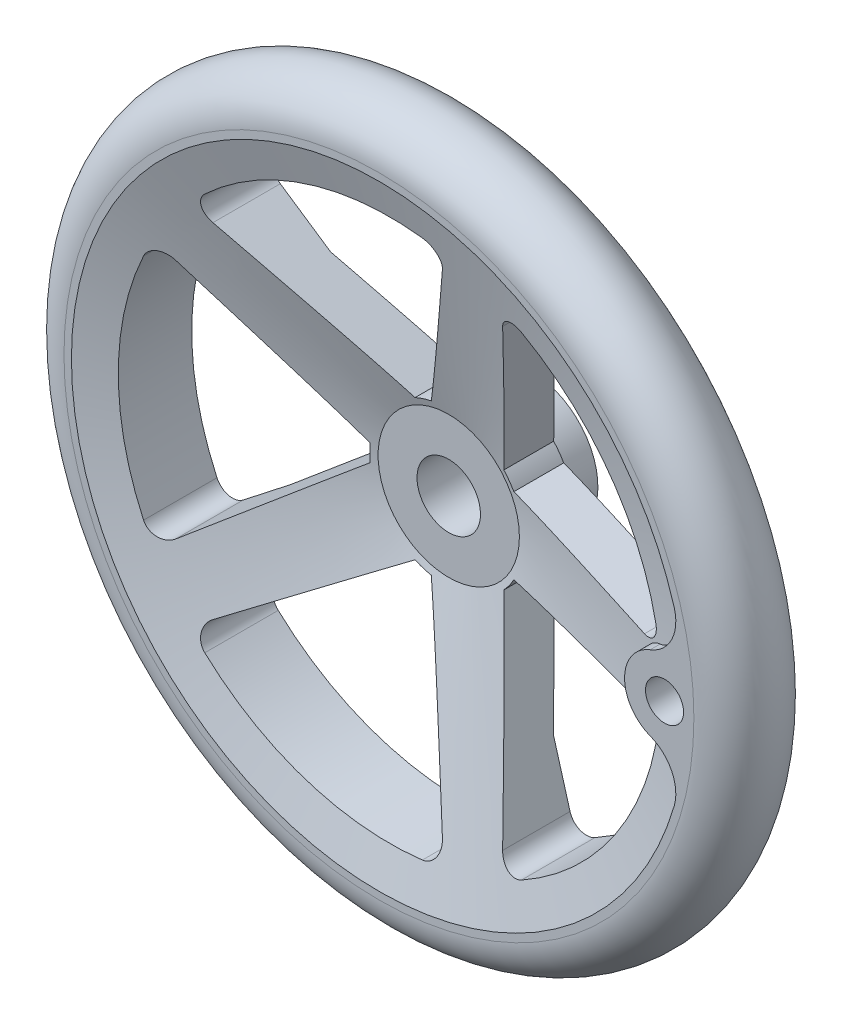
ISO-10303-21;
HEADER;
FILE_DESCRIPTION(('STEP AP214'),'2;1');
FILE_NAME('part.step','',(''),(''),'','','');
FILE_SCHEMA(('AUTOMOTIVE_DESIGN { 1 0 10303 214 1 1 1 1 }'));
ENDSEC;
DATA;
#1=APPLICATION_CONTEXT('core data for automotive mechanical design processes');
#2=APPLICATION_PROTOCOL_DEFINITION('international standard','automotive_design',2000,#1);
#3=PRODUCT_CONTEXT('',#1,'mechanical');
#4=PRODUCT('Part','Part','',(#3));
#5=PRODUCT_RELATED_PRODUCT_CATEGORY('part','',(#4));
#6=PRODUCT_DEFINITION_FORMATION('','',#4);
#7=PRODUCT_DEFINITION_CONTEXT('part definition',#1,'design');
#8=PRODUCT_DEFINITION('design','',#6,#7);
#9=PRODUCT_DEFINITION_SHAPE('','',#8);
#10=(LENGTH_UNIT() NAMED_UNIT(*) SI_UNIT(.MILLI.,.METRE.));
#11=(NAMED_UNIT(*) PLANE_ANGLE_UNIT() SI_UNIT($,.RADIAN.));
#12=(NAMED_UNIT(*) SI_UNIT($,.STERADIAN.) SOLID_ANGLE_UNIT());
#13=UNCERTAINTY_MEASURE_WITH_UNIT(LENGTH_MEASURE(1.E-05),#10,'distance_accuracy_value','');
#14=(GEOMETRIC_REPRESENTATION_CONTEXT(3) GLOBAL_UNCERTAINTY_ASSIGNED_CONTEXT((#13)) GLOBAL_UNIT_ASSIGNED_CONTEXT((#10,
#11,#12)) REPRESENTATION_CONTEXT('',''));
#15=CARTESIAN_POINT('',(0.,0.,0.));
#16=DIRECTION('',(0.,0.,1.));
#17=DIRECTION('',(1.,0.,0.));
#18=AXIS2_PLACEMENT_3D('',#15,#16,#17);
#19=CARTESIAN_POINT('',(-21.325127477,21.251999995,0.));
#20=DIRECTION('',(0.,0.,1.));
#21=DIRECTION('',(0.,-1.,0.));
#22=AXIS2_PLACEMENT_3D('',#19,#20,#21);
#23=PLANE('',#22);
#24=CARTESIAN_POINT('',(0.,0.,0.));
#25=DIRECTION('',(0.,0.,1.));
#26=DIRECTION('',(0.,-1.,0.));
#27=AXIS2_PLACEMENT_3D('',#24,#25,#26);
#28=CIRCLE('',#27,10.);
#29=CARTESIAN_POINT('',(0.,-10.,0.));
#30=VERTEX_POINT('',#29);
#31=EDGE_CURVE('E840',#30,#30,#28,.T.);
#32=ORIENTED_EDGE('',*,*,#31,.T.);
#33=EDGE_LOOP('',(#32));
#34=FACE_BOUND('',#33,.T.);
#35=CARTESIAN_POINT('',(0.,0.,0.));
#36=DIRECTION('',(0.,0.,-1.));
#37=DIRECTION('',(0.,1.,0.));
#38=AXIS2_PLACEMENT_3D('',#35,#36,#37);
#39=CIRCLE('',#38,20.999999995);
#40=CARTESIAN_POINT('',(0.,20.999999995,0.));
#41=VERTEX_POINT('',#40);
#42=EDGE_CURVE('E19',#41,#41,#39,.F.);
#43=ORIENTED_EDGE('',*,*,#42,.F.);
#44=EDGE_LOOP('',(#43));
#45=FACE_BOUND('',#44,.T.);
#46=ADVANCED_FACE('F15',(#34,#45),#23,.F.);
#47=CARTESIAN_POINT('',(0.,0.,8.578933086));
#48=DIRECTION('',(0.,0.,-1.));
#49=DIRECTION('',(0.,1.,0.));
#50=AXIS2_PLACEMENT_3D('',#47,#48,#49);
#51=CYLINDRICAL_SURFACE('',#50,20.999999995);
#52=ORIENTED_EDGE('',*,*,#42,.T.);
#53=EDGE_LOOP('',(#52));
#54=FACE_BOUND('',#53,.T.);
#55=CARTESIAN_POINT('',(0.,0.,8.578933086));
#56=DIRECTION('',(0.,0.,-1.));
#57=DIRECTION('',(0.,1.,0.));
#58=AXIS2_PLACEMENT_3D('',#55,#56,#57);
#59=CIRCLE('',#58,20.999999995);
#60=CARTESIAN_POINT('',(0.,20.999999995,8.578933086));
#61=VERTEX_POINT('',#60);
#62=CARTESIAN_POINT('',(-2.15358599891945E-09,-20.999999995,8.578933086));
#63=VERTEX_POINT('',#62);
#64=EDGE_CURVE('E793',#61,#63,#59,.T.);
#65=ORIENTED_EDGE('',*,*,#64,.T.);
#66=CARTESIAN_POINT('',(0.,0.,8.578933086));
#67=DIRECTION('',(0.,0.,-1.));
#68=DIRECTION('',(0.,1.,0.));
#69=AXIS2_PLACEMENT_3D('',#66,#67,#68);
#70=CIRCLE('',#69,20.999999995);
#71=EDGE_CURVE('E794',#63,#61,#70,.T.);
#72=ORIENTED_EDGE('',*,*,#71,.T.);
#73=EDGE_LOOP('',(#65,#72));
#74=FACE_BOUND('',#73,.T.);
#75=ADVANCED_FACE('F848',(#54,#74),#51,.T.);
#76=CARTESIAN_POINT('',(0.,0.,0.));
#77=DIRECTION('',(0.,0.,1.));
#78=DIRECTION('',(0.,-1.,0.));
#79=AXIS2_PLACEMENT_3D('',#76,#77,#78);
#80=CYLINDRICAL_SURFACE('',#79,10.);
#81=CARTESIAN_POINT('',(0.,0.,26.));
#82=DIRECTION('',(0.,0.,1.));
#83=DIRECTION('',(0.,-1.,0.));
#84=AXIS2_PLACEMENT_3D('',#81,#82,#83);
#85=CIRCLE('',#84,10.);
#86=CARTESIAN_POINT('',(0.,-10.,26.));
#87=VERTEX_POINT('',#86);
#88=EDGE_CURVE('E836',#87,#87,#85,.T.);
#89=ORIENTED_EDGE('',*,*,#88,.T.);
#90=EDGE_LOOP('',(#89));
#91=FACE_BOUND('',#90,.T.);
#92=ORIENTED_EDGE('',*,*,#31,.F.);
#93=EDGE_LOOP('',(#92));
#94=FACE_BOUND('',#93,.T.);
#95=ADVANCED_FACE('F864',(#91,#94),#80,.F.);
#96=CARTESIAN_POINT('',(0.,-22.291109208,10.30549909));
#97=CARTESIAN_POINT('',(-44.582218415,-22.291109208,10.30549909));
#98=CARTESIAN_POINT('',(-44.582218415,22.291109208,10.30549909));
#99=CARTESIAN_POINT('',(0.,22.291109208,10.30549909));
#100=CARTESIAN_POINT('',(0.,-21.496256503,10.07122295));
#101=CARTESIAN_POINT('',(-42.992513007,-21.496256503,10.07122295));
#102=CARTESIAN_POINT('',(-42.992513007,21.496256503,10.07122295));
#103=CARTESIAN_POINT('',(0.,21.496256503,10.07122295));
#104=CARTESIAN_POINT('',(0.,-20.999999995,9.407592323));
#105=CARTESIAN_POINT('',(-41.99999999,-20.999999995,9.407592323));
#106=CARTESIAN_POINT('',(-41.99999999,20.999999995,9.407592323));
#107=CARTESIAN_POINT('',(0.,20.999999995,9.407592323));
#108=CARTESIAN_POINT('',(0.,-20.999999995,8.578933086));
#109=CARTESIAN_POINT('',(-41.99999999,-20.999999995,8.57893308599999));
#110=CARTESIAN_POINT('',(-41.99999999,20.999999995,8.57893308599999));
#111=CARTESIAN_POINT('',(0.,20.999999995,8.578933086));
#112=(BOUNDED_SURFACE() B_SPLINE_SURFACE(3,3,((#96,#97,#98,#99),(#100,#101,#102,#103),(#104,
#105,#106,#107),(#108,#109,#110,#111)),.UNSPECIFIED.,.F.,.F.,
.F.) B_SPLINE_SURFACE_WITH_KNOTS((4,4),(4,4),(0.,1.),(0.,1.),
.UNSPECIFIED.) GEOMETRIC_REPRESENTATION_ITEM() RATIONAL_B_SPLINE_SURFACE(((1.,0.333333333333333,
0.333333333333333,1.),(0.867232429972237,0.289077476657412,0.289077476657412,0.867232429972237),
(0.867232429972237,0.289077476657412,0.289077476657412,0.867232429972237),(1.,0.333333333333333,
0.333333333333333,1.))) REPRESENTATION_ITEM('') SURFACE());
#113=CARTESIAN_POINT('',(0.,-22.291109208,10.30549909));
#114=CARTESIAN_POINT('',(0.,-21.496256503,10.07122295));
#115=CARTESIAN_POINT('',(0.,-20.999999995,9.407592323));
#116=CARTESIAN_POINT('',(0.,-20.999999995,8.578933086));
#117=(BOUNDED_CURVE() B_SPLINE_CURVE(3,(#113,#114,#115,#116),.UNSPECIFIED.,.F.,
.F.) B_SPLINE_CURVE_WITH_KNOTS((4,4),(0.,1.),
.UNSPECIFIED.) CURVE() GEOMETRIC_REPRESENTATION_ITEM() RATIONAL_B_SPLINE_CURVE((1.,
0.867232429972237,0.867232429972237,1.)) REPRESENTATION_ITEM(''));
#118=CARTESIAN_POINT('',(-1.00079978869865E-09,-22.291109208,10.30549909));
#119=VERTEX_POINT('',#118);
#120=EDGE_CURVE('E763',#63,#119,#117,.F.);
#121=CARTESIAN_POINT('',(0.,0.,10.30549909));
#122=DIRECTION('',(0.,0.,1.));
#123=DIRECTION('',(0.,-1.,0.));
#124=AXIS2_PLACEMENT_3D('',#121,#122,#123);
#125=CIRCLE('',#124,22.291109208);
#126=CARTESIAN_POINT('',(-6.85797438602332E-09,22.291109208,10.30549909));
#127=VERTEX_POINT('',#126);
#128=EDGE_CURVE('E775',#127,#119,#125,.T.);
#129=CARTESIAN_POINT('',(0.,22.291109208,10.30549909));
#130=CARTESIAN_POINT('',(0.,21.496256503,10.07122295));
#131=CARTESIAN_POINT('',(0.,20.999999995,9.407592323));
#132=CARTESIAN_POINT('',(0.,20.999999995,8.578933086));
#133=(BOUNDED_CURVE() B_SPLINE_CURVE(3,(#129,#130,#131,#132),.UNSPECIFIED.,.F.,
.F.) B_SPLINE_CURVE_WITH_KNOTS((4,4),(0.,1.),
.UNSPECIFIED.) CURVE() GEOMETRIC_REPRESENTATION_ITEM() RATIONAL_B_SPLINE_CURVE((1.,
0.867232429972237,0.867232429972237,1.)) REPRESENTATION_ITEM(''));
#134=EDGE_CURVE('E789',#127,#61,#133,.T.);
#135=ORIENTED_EDGE('',*,*,#120,.T.);
#136=ORIENTED_EDGE('',*,*,#128,.F.);
#137=ORIENTED_EDGE('',*,*,#134,.T.);
#138=ORIENTED_EDGE('',*,*,#71,.F.);
#139=EDGE_LOOP('',(#135,#136,#137,#138));
#140=FACE_BOUND('',#139,.T.);
#141=ADVANCED_FACE('F858',(#140),#112,.F.);
#142=CARTESIAN_POINT('',(0.,0.,10.897602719));
#143=DIRECTION('',(0.,0.,1.));
#144=DIRECTION('',(0.,-1.,0.));
#145=AXIS2_PLACEMENT_3D('',#142,#143,#144);
#146=CYLINDRICAL_SURFACE('',#145,24.299999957);
#147=DIRECTION('',(0.,0.,-1.));
#148=VECTOR('',#147,1.);
#149=CARTESIAN_POINT('',(-10.017686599,-22.139014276,26.817848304));
#150=LINE('',#149,#148);
#151=CARTESIAN_POINT('',(-10.0176865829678,-22.1390142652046,26.6009067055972));
#152=VERTEX_POINT('',#151);
#153=CARTESIAN_POINT('',(-10.017686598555,-22.1390142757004,10.8976027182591));
#154=VERTEX_POINT('',#153);
#155=EDGE_CURVE('E1027',#152,#154,#150,.T.);
#156=ORIENTED_EDGE('',*,*,#155,.T.);
#157=CARTESIAN_POINT('',(0.,0.,10.8976027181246));
#158=DIRECTION('',(0.,0.,1.));
#159=DIRECTION('',(0.,-1.,0.));
#160=AXIS2_PLACEMENT_3D('',#157,#158,#159);
#161=CIRCLE('',#160,24.2999999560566);
#162=CARTESIAN_POINT('',(-4.90850734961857,-23.7990872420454,10.8976027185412));
#163=VERTEX_POINT('',#162);
#164=EDGE_CURVE('E779',#163,#154,#161,.F.);
#165=ORIENTED_EDGE('',*,*,#164,.F.);
#166=DIRECTION('',(0.,0.,1.));
#167=VECTOR('',#166,1.);
#168=CARTESIAN_POINT('',(-4.90850735,-23.799087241,26.8178484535));
#169=LINE('',#168,#167);
#170=CARTESIAN_POINT('',(-4.90850735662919,-23.7990872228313,26.6009067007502));
#171=VERTEX_POINT('',#170);
#172=EDGE_CURVE('E1015',#163,#171,#169,.T.);
#173=ORIENTED_EDGE('',*,*,#172,.T.);
#174=CARTESIAN_POINT('',(0.,0.,26.6009067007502));
#175=DIRECTION('',(0.,0.,1.));
#176=DIRECTION('',(0.,-1.,0.));
#177=AXIS2_PLACEMENT_3D('',#174,#175,#176);
#178=CIRCLE('',#177,24.2999999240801);
#179=EDGE_CURVE('E821',#171,#152,#178,.F.);
#180=ORIENTED_EDGE('',*,*,#179,.T.);
#181=EDGE_LOOP('',(#156,#165,#173,#180));
#182=FACE_BOUND('',#181,.T.);
#183=ADVANCED_FACE('F863',(#182),#146,.T.);
#184=CARTESIAN_POINT('',(0.,0.,10.897602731));
#185=DIRECTION('',(0.,0.,1.));
#186=DIRECTION('',(0.,-1.,0.));
#187=AXIS2_PLACEMENT_3D('',#184,#185,#186);
#188=CYLINDRICAL_SURFACE('',#187,24.3);
#189=DIRECTION('',(0.,0.,-1.));
#190=VECTOR('',#189,1.);
#191=CARTESIAN_POINT('',(-24.151089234,2.686054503,26.817848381));
#192=LINE('',#191,#190);
#193=CARTESIAN_POINT('',(-24.1510892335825,2.68605450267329,26.6009067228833));
#194=VERTEX_POINT('',#193);
#195=CARTESIAN_POINT('',(-24.1510892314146,2.68605450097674,10.8976027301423));
#196=VERTEX_POINT('',#195);
#197=EDGE_CURVE('E780',#194,#196,#192,.T.);
#198=ORIENTED_EDGE('',*,*,#197,.T.);
#199=CARTESIAN_POINT('',(0.,0.,10.8976027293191));
#200=DIRECTION('',(0.,0.,1.));
#201=DIRECTION('',(0.,-1.,0.));
#202=AXIS2_PLACEMENT_3D('',#199,#200,#201);
#203=CIRCLE('',#202,24.2999999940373);
#204=CARTESIAN_POINT('',(-24.1510892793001,-2.68605408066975,10.8976027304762));
#205=VERTEX_POINT('',#204);
#206=EDGE_CURVE('E416',#205,#196,#203,.F.);
#207=ORIENTED_EDGE('',*,*,#206,.F.);
#208=DIRECTION('',(0.,0.,1.));
#209=VECTOR('',#208,1.);
#210=CARTESIAN_POINT('',(-24.151089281,-2.686054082,26.817848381));
#211=LINE('',#210,#209);
#212=CARTESIAN_POINT('',(-24.1510892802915,-2.68605408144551,26.6009067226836));
#213=VERTEX_POINT('',#212);
#214=EDGE_CURVE('E388',#205,#213,#211,.T.);
#215=ORIENTED_EDGE('',*,*,#214,.T.);
#216=CARTESIAN_POINT('',(0.,0.,26.6009067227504));
#217=DIRECTION('',(0.,0.,1.));
#218=DIRECTION('',(0.,-1.,0.));
#219=AXIS2_PLACEMENT_3D('',#216,#217,#218);
#220=CIRCLE('',#219,24.2999999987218);
#221=EDGE_CURVE('E820',#213,#194,#220,.F.);
#222=ORIENTED_EDGE('',*,*,#221,.T.);
#223=EDGE_LOOP('',(#198,#207,#215,#222));
#224=FACE_BOUND('',#223,.T.);
#225=ADVANCED_FACE('F870',(#224),#188,.T.);
#226=CARTESIAN_POINT('',(0.,0.,10.897602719));
#227=DIRECTION('',(0.,0.,1.));
#228=DIRECTION('',(0.,-1.,0.));
#229=AXIS2_PLACEMENT_3D('',#226,#227,#228);
#230=CYLINDRICAL_SURFACE('',#229,24.299999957);
#231=DIRECTION('',(0.,0.,-1.));
#232=VECTOR('',#231,1.);
#233=CARTESIAN_POINT('',(-4.90850735,23.799087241,26.8178484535));
#234=LINE('',#233,#232);
#235=CARTESIAN_POINT('',(-4.90850735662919,23.7990872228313,26.6009067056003));
#236=VERTEX_POINT('',#235);
#237=CARTESIAN_POINT('',(-4.90850734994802,23.7990872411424,10.8976027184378));
#238=VERTEX_POINT('',#237);
#239=EDGE_CURVE('E1049',#236,#238,#234,.T.);
#240=ORIENTED_EDGE('',*,*,#239,.T.);
#241=CARTESIAN_POINT('',(0.,0.,10.8976027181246));
#242=DIRECTION('',(0.,0.,1.));
#243=DIRECTION('',(0.,-1.,0.));
#244=AXIS2_PLACEMENT_3D('',#241,#242,#243);
#245=CIRCLE('',#244,24.2999999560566);
#246=CARTESIAN_POINT('',(-10.017686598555,22.1390142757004,10.8976027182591));
#247=VERTEX_POINT('',#246);
#248=EDGE_CURVE('E809',#247,#238,#245,.F.);
#249=ORIENTED_EDGE('',*,*,#248,.F.);
#250=DIRECTION('',(0.,0.,1.));
#251=VECTOR('',#250,1.);
#252=CARTESIAN_POINT('',(-10.017686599,22.139014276,26.817848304));
#253=LINE('',#252,#251);
#254=CARTESIAN_POINT('',(-10.0176865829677,22.1390142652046,26.6009067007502));
#255=VERTEX_POINT('',#254);
#256=EDGE_CURVE('E1045',#247,#255,#253,.T.);
#257=ORIENTED_EDGE('',*,*,#256,.T.);
#258=CARTESIAN_POINT('',(0.,0.,26.6009067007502));
#259=DIRECTION('',(0.,0.,1.));
#260=DIRECTION('',(0.,-1.,0.));
#261=AXIS2_PLACEMENT_3D('',#258,#259,#260);
#262=CIRCLE('',#261,24.2999999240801);
#263=EDGE_CURVE('E816',#255,#236,#262,.F.);
#264=ORIENTED_EDGE('',*,*,#263,.T.);
#265=EDGE_LOOP('',(#240,#249,#257,#264));
#266=FACE_BOUND('',#265,.T.);
#267=ADVANCED_FACE('F886',(#266),#230,.T.);
#268=CARTESIAN_POINT('',(0.,22.291109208,10.30549909));
#269=CARTESIAN_POINT('',(44.582218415,22.291109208,10.30549909));
#270=CARTESIAN_POINT('',(44.582218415,-22.291109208,10.30549909));
#271=CARTESIAN_POINT('',(0.,-22.291109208,10.30549909));
#272=CARTESIAN_POINT('',(0.,21.496256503,10.07122295));
#273=CARTESIAN_POINT('',(42.992513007,21.496256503,10.07122295));
#274=CARTESIAN_POINT('',(42.992513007,-21.496256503,10.07122295));
#275=CARTESIAN_POINT('',(0.,-21.496256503,10.07122295));
#276=CARTESIAN_POINT('',(0.,20.999999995,9.407592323));
#277=CARTESIAN_POINT('',(41.99999999,20.999999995,9.407592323));
#278=CARTESIAN_POINT('',(41.99999999,-20.999999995,9.407592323));
#279=CARTESIAN_POINT('',(0.,-20.999999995,9.407592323));
#280=CARTESIAN_POINT('',(0.,20.999999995,8.578933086));
#281=CARTESIAN_POINT('',(41.99999999,20.999999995,8.57893308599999));
#282=CARTESIAN_POINT('',(41.99999999,-20.999999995,8.57893308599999));
#283=CARTESIAN_POINT('',(0.,-20.999999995,8.578933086));
#284=(BOUNDED_SURFACE() B_SPLINE_SURFACE(3,3,((#268,#269,#270,#271),(#272,#273,#274,#275),(#276,
#277,#278,#279),(#280,#281,#282,#283)),.UNSPECIFIED.,.F.,.F.,
.F.) B_SPLINE_SURFACE_WITH_KNOTS((4,4),(4,4),(0.,1.),(0.,1.),
.UNSPECIFIED.) GEOMETRIC_REPRESENTATION_ITEM() RATIONAL_B_SPLINE_SURFACE(((1.,0.333333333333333,
0.333333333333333,1.),(0.867232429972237,0.289077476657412,0.289077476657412,0.867232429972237),
(0.867232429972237,0.289077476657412,0.289077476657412,0.867232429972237),(1.,0.333333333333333,
0.333333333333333,1.))) REPRESENTATION_ITEM('') SURFACE());
#285=CARTESIAN_POINT('',(0.,0.,10.30549909));
#286=DIRECTION('',(0.,0.,1.));
#287=DIRECTION('',(0.,-1.,0.));
#288=AXIS2_PLACEMENT_3D('',#285,#286,#287);
#289=CIRCLE('',#288,22.291109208);
#290=EDGE_CURVE('E728',#119,#127,#289,.T.);
#291=ORIENTED_EDGE('',*,*,#64,.F.);
#292=ORIENTED_EDGE('',*,*,#134,.F.);
#293=ORIENTED_EDGE('',*,*,#290,.F.);
#294=ORIENTED_EDGE('',*,*,#120,.F.);
#295=EDGE_LOOP('',(#291,#292,#293,#294));
#296=FACE_BOUND('',#295,.T.);
#297=ADVANCED_FACE('F854',(#296),#284,.F.);
#298=CARTESIAN_POINT('',(80.955203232,23.520877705,44.851045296));
#299=DIRECTION('',(0.,0.,1.));
#300=DIRECTION('',(0.,-1.,0.));
#301=AXIS2_PLACEMENT_3D('',#298,#299,#300);
#302=CYLINDRICAL_SURFACE('',#301,12.6);
#303=CARTESIAN_POINT('',(93.05485395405,27.0363333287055,47.9999966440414));
#304=CARTESIAN_POINT('',(93.1514522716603,26.7040151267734,48.0000043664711));
#305=CARTESIAN_POINT('',(93.2342741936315,26.3677037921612,47.9963404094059));
#306=CARTESIAN_POINT('',(93.3719678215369,25.6895980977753,47.9817284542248));
#307=CARTESIAN_POINT('',(93.4268424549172,25.3478043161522,47.9707812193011));
#308=CARTESIAN_POINT('',(93.5082023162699,24.6616905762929,47.9416842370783));
#309=CARTESIAN_POINT('',(93.5347307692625,24.3173752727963,47.9235455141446));
#310=CARTESIAN_POINT('',(93.5594631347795,23.6281777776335,47.8801803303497));
#311=CARTESIAN_POINT('',(93.5576670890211,23.2832955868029,47.8549538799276));
#312=CARTESIAN_POINT('',(93.5258833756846,22.5953514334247,47.7975618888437));
#313=CARTESIAN_POINT('',(93.4958904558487,22.252289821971,47.7653950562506));
#314=CARTESIAN_POINT('',(93.4080742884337,21.5704526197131,47.6943197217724));
#315=CARTESIAN_POINT('',(93.3502505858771,21.2316770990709,47.6554111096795));
#316=CARTESIAN_POINT('',(93.2073600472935,20.5607615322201,47.5710862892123));
#317=CARTESIAN_POINT('',(93.1222940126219,20.2286212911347,47.5256702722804));
#318=CARTESIAN_POINT('',(92.925706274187,19.5732056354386,47.4285969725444));
#319=CARTESIAN_POINT('',(92.8141844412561,19.2499302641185,47.3769396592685));
#320=CARTESIAN_POINT('',(92.5641109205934,18.6104195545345,47.2670027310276));
#321=CARTESIAN_POINT('',(92.4252405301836,18.2943216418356,47.2086487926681));
#322=CARTESIAN_POINT('',(92.1225587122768,17.6754669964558,47.0861886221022));
#323=CARTESIAN_POINT('',(91.9587469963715,17.3727104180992,47.0220823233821));
#324=CARTESIAN_POINT('',(91.6074572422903,16.7823688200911,46.8884609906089));
#325=CARTESIAN_POINT('',(91.4199711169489,16.4947890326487,46.8189441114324));
#326=CARTESIAN_POINT('',(91.022847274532,15.936693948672,46.6749123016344));
#327=CARTESIAN_POINT('',(90.813209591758,15.6661786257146,46.6003973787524));
#328=CARTESIAN_POINT('',(90.3667339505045,15.1359633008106,46.444466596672));
#329=CARTESIAN_POINT('',(90.1292672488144,14.8768338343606,46.3629105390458));
#330=CARTESIAN_POINT('',(89.6343225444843,14.37998848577,46.1954002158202));
#331=CARTESIAN_POINT('',(89.376843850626,14.1422733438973,46.1094457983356));
#332=CARTESIAN_POINT('',(88.8439354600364,13.6898038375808,45.9336793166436));
#333=CARTESIAN_POINT('',(88.5685155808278,13.4750370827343,45.8438693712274));
#334=CARTESIAN_POINT('',(88.0016646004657,13.0696201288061,45.6608871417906));
#335=CARTESIAN_POINT('',(87.7102384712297,12.878962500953,45.5677159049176));
#336=CARTESIAN_POINT('',(87.1026434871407,12.5164011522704,45.37512722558));
#337=CARTESIAN_POINT('',(86.7859626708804,12.3454104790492,45.2756055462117));
#338=CARTESIAN_POINT('',(86.1404483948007,12.0316666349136,45.0743021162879));
#339=CARTESIAN_POINT('',(85.8116407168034,11.8888572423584,44.9725253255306));
#340=CARTESIAN_POINT('',(85.4776011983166,11.7604390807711,44.8698263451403));
#341=B_SPLINE_CURVE_WITH_KNOTS('',3,(#303,#304,#305,#306,#307,#308,#309,#310,#311,#312,#313,
#314,#315,#316,#317,#318,#319,#320,#321,#322,#323,#324,#325,#326,#327,#328,#329,#330,#331,#332,
#333,#334,#335,#336,#337,#338,#339,#340),.UNSPECIFIED.,.F.,.F.,(4,2,2,2,2,2,2,2,2,2,2,2,2,2,2,2,
2,2,4),(0.,1.03789117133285,2.07567360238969,3.1118712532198,4.14806737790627,5.18445655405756,
6.22086267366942,7.25723830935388,8.29361900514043,9.34287987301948,10.3921528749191,
11.4417852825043,12.4914160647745,13.5726370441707,14.6538953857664,15.7345669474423,
16.8149047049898,17.9338286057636,19.0504971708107),.UNSPECIFIED.);
#342=CARTESIAN_POINT('',(93.0548588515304,27.0363347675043,47.999998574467));
#343=VERTEX_POINT('',#342);
#344=CARTESIAN_POINT('',(85.4776011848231,11.7604390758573,44.8698263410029));
#345=VERTEX_POINT('',#344);
#346=EDGE_CURVE('E286',#343,#345,#341,.T.);
#347=ORIENTED_EDGE('',*,*,#346,.T.);
#348=DIRECTION('',(0.,0.,-1.));
#349=VECTOR('',#348,1.);
#350=CARTESIAN_POINT('',(85.4776011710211,11.7604390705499,45.0985605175));
#351=LINE('',#350,#349);
#352=CARTESIAN_POINT('',(85.4776011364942,11.7604390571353,48.));
#353=VERTEX_POINT('',#352);
#354=EDGE_CURVE('E760',#353,#345,#351,.T.);
#355=ORIENTED_EDGE('',*,*,#354,.F.);
#356=CARTESIAN_POINT('',(80.955203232,23.520877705,48.));
#357=DIRECTION('',(0.,0.,1.));
#358=DIRECTION('',(0.,-1.,0.));
#359=AXIS2_PLACEMENT_3D('',#356,#357,#358);
#360=CIRCLE('',#359,12.6);
#361=EDGE_CURVE('E1459',#353,#343,#360,.T.);
#362=ORIENTED_EDGE('',*,*,#361,.T.);
#363=EDGE_LOOP('',(#347,#355,#362));
#364=FACE_BOUND('',#363,.T.);
#365=ADVANCED_FACE('F894',(#364),#302,.F.);
#366=CARTESIAN_POINT('',(89.999999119,0.,42.2168418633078));
#367=DIRECTION('',(0.,0.,1.));
#368=DIRECTION('',(0.,-1.,0.));
#369=AXIS2_PLACEMENT_3D('',#366,#367,#368);
#370=CYLINDRICAL_SURFACE('',#369,12.60000041);
#371=DIRECTION('',(0.,0.,1.));
#372=VECTOR('',#371,1.);
#373=CARTESIAN_POINT('',(85.4776012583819,-11.7604391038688,46.4255226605));
#374=LINE('',#373,#372);
#375=CARTESIAN_POINT('',(85.4776012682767,-11.7604391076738,44.8698263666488));
#376=VERTEX_POINT('',#375);
#377=CARTESIAN_POINT('',(85.4776011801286,-11.7604390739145,48.));
#378=VERTEX_POINT('',#377);
#379=EDGE_CURVE('E275',#376,#378,#374,.T.);
#380=ORIENTED_EDGE('',*,*,#379,.T.);
#381=CARTESIAN_POINT('',(89.999999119,0.,48.));
#382=DIRECTION('',(0.,0.,1.));
#383=DIRECTION('',(0.,-1.,0.));
#384=AXIS2_PLACEMENT_3D('',#381,#382,#383);
#385=CIRCLE('',#384,12.60000041);
#386=EDGE_CURVE('E271',#378,#353,#385,.F.);
#387=ORIENTED_EDGE('',*,*,#386,.T.);
#388=ORIENTED_EDGE('',*,*,#354,.T.);
#389=CARTESIAN_POINT('',(85.4776012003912,11.7604390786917,44.8698263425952));
#390=CARTESIAN_POINT('',(85.1429246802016,11.6317718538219,44.7669400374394));
#391=CARTESIAN_POINT('',(84.8134872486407,11.4886615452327,44.6650273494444));
#392=CARTESIAN_POINT('',(84.1673070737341,11.1744623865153,44.4639485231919));
#393=CARTESIAN_POINT('',(83.8505660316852,11.0033698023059,44.3647827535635));
#394=CARTESIAN_POINT('',(83.2316645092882,10.6338971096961,44.1698923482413));
#395=CARTESIAN_POINT('',(82.9295244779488,10.4354801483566,44.0741725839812));
#396=CARTESIAN_POINT('',(82.342536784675,10.0126961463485,43.8871710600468));
#397=CARTESIAN_POINT('',(82.0576881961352,9.78833049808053,43.795889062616));
#398=CARTESIAN_POINT('',(81.5070629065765,9.31461935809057,43.6184958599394));
#399=CARTESIAN_POINT('',(81.2413145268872,9.06523803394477,43.5323923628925));
#400=CARTESIAN_POINT('',(80.7315130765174,8.54331557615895,43.3663872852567));
#401=CARTESIAN_POINT('',(80.4874591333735,8.27077537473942,43.2864854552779));
#402=CARTESIAN_POINT('',(80.023300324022,7.70450594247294,43.133821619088));
#403=CARTESIAN_POINT('',(79.8031771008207,7.41079324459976,43.0610541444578));
#404=CARTESIAN_POINT('',(79.3886531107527,6.80399429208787,42.9234542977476));
#405=CARTESIAN_POINT('',(79.1942512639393,6.4909088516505,42.8586215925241));
#406=CARTESIAN_POINT('',(78.8391337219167,5.85850810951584,42.7397621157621));
#407=CARTESIAN_POINT('',(78.6775000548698,5.53976302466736,42.6854437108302));
#408=CARTESIAN_POINT('',(78.3814682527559,4.88852480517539,42.5856659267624));
#409=CARTESIAN_POINT('',(78.247069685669,4.55603188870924,42.540206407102));
#410=CARTESIAN_POINT('',(78.0068248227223,3.87976084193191,42.4587538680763));
#411=CARTESIAN_POINT('',(77.9009780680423,3.53598289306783,42.4227606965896));
#412=CARTESIAN_POINT('',(77.7189144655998,2.83979056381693,42.3607442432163));
#413=CARTESIAN_POINT('',(77.6426964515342,2.48737652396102,42.334720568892));
#414=CARTESIAN_POINT('',(77.5236671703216,1.79408838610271,42.2940373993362));
#415=CARTESIAN_POINT('',(77.4794060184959,1.45349139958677,42.2788849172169));
#416=CARTESIAN_POINT('',(77.4188355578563,0.769536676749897,42.258141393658));
#417=CARTESIAN_POINT('',(77.4025252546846,0.426179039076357,42.2525500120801));
#418=CARTESIAN_POINT('',(77.3980157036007,-0.260667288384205,42.2510044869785));
#419=CARTESIAN_POINT('',(77.4098104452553,-0.604155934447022,42.255048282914));
#420=CARTESIAN_POINT('',(77.4613826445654,-1.28877648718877,42.2727137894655));
#421=CARTESIAN_POINT('',(77.5011599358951,-1.6299084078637,42.2863354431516));
#422=CARTESIAN_POINT('',(77.607083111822,-2.29954777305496,42.3225535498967));
#423=CARTESIAN_POINT('',(77.6726057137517,-2.62816557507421,42.3449378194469));
#424=CARTESIAN_POINT('',(77.8293983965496,-3.27846841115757,42.3983930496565));
#425=CARTESIAN_POINT('',(77.920667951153,-3.60015358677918,42.4294638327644));
#426=CARTESIAN_POINT('',(78.1281434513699,-4.23442939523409,42.4999125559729));
#427=CARTESIAN_POINT('',(78.2443488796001,-4.54702021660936,42.5392903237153));
#428=CARTESIAN_POINT('',(78.5007032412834,-5.16109610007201,42.6258925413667));
#429=CARTESIAN_POINT('',(78.6408526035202,-5.46258096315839,42.6731171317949));
#430=CARTESIAN_POINT('',(78.9465829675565,-6.05771023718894,42.7757724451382));
#431=CARTESIAN_POINT('',(79.1125642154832,-6.35112679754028,42.8313317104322));
#432=CARTESIAN_POINT('',(79.4667707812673,-6.92272824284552,42.9494201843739));
#433=CARTESIAN_POINT('',(79.6549964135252,-7.2009129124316,43.0119494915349));
#434=CARTESIAN_POINT('',(80.0523354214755,-7.74056397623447,43.1433684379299));
#435=CARTESIAN_POINT('',(80.2614593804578,-8.00202178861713,43.2122612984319));
#436=CARTESIAN_POINT('',(80.69896885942,-8.50660673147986,43.3557143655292));
#437=CARTESIAN_POINT('',(80.9273543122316,-8.74973392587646,43.4302745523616));
#438=CARTESIAN_POINT('',(81.4126487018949,-9.22705225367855,43.5879189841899));
#439=CARTESIAN_POINT('',(81.6703845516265,-9.46032572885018,43.6712371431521));
#440=CARTESIAN_POINT('',(82.2032955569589,-9.90412378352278,43.8425729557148));
#441=CARTESIAN_POINT('',(82.47847138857,-10.1146474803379,43.9305907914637));
#442=CARTESIAN_POINT('',(83.0439722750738,-10.5115604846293,44.1104544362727));
#443=CARTESIAN_POINT('',(83.3342784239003,-10.6979789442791,44.2022954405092));
#444=CARTESIAN_POINT('',(83.9283005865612,-11.0459441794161,44.389138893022));
#445=CARTESIAN_POINT('',(84.232010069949,-11.2075028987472,44.4841397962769));
#446=CARTESIAN_POINT('',(84.694902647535,-11.4300036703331,44.6280899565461));
#447=CARTESIAN_POINT('',(84.8497891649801,-11.5006215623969,44.6761203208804));
#448=CARTESIAN_POINT('',(85.1619240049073,-11.6353721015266,44.772634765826));
#449=CARTESIAN_POINT('',(85.3191684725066,-11.6995142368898,44.8211180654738));
#450=CARTESIAN_POINT('',(85.4776012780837,-11.7604391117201,44.8698263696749));
#451=B_SPLINE_CURVE_WITH_KNOTS('',3,(#389,#390,#391,#392,#393,#394,#395,#396,#397,#398,#399,
#400,#401,#402,#403,#404,#405,#406,#407,#408,#409,#410,#411,#412,#413,#414,#415,#416,#417,#418,
#419,#420,#421,#422,#423,#424,#425,#426,#427,#428,#429,#430,#431,#432,#433,#434,#435,#436,#437,
#438,#439,#440,#441,#442,#443,#444,#445,#446,#447,#448,#449,#450),.UNSPECIFIED.,.F.,.F.,(4,2,2,
2,2,2,2,2,2,2,2,2,2,2,2,2,2,2,2,2,2,2,2,2,2,2,2,2,2,2,4),(0.,1.11878650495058,2.23772242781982,
3.35818253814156,4.47858255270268,5.6006109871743,6.7225942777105,7.84371074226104,
8.96478012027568,10.0478769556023,11.1309566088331,12.2140188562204,13.2970384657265,
14.3271589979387,15.3572428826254,16.3871064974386,17.4169639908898,18.4232895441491,
19.4295945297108,20.4358786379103,21.4421807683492,22.4660007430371,23.4898351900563,
24.5141907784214,25.5385427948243,26.6097573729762,27.6810134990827,28.7509617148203,
29.8203942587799,30.3508936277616,30.8806040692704),.UNSPECIFIED.);
#452=EDGE_CURVE('E293',#345,#376,#451,.T.);
#453=ORIENTED_EDGE('',*,*,#452,.T.);
#454=EDGE_LOOP('',(#380,#387,#388,#453));
#455=FACE_BOUND('',#454,.T.);
#456=ADVANCED_FACE('F317',(#455),#370,.T.);
#457=CARTESIAN_POINT('',(80.955203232,-23.520877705,44.851045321));
#458=DIRECTION('',(0.,0.,1.));
#459=DIRECTION('',(0.,-1.,0.));
#460=AXIS2_PLACEMENT_3D('',#457,#458,#459);
#461=CYLINDRICAL_SURFACE('',#460,12.6);
#462=CARTESIAN_POINT('',(85.4776012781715,-11.7604391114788,44.8698263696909));
#463=CARTESIAN_POINT('',(85.8144195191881,-11.8899258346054,44.9733797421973));
#464=CARTESIAN_POINT('',(86.1459130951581,-12.0340411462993,45.0759937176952));
#465=CARTESIAN_POINT('',(86.795945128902,-12.3505504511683,45.2787314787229));
#466=CARTESIAN_POINT('',(87.1144824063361,-12.5229470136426,45.3788550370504));
#467=CARTESIAN_POINT('',(87.7364451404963,-12.8951427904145,45.5760484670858));
#468=CARTESIAN_POINT('',(88.039860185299,-13.0949605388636,45.6731162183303));
#469=CARTESIAN_POINT('',(88.6290434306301,-13.5206654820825,45.8635270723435));
#470=CARTESIAN_POINT('',(88.9148124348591,-13.7465514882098,45.9568703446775));
#471=CARTESIAN_POINT('',(89.4668297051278,-14.2232770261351,46.1393746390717));
#472=CARTESIAN_POINT('',(89.7330532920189,-14.4741471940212,46.2285303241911));
#473=CARTESIAN_POINT('',(90.2434198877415,-14.9989647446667,46.4019777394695));
#474=CARTESIAN_POINT('',(90.4875634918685,-15.2729115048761,46.4862696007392));
#475=CARTESIAN_POINT('',(90.9515697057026,-15.8418595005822,46.6494076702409));
#476=CARTESIAN_POINT('',(91.1714478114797,-16.1368470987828,46.7282573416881));
#477=CARTESIAN_POINT('',(91.5851703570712,-16.7459727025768,46.8800640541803));
#478=CARTESIAN_POINT('',(91.7790156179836,-17.0601101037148,46.9530212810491));
#479=CARTESIAN_POINT('',(92.1345199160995,-17.6974118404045,47.0908687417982));
#480=CARTESIAN_POINT('',(92.296847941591,-18.0201699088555,47.155912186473));
#481=CARTESIAN_POINT('',(92.5935691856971,-18.6794817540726,47.279529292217));
#482=CARTESIAN_POINT('',(92.7279624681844,-19.0160354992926,47.3381029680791));
#483=CARTESIAN_POINT('',(92.9675793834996,-19.7006172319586,47.4484246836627));
#484=CARTESIAN_POINT('',(93.0727912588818,-20.0486497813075,47.5001699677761));
#485=CARTESIAN_POINT('',(93.252907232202,-20.7534329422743,47.5964649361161));
#486=CARTESIAN_POINT('',(93.3278130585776,-21.1101830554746,47.6410150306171));
#487=CARTESIAN_POINT('',(93.4445397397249,-21.8177213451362,47.7212696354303));
#488=CARTESIAN_POINT('',(93.4873758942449,-22.1683145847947,47.7572185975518));
#489=CARTESIAN_POINT('',(93.5434666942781,-22.8725188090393,47.8218864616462));
#490=CARTESIAN_POINT('',(93.5567223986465,-23.226129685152,47.8506056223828));
#491=CARTESIAN_POINT('',(93.5534097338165,-23.933211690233,47.9005933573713));
#492=CARTESIAN_POINT('',(93.5368849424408,-24.2866822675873,47.9218727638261));
#493=CARTESIAN_POINT('',(93.4741133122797,-24.9912063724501,47.9568932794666));
#494=CARTESIAN_POINT('',(93.4278815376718,-25.3422610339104,47.9706382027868));
#495=CARTESIAN_POINT('',(93.3272614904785,-25.9178173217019,47.9870493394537));
#496=CARTESIAN_POINT('',(93.2813353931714,-26.1437726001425,47.9919073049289));
#497=CARTESIAN_POINT('',(93.1772362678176,-26.5925052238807,47.9983783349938));
#498=CARTESIAN_POINT('',(93.1190832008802,-26.8152871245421,47.9999966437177));
#499=CARTESIAN_POINT('',(93.0548552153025,-27.0363324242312,47.9999959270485));
#500=B_SPLINE_CURVE_WITH_KNOTS('',3,(#462,#463,#464,#465,#466,#467,#468,#469,#470,#471,#472,
#473,#474,#475,#476,#477,#478,#479,#480,#481,#482,#483,#484,#485,#486,#487,#488,#489,#490,#491,
#492,#493,#494,#495,#496,#497,#498,#499),.UNSPECIFIED.,.F.,.F.,(4,2,2,2,2,2,2,2,2,2,2,2,2,2,2,2,
2,2,4),(0.,1.12593984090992,2.25198202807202,3.37878909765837,4.50554480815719,5.63369959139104,
6.76182394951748,7.88922366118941,9.01658780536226,10.116491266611,11.2163922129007,
12.316735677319,13.4170163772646,14.4807895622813,15.5445246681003,16.6067044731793,
17.6683460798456,18.3598824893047,19.0502985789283),.UNSPECIFIED.);
#501=CARTESIAN_POINT('',(93.0548591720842,-27.036333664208,47.999998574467));
#502=VERTEX_POINT('',#501);
#503=EDGE_CURVE('E283',#376,#502,#500,.T.);
#504=ORIENTED_EDGE('',*,*,#503,.T.);
#505=CARTESIAN_POINT('',(80.955203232,-23.520877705,48.));
#506=DIRECTION('',(0.,0.,1.));
#507=DIRECTION('',(0.,-1.,0.));
#508=AXIS2_PLACEMENT_3D('',#505,#506,#507);
#509=CIRCLE('',#508,12.6);
#510=EDGE_CURVE('E263',#502,#378,#509,.T.);
#511=ORIENTED_EDGE('',*,*,#510,.T.);
#512=ORIENTED_EDGE('',*,*,#379,.F.);
#513=EDGE_LOOP('',(#504,#511,#512));
#514=FACE_BOUND('',#513,.T.);
#515=ADVANCED_FACE('F290',(#514),#461,.F.);
#516=CARTESIAN_POINT('',(-100.786615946,-100.441001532,48.));
#517=DIRECTION('',(0.,0.,-1.));
#518=DIRECTION('',(0.,1.,0.));
#519=AXIS2_PLACEMENT_3D('',#516,#517,#518);
#520=PLANE('',#519);
#521=ORIENTED_EDGE('',*,*,#386,.F.);
#522=ORIENTED_EDGE('',*,*,#510,.F.);
#523=CARTESIAN_POINT('',(0.,0.,48.));
#524=DIRECTION('',(0.,0.,-1.));
#525=DIRECTION('',(0.,1.,0.));
#526=AXIS2_PLACEMENT_3D('',#523,#524,#525);
#527=CIRCLE('',#526,96.9028999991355);
#528=EDGE_CURVE('E268',#502,#343,#527,.T.);
#529=ORIENTED_EDGE('',*,*,#528,.T.);
#530=ORIENTED_EDGE('',*,*,#361,.F.);
#531=EDGE_LOOP('',(#521,#522,#529,#530));
#532=FACE_BOUND('',#531,.T.);
#533=CARTESIAN_POINT('',(90.,0.,48.));
#534=DIRECTION('',(0.,0.,1.));
#535=DIRECTION('',(1.,0.,0.));
#536=AXIS2_PLACEMENT_3D('',#533,#534,#535);
#537=CIRCLE('',#536,6.);
#538=CARTESIAN_POINT('',(96.,0.,48.));
#539=VERTEX_POINT('',#538);
#540=EDGE_CURVE('E1020',#539,#539,#537,.F.);
#541=ORIENTED_EDGE('',*,*,#540,.T.);
#542=EDGE_LOOP('',(#541));
#543=FACE_BOUND('',#542,.T.);
#544=CARTESIAN_POINT('',(0.,0.,48.));
#545=DIRECTION('',(0.,0.,-1.));
#546=DIRECTION('',(0.,1.,0.));
#547=AXIS2_PLACEMENT_3D('',#544,#545,#546);
#548=CIRCLE('',#547,99.2500015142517);
#549=CARTESIAN_POINT('',(0.,99.2500015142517,48.));
#550=VERTEX_POINT('',#549);
#551=EDGE_CURVE('E828',#550,#550,#548,.T.);
#552=ORIENTED_EDGE('',*,*,#551,.F.);
#553=EDGE_LOOP('',(#552));
#554=FACE_BOUND('',#553,.T.);
#555=ADVANCED_FACE('F265',(#532,#543,#554),#520,.F.);
#556=CARTESIAN_POINT('',(-22.605896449,-22.528376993,26.));
#557=DIRECTION('',(0.,0.,-1.));
#558=DIRECTION('',(0.,1.,0.));
#559=AXIS2_PLACEMENT_3D('',#556,#557,#558);
#560=PLANE('',#559);
#561=ORIENTED_EDGE('',*,*,#88,.F.);
#562=EDGE_LOOP('',(#561));
#563=FACE_BOUND('',#562,.T.);
#564=CARTESIAN_POINT('',(0.,0.,26.));
#565=DIRECTION('',(0.,0.,1.));
#566=DIRECTION('',(1.,0.,0.));
#567=AXIS2_PLACEMENT_3D('',#564,#565,#566);
#568=CIRCLE('',#567,22.2612420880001);
#569=CARTESIAN_POINT('',(22.2612420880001,0.,26.));
#570=VERTEX_POINT('',#569);
#571=EDGE_CURVE('E532',#570,#570,#568,.T.);
#572=ORIENTED_EDGE('',*,*,#571,.T.);
#573=EDGE_LOOP('',(#572));
#574=FACE_BOUND('',#573,.T.);
#575=ADVANCED_FACE('F1363',(#563,#574),#560,.F.);
#576=CARTESIAN_POINT('',(0.,0.,10.89760277));
#577=DIRECTION('',(0.,0.,1.));
#578=DIRECTION('',(0.,-1.,0.));
#579=AXIS2_PLACEMENT_3D('',#576,#577,#578);
#580=CYLINDRICAL_SURFACE('',#579,24.300000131);
#581=DIRECTION('',(0.,0.,-1.));
#582=VECTOR('',#581,1.);
#583=CARTESIAN_POINT('',(21.117464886,12.022590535,26.8178483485));
#584=LINE('',#583,#582);
#585=CARTESIAN_POINT('',(21.1174648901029,12.0225905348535,26.6009067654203));
#586=VERTEX_POINT('',#585);
#587=CARTESIAN_POINT('',(21.1174648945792,12.0225905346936,10.8976027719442));
#588=VERTEX_POINT('',#587);
#589=EDGE_CURVE('E945',#586,#588,#584,.T.);
#590=ORIENTED_EDGE('',*,*,#589,.T.);
#591=CARTESIAN_POINT('',(0.,0.,10.897602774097));
#592=DIRECTION('',(0.,0.,1.));
#593=DIRECTION('',(0.,-1.,0.));
#594=AXIS2_PLACEMENT_3D('',#591,#592,#593);
#595=CIRCLE('',#594,24.3000001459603);
#596=CARTESIAN_POINT('',(17.9598186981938,16.3687176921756,10.8976027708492));
#597=VERTEX_POINT('',#596);
#598=EDGE_CURVE('E486',#597,#588,#595,.F.);
#599=ORIENTED_EDGE('',*,*,#598,.F.);
#600=DIRECTION('',(0.,0.,1.));
#601=VECTOR('',#600,1.);
#602=CARTESIAN_POINT('',(17.959818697,16.368717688,26.8178483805));
#603=LINE('',#602,#601);
#604=CARTESIAN_POINT('',(17.9598186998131,16.3687176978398,26.6009067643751));
#605=VERTEX_POINT('',#604);
#606=EDGE_CURVE('E943',#597,#605,#603,.T.);
#607=ORIENTED_EDGE('',*,*,#606,.T.);
#608=CARTESIAN_POINT('',(0.,0.,26.6009067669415));
#609=DIRECTION('',(0.,0.,1.));
#610=DIRECTION('',(0.,-1.,0.));
#611=AXIS2_PLACEMENT_3D('',#608,#609,#610);
#612=CIRCLE('',#611,24.3000001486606);
#613=EDGE_CURVE('E509',#605,#586,#612,.F.);
#614=ORIENTED_EDGE('',*,*,#613,.T.);
#615=EDGE_LOOP('',(#590,#599,#607,#614));
#616=FACE_BOUND('',#615,.T.);
#617=ADVANCED_FACE('F322',(#616),#580,.T.);
#618=CARTESIAN_POINT('',(0.,0.,10.89760277));
#619=DIRECTION('',(0.,0.,1.));
#620=DIRECTION('',(0.,-1.,0.));
#621=AXIS2_PLACEMENT_3D('',#618,#619,#620);
#622=CYLINDRICAL_SURFACE('',#621,24.300000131);
#623=DIRECTION('',(0.,0.,-1.));
#624=VECTOR('',#623,1.);
#625=CARTESIAN_POINT('',(17.959818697,-16.368717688,26.8178483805));
#626=LINE('',#625,#624);
#627=CARTESIAN_POINT('',(17.9598186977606,-16.3687176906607,26.6009067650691));
#628=VERTEX_POINT('',#627);
#629=CARTESIAN_POINT('',(17.9598186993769,-16.3687176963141,10.8976027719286));
#630=VERTEX_POINT('',#629);
#631=EDGE_CURVE('E720',#628,#630,#626,.T.);
#632=ORIENTED_EDGE('',*,*,#631,.T.);
#633=CARTESIAN_POINT('',(0.,0.,10.897602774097));
#634=DIRECTION('',(0.,0.,1.));
#635=DIRECTION('',(0.,-1.,0.));
#636=AXIS2_PLACEMENT_3D('',#633,#634,#635);
#637=CIRCLE('',#636,24.3000001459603);
#638=CARTESIAN_POINT('',(21.1174648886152,-12.0225905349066,10.8976027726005));
#639=VERTEX_POINT('',#638);
#640=EDGE_CURVE('E770',#639,#630,#637,.F.);
#641=ORIENTED_EDGE('',*,*,#640,.F.);
#642=DIRECTION('',(0.,0.,1.));
#643=VECTOR('',#642,1.);
#644=CARTESIAN_POINT('',(21.117464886,-12.022590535,26.8178483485));
#645=LINE('',#644,#643);
#646=CARTESIAN_POINT('',(21.1174648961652,-12.022590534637,26.6009067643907));
#647=VERTEX_POINT('',#646);
#648=EDGE_CURVE('E736',#639,#647,#645,.T.);
#649=ORIENTED_EDGE('',*,*,#648,.T.);
#650=CARTESIAN_POINT('',(0.,0.,26.6009067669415));
#651=DIRECTION('',(0.,0.,1.));
#652=DIRECTION('',(0.,-1.,0.));
#653=AXIS2_PLACEMENT_3D('',#650,#651,#652);
#654=CIRCLE('',#653,24.3000001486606);
#655=EDGE_CURVE('E704',#647,#628,#654,.F.);
#656=ORIENTED_EDGE('',*,*,#655,.T.);
#657=EDGE_LOOP('',(#632,#641,#649,#656));
#658=FACE_BOUND('',#657,.T.);
#659=ADVANCED_FACE('F735',(#658),#622,.T.);
#660=CARTESIAN_POINT('',(0.,0.,34.75));
#661=DIRECTION('',(0.,0.,-1.));
#662=DIRECTION('',(0.,1.,0.));
#663=AXIS2_PLACEMENT_3D('',#660,#661,#662);
#664=TOROIDAL_SURFACE('',#663,99.250001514,13.25);
#665=CARTESIAN_POINT('',(0.,0.,21.5));
#666=DIRECTION('',(0.,0.,-1.));
#667=DIRECTION('',(0.,1.,0.));
#668=AXIS2_PLACEMENT_3D('',#665,#666,#667);
#669=CIRCLE('',#668,99.250001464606);
#670=CARTESIAN_POINT('',(0.,99.250001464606,21.5));
#671=VERTEX_POINT('',#670);
#672=EDGE_CURVE('E691',#671,#671,#669,.F.);
#673=ORIENTED_EDGE('',*,*,#672,.T.);
#674=EDGE_LOOP('',(#673));
#675=FACE_BOUND('',#674,.T.);
#676=ORIENTED_EDGE('',*,*,#551,.T.);
#677=EDGE_LOOP('',(#676));
#678=FACE_BOUND('',#677,.T.);
#679=ADVANCED_FACE('F1338',(#675,#678),#664,.T.);
#680=CARTESIAN_POINT('',(90.,0.,21.5));
#681=DIRECTION('',(0.,0.,1.));
#682=DIRECTION('',(1.,0.,0.));
#683=AXIS2_PLACEMENT_3D('',#680,#681,#682);
#684=CYLINDRICAL_SURFACE('',#683,6.);
#685=CARTESIAN_POINT('',(90.,0.,21.5));
#686=DIRECTION('',(0.,0.,1.));
#687=DIRECTION('',(1.,0.,0.));
#688=AXIS2_PLACEMENT_3D('',#685,#686,#687);
#689=CIRCLE('',#688,6.);
#690=CARTESIAN_POINT('',(96.,0.,21.5));
#691=VERTEX_POINT('',#690);
#692=EDGE_CURVE('E687',#691,#691,#689,.F.);
#693=ORIENTED_EDGE('',*,*,#692,.T.);
#694=EDGE_LOOP('',(#693));
#695=FACE_BOUND('',#694,.T.);
#696=ORIENTED_EDGE('',*,*,#540,.F.);
#697=EDGE_LOOP('',(#696));
#698=FACE_BOUND('',#697,.T.);
#699=ADVANCED_FACE('F1110',(#695,#698),#684,.F.);
#700=CARTESIAN_POINT('',(14.74471255,-77.663003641,10.70655977));
#701=DIRECTION('',(0.939421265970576,0.342764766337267,0.));
#702=DIRECTION('',(-0.342764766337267,0.939421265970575,0.));
#703=AXIS2_PLACEMENT_3D('',#700,#701,#702);
#704=PLANE('',#703);
#705=CARTESIAN_POINT('',(14.7447125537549,-77.6630036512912,42.7380941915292));
#706=CARTESIAN_POINT('',(14.1310436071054,-75.9811106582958,42.2173455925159));
#707=CARTESIAN_POINT('',(13.517333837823,-74.2991057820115,41.6970058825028));
#708=CARTESIAN_POINT('',(12.2898076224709,-70.9348036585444,40.6573941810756));
#709=CARTESIAN_POINT('',(11.67599117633,-69.2525064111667,40.1381221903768));
#710=CARTESIAN_POINT('',(10.4482144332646,-65.8875176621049,39.1008856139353));
#711=CARTESIAN_POINT('',(9.83425413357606,-64.2048261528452,38.5829210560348));
#712=CARTESIAN_POINT('',(8.60616737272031,-60.8389877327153,37.5486731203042));
#713=CARTESIAN_POINT('',(7.9920409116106,-59.1558408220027,37.0323897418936));
#714=CARTESIAN_POINT('',(6.76365874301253,-55.7891927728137,36.0020749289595));
#715=CARTESIAN_POINT('',(6.14940306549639,-54.1056917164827,35.4880431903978));
#716=CARTESIAN_POINT('',(4.92060806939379,-50.7379122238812,34.4628738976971));
#717=CARTESIAN_POINT('',(4.30606875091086,-49.0536337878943,33.9517363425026));
#718=CARTESIAN_POINT('',(3.07660805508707,-45.6840298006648,32.933421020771));
#719=CARTESIAN_POINT('',(2.46168667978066,-43.9987042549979,32.4262432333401));
#720=CARTESIAN_POINT('',(1.23130755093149,-40.6265831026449,31.4174592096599));
#721=CARTESIAN_POINT('',(0.615849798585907,-38.9397874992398,30.9158529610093));
#722=CARTESIAN_POINT('',(-0.407976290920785,-36.1337697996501,30.0888158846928));
#723=CARTESIAN_POINT('',(-0.816124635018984,-35.0151506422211,29.7610683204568));
#724=CARTESIAN_POINT('',(-1.63287141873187,-32.776678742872,29.1104089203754));
#725=CARTESIAN_POINT('',(-2.04146985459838,-31.6568260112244,28.7874970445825));
#726=CARTESIAN_POINT('',(-2.65483256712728,-29.9757723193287,28.3080756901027));
#727=CARTESIAN_POINT('',(-2.85936937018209,-29.4151947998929,28.1490891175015));
#728=CARTESIAN_POINT('',(-3.26862077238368,-28.2935524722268,27.8330792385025));
#729=CARTESIAN_POINT('',(-3.47333537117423,-27.7324876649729,27.6760559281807));
#730=CARTESIAN_POINT('',(-3.88297813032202,-26.6097727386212,27.36432959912));
#731=CARTESIAN_POINT('',(-4.0879062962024,-26.0481226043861,27.2096266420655));
#732=CARTESIAN_POINT('',(-4.49801109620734,-24.9241413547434,26.9030339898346));
#733=CARTESIAN_POINT('',(-4.70318773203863,-24.3618102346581,26.7511443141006));
#734=CARTESIAN_POINT('',(-4.90850735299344,-23.7990872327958,26.6009067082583));
#735=B_SPLINE_CURVE_WITH_KNOTS('',3,(#705,#706,#707,#708,#709,#710,#711,#712,#713,#714,#715,
#716,#717,#718,#719,#720,#721,#722,#723,#724,#725,#726,#727,#728,#729,#730,#731,#732,#733,#734),
.UNSPECIFIED.,.F.,.F.,(4,2,2,2,2,2,2,2,2,2,2,2,2,2,4),(0.,5.59363894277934,11.1872816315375,
16.7810424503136,22.374801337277,27.9677800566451,33.560756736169,39.1537038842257,
44.7466385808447,48.4517380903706,52.1568069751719,54.0094329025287,55.8620551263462,
57.7147265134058,59.5674106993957),.UNSPECIFIED.);
#736=CARTESIAN_POINT('',(14.7447125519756,-77.6630036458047,42.7380941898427));
#737=VERTEX_POINT('',#736);
#738=EDGE_CURVE('E1071',#737,#171,#735,.T.);
#739=ORIENTED_EDGE('',*,*,#738,.T.);
#740=ORIENTED_EDGE('',*,*,#172,.F.);
#741=CARTESIAN_POINT('',(8.195007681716,-59.712115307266,21.5000000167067));
#742=CARTESIAN_POINT('',(7.85391902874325,-58.777287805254,21.2133598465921));
#743=CARTESIAN_POINT('',(7.51280118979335,-57.8423803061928,20.9270151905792));
#744=CARTESIAN_POINT('',(6.83049636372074,-55.9723757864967,20.3550266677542));
#745=CARTESIAN_POINT('',(6.48930937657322,-55.0372787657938,20.0693828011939));
#746=CARTESIAN_POINT('',(5.46562564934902,-52.2316512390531,19.2136646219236));
#747=CARTESIAN_POINT('',(4.78300938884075,-50.3607931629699,18.6448064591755));
#748=CARTESIAN_POINT('',(3.41739363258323,-46.6180266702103,17.5116558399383));
#749=CARTESIAN_POINT('',(2.73439417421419,-44.7461183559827,16.9473630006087));
#750=CARTESIAN_POINT('',(1.70941441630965,-41.936938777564,16.1059008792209));
#751=CARTESIAN_POINT('',(1.36767420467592,-41.0003255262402,15.8262428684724));
#752=CARTESIAN_POINT('',(0.683996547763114,-39.1265584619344,15.2689867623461));
#753=CARTESIAN_POINT('',(0.342059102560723,-38.1894046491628,14.9913886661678));
#754=CARTESIAN_POINT('',(-0.407974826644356,-36.1337738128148,14.3855068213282));
#755=CARTESIAN_POINT('',(-0.816122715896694,-35.0151559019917,14.0577642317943));
#756=CARTESIAN_POINT('',(-1.6328681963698,-32.7766875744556,13.4071091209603));
#757=CARTESIAN_POINT('',(-2.04146578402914,-31.6568371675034,13.0841965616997));
#758=CARTESIAN_POINT('',(-2.65482829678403,-29.9757840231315,12.6047748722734));
#759=CARTESIAN_POINT('',(-2.8593656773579,-29.4152049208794,12.445787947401));
#760=CARTESIAN_POINT('',(-3.26861822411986,-28.2935594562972,12.1297772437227));
#761=CARTESIAN_POINT('',(-3.47333338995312,-27.7324930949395,11.9727534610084));
#762=CARTESIAN_POINT('',(-3.88297695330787,-26.609775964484,11.6610264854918));
#763=CARTESIAN_POINT('',(-4.087905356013,-26.0481251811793,11.5063233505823));
#764=CARTESIAN_POINT('',(-4.49801062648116,-24.92414264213,11.1997303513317));
#765=CARTESIAN_POINT('',(-4.70318749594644,-24.3618108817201,11.0478405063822));
#766=CARTESIAN_POINT('',(-4.90850734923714,-23.7990872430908,10.8976027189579));
#767=B_SPLINE_CURVE_WITH_KNOTS('',3,(#741,#742,#743,#744,#745,#746,#747,#748,#749,#750,#751,
#752,#753,#754,#755,#756,#757,#758,#759,#760,#761,#762,#763,#764,#765,#766),.UNSPECIFIED.,.F.,
.F.,(4,2,2,2,2,2,2,2,2,2,2,2,4),(0.,3.10671184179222,6.21342479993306,12.4268802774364,
18.6398091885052,21.746277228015,24.8527440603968,28.5578355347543,32.2628978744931,
34.1155289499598,35.9681563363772,37.820829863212,39.6735161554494),.UNSPECIFIED.);
#768=CARTESIAN_POINT('',(8.19500766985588,-59.7121152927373,21.5000000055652));
#769=VERTEX_POINT('',#768);
#770=EDGE_CURVE('E459',#769,#163,#767,.T.);
#771=ORIENTED_EDGE('',*,*,#770,.F.);
#772=DIRECTION('',(-0.342764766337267,0.939421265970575,0.));
#773=VECTOR('',#772,1.);
#774=CARTESIAN_POINT('',(14.74471255,-77.663003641,21.5));
#775=LINE('',#774,#773);
#776=CARTESIAN_POINT('',(14.7447124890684,-77.6630034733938,21.5));
#777=VERTEX_POINT('',#776);
#778=EDGE_CURVE('E683',#769,#777,#775,.F.);
#779=ORIENTED_EDGE('',*,*,#778,.T.);
#780=DIRECTION('',(0.,0.,1.));
#781=VECTOR('',#780,1.);
#782=CARTESIAN_POINT('',(14.7447125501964,-77.6630036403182,33.138962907));
#783=LINE('',#782,#781);
#784=EDGE_CURVE('E743',#777,#737,#783,.T.);
#785=ORIENTED_EDGE('',*,*,#784,.T.);
#786=EDGE_LOOP('',(#739,#740,#771,#779,#785));
#787=FACE_BOUND('',#786,.T.);
#788=ADVANCED_FACE('F1070',(#787),#704,.F.);
#789=CARTESIAN_POINT('',(9.671837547,-79.513933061,21.5));
#790=DIRECTION('',(0.,0.,1.));
#791=DIRECTION('',(1.,0.,0.));
#792=AXIS2_PLACEMENT_3D('',#789,#790,#791);
#793=CYLINDRICAL_SURFACE('',#792,5.400000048);
#794=CARTESIAN_POINT('',(10.3238714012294,-84.8744230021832,44.6390912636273));
#795=CARTESIAN_POINT('',(10.470635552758,-84.8565901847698,44.6390958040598));
#796=CARTESIAN_POINT('',(10.6166578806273,-84.8326938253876,44.637414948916));
#797=CARTESIAN_POINT('',(10.9061647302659,-84.7730415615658,44.6307155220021));
#798=CARTESIAN_POINT('',(11.0496495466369,-84.7372870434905,44.6256973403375));
#799=CARTESIAN_POINT('',(11.3328275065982,-84.6542504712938,44.6123673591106));
#800=CARTESIAN_POINT('',(11.4725265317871,-84.6069875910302,44.6040610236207));
#801=CARTESIAN_POINT('',(11.7473943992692,-84.501291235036,44.584218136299));
#802=CARTESIAN_POINT('',(11.8825632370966,-84.4428577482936,44.5726815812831));
#803=CARTESIAN_POINT('',(12.1474240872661,-84.3152950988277,44.5464639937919));
#804=CARTESIAN_POINT('',(12.277116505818,-84.2461667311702,44.5317831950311));
#805=CARTESIAN_POINT('',(12.5302062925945,-84.097736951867,44.499377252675));
#806=CARTESIAN_POINT('',(12.6536013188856,-84.0184317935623,44.4816509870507));
#807=CARTESIAN_POINT('',(12.8931964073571,-83.8503206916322,44.4432903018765));
#808=CARTESIAN_POINT('',(13.009398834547,-83.7615178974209,44.4226568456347));
#809=CARTESIAN_POINT('',(13.2339600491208,-83.5750404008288,44.3786126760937));
#810=CARTESIAN_POINT('',(13.3423158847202,-83.4773623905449,44.3552009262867));
#811=CARTESIAN_POINT('',(13.5519909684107,-83.2724184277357,44.305405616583));
#812=CARTESIAN_POINT('',(13.6531851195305,-83.1650337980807,44.278983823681));
#813=CARTESIAN_POINT('',(13.8462004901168,-82.9426902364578,44.2236216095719));
#814=CARTESIAN_POINT('',(13.9380184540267,-82.8277286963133,44.1946803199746));
#815=CARTESIAN_POINT('',(14.1117190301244,-82.5911060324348,44.1344784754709));
#816=CARTESIAN_POINT('',(14.1936016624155,-82.4694449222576,44.1032179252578));
#817=CARTESIAN_POINT('',(14.3469921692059,-82.2202837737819,44.0385781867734));
#818=CARTESIAN_POINT('',(14.4184996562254,-82.0927835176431,44.0051989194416));
#819=CARTESIAN_POINT('',(14.5530462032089,-81.8283567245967,43.9353518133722));
#820=CARTESIAN_POINT('',(14.6157101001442,-81.6912568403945,43.8988172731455));
#821=CARTESIAN_POINT('',(14.7292095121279,-81.4127729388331,43.8239571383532));
#822=CARTESIAN_POINT('',(14.7800484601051,-81.2713901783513,43.7856320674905));
#823=CARTESIAN_POINT('',(14.8697136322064,-80.9851866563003,43.7074006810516));
#824=CARTESIAN_POINT('',(14.9085320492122,-80.8403637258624,43.6674933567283));
#825=CARTESIAN_POINT('',(14.9739376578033,-80.5483942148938,43.5863858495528));
#826=CARTESIAN_POINT('',(15.000528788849,-80.4012483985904,43.5451860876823));
#827=CARTESIAN_POINT('',(15.0421572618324,-80.100115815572,43.4602020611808));
#828=CARTESIAN_POINT('',(15.0567341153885,-79.9460763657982,43.4163784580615));
#829=CARTESIAN_POINT('',(15.0726290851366,-79.6376082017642,43.3279075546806));
#830=CARTESIAN_POINT('',(15.0739515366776,-79.4831796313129,43.2832605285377));
#831=CARTESIAN_POINT('',(15.0633959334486,-79.1750397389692,43.1934537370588));
#832=CARTESIAN_POINT('',(15.0515268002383,-79.0213280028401,43.1482943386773));
#833=CARTESIAN_POINT('',(15.0147178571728,-78.7156066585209,43.0577478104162));
#834=CARTESIAN_POINT('',(14.9897832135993,-78.5635964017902,43.012360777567));
#835=CARTESIAN_POINT('',(14.9318679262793,-78.2855111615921,42.9286506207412));
#836=CARTESIAN_POINT('',(14.9007223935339,-78.1590534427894,42.8903181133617));
#837=CARTESIAN_POINT('',(14.8294262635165,-77.9088854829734,42.8139536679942));
#838=CARTESIAN_POINT('',(14.7892924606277,-77.7851705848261,42.7759213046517));
#839=CARTESIAN_POINT('',(14.7447125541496,-77.6630036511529,42.7380941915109));
#840=B_SPLINE_CURVE_WITH_KNOTS('',3,(#794,#795,#796,#797,#798,#799,#800,#801,#802,#803,#804,
#805,#806,#807,#808,#809,#810,#811,#812,#813,#814,#815,#816,#817,#818,#819,#820,#821,#822,#823,
#824,#825,#826,#827,#828,#829,#830,#831,#832,#833,#834,#835,#836,#837,#838,#839),.UNSPECIFIED.,
.F.,.F.,(4,2,2,2,2,2,2,2,2,2,2,2,2,2,2,2,2,2,2,2,2,2,4),(0.,0.44338949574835,0.886727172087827,
1.32933120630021,1.77193567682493,2.21450725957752,2.65724224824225,3.09983087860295,
3.54258514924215,3.99177173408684,4.44111375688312,4.89045487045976,5.33981276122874,
5.804602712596,6.26925756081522,6.73421356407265,7.1990196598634,7.68090647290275,
8.16263566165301,8.64403925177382,9.12525263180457,9.53221610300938,9.93842542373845),.UNSPECIFIED.);
#841=CARTESIAN_POINT('',(10.3238713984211,-84.874422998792,44.639091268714));
#842=VERTEX_POINT('',#841);
#843=EDGE_CURVE('E755',#842,#737,#840,.T.);
#844=ORIENTED_EDGE('',*,*,#843,.T.);
#845=ORIENTED_EDGE('',*,*,#784,.F.);
#846=CARTESIAN_POINT('',(9.671837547,-79.513933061,21.5));
#847=DIRECTION('',(0.,0.,1.));
#848=DIRECTION('',(1.,0.,0.));
#849=AXIS2_PLACEMENT_3D('',#846,#847,#848);
#850=CIRCLE('',#849,5.400000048);
#851=CARTESIAN_POINT('',(10.3238714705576,-84.8744229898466,21.5));
#852=VERTEX_POINT('',#851);
#853=EDGE_CURVE('E679',#777,#852,#850,.F.);
#854=ORIENTED_EDGE('',*,*,#853,.T.);
#855=DIRECTION('',(0.,0.,1.));
#856=VECTOR('',#855,1.);
#857=CARTESIAN_POINT('',(10.3238713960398,-84.8744229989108,33.069545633));
#858=LINE('',#857,#856);
#859=EDGE_CURVE('E1008',#852,#842,#858,.T.);
#860=ORIENTED_EDGE('',*,*,#859,.T.);
#861=EDGE_LOOP('',(#844,#845,#854,#860));
#862=FACE_BOUND('',#861,.T.);
#863=ADVANCED_FACE('F1094',(#862),#793,.F.);
#864=CARTESIAN_POINT('',(0.,0.,21.5));
#865=DIRECTION('',(0.,0.,1.));
#866=DIRECTION('',(1.,0.,0.));
#867=AXIS2_PLACEMENT_3D('',#864,#865,#866);
#868=CYLINDRICAL_SURFACE('',#867,85.5);
#869=CARTESIAN_POINT('',(0.,0.,21.5));
#870=DIRECTION('',(0.,0.,1.));
#871=DIRECTION('',(1.,0.,0.));
#872=AXIS2_PLACEMENT_3D('',#869,#870,#871);
#873=CIRCLE('',#872,85.5);
#874=CARTESIAN_POINT('',(-58.2401216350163,-62.5966311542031,21.5));
#875=VERTEX_POINT('',#874);
#876=EDGE_CURVE('E675',#852,#875,#873,.F.);
#877=ORIENTED_EDGE('',*,*,#876,.T.);
#878=DIRECTION('',(0.,0.,1.));
#879=VECTOR('',#878,1.);
#880=CARTESIAN_POINT('',(-58.2401215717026,-62.5966312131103,33.1389629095));
#881=LINE('',#880,#879);
#882=CARTESIAN_POINT('',(-58.240121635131,-62.5966311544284,44.6390912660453));
#883=VERTEX_POINT('',#882);
#884=EDGE_CURVE('E1005',#875,#883,#881,.T.);
#885=ORIENTED_EDGE('',*,*,#884,.T.);
#886=CARTESIAN_POINT('',(0.,0.,44.6390912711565));
#887=DIRECTION('',(0.,0.,1.));
#888=DIRECTION('',(0.,-1.,0.));
#889=AXIS2_PLACEMENT_3D('',#886,#887,#888);
#890=CIRCLE('',#889,85.5000000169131);
#891=EDGE_CURVE('E288',#883,#842,#890,.T.);
#892=ORIENTED_EDGE('',*,*,#891,.T.);
#893=ORIENTED_EDGE('',*,*,#859,.F.);
#894=EDGE_LOOP('',(#877,#885,#892,#893));
#895=FACE_BOUND('',#894,.T.);
#896=ADVANCED_FACE('F1093',(#895),#868,.F.);
#897=CARTESIAN_POINT('',(-54.561798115,-58.643159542,21.5));
#898=DIRECTION('',(0.,0.,1.));
#899=DIRECTION('',(1.,0.,0.));
#900=AXIS2_PLACEMENT_3D('',#897,#898,#899);
#901=CYLINDRICAL_SURFACE('',#900,5.40000015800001);
#902=CARTESIAN_POINT('',(-58.2401215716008,-62.596631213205,44.6390912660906));
#903=CARTESIAN_POINT('',(-58.3483744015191,-62.4959383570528,44.6390958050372));
#904=CARTESIAN_POINT('',(-58.4524630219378,-62.390776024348,44.6374149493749));
#905=CARTESIAN_POINT('',(-58.6516162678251,-62.1723484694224,44.630715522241));
#906=CARTESIAN_POINT('',(-58.7466819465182,-62.0590841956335,44.6256973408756));
#907=CARTESIAN_POINT('',(-58.9269700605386,-61.8254583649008,44.6123673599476));
#908=CARTESIAN_POINT('',(-59.0122085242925,-61.7051088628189,44.6040610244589));
#909=CARTESIAN_POINT('',(-59.1724545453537,-61.4580354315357,44.5842181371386));
#910=CARTESIAN_POINT('',(-59.2474620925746,-61.33131149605,44.5726815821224));
#911=CARTESIAN_POINT('',(-59.386759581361,-61.0724298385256,44.5464639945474));
#912=CARTESIAN_POINT('',(-59.4510503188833,-60.9402725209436,44.5317831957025));
#913=CARTESIAN_POINT('',(-59.5685594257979,-60.671427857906,44.4993772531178));
#914=CARTESIAN_POINT('',(-59.6217736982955,-60.5347388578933,44.4816509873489));
#915=CARTESIAN_POINT('',(-59.7167969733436,-60.2579036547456,44.4432903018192));
#916=CARTESIAN_POINT('',(-59.7586097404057,-60.117758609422,44.422656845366));
#917=CARTESIAN_POINT('',(-59.8306748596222,-59.8349013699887,44.3786126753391));
#918=CARTESIAN_POINT('',(-59.860922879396,-59.6921882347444,44.3552009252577));
#919=CARTESIAN_POINT('',(-59.9100905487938,-59.403141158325,44.3054056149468));
#920=CARTESIAN_POINT('',(-59.928839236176,-59.2567847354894,44.2789838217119));
#921=CARTESIAN_POINT('',(-59.9543016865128,-58.9634534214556,44.223621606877));
#922=CARTESIAN_POINT('',(-59.9610112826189,-58.8164783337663,44.1946803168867));
#923=CARTESIAN_POINT('',(-59.9624546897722,-58.5229479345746,44.1344784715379));
#924=CARTESIAN_POINT('',(-59.9571885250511,-58.3763926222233,44.1032179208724));
#925=CARTESIAN_POINT('',(-59.9348308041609,-58.0846563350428,44.0385781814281));
#926=CARTESIAN_POINT('',(-59.9177388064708,-57.9394754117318,44.0051989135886));
#927=CARTESIAN_POINT('',(-59.8711630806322,-57.6464651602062,43.9353518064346));
#928=CARTESIAN_POINT('',(-59.8412739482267,-57.4987161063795,43.8988172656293));
#929=CARTESIAN_POINT('',(-59.7694081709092,-57.2067046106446,43.8239571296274));
#930=CARTESIAN_POINT('',(-59.7274350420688,-57.0624411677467,43.7856320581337));
#931=CARTESIAN_POINT('',(-59.6317494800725,-56.7781937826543,43.7074006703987));
#932=CARTESIAN_POINT('',(-59.5780294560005,-56.6382126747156,43.6674933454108));
#933=CARTESIAN_POINT('',(-59.4593283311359,-56.363559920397,43.5863858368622));
#934=CARTESIAN_POINT('',(-59.3943508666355,-56.2288865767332,43.5451860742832));
#935=CARTESIAN_POINT('',(-59.251027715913,-55.9607965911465,43.4602020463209));
#936=CARTESIAN_POINT('',(-59.1722785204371,-55.8276079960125,43.4163784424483));
#937=CARTESIAN_POINT('',(-59.0038247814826,-55.5687091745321,43.3279075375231));
#938=CARTESIAN_POINT('',(-58.9141238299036,-55.4429965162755,43.2832605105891));
#939=CARTESIAN_POINT('',(-58.7244640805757,-55.1999105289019,43.1934537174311));
#940=CARTESIAN_POINT('',(-58.6245122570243,-55.0825316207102,43.1482943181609));
#941=CARTESIAN_POINT('',(-58.4150346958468,-54.8568336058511,43.0577477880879));
#942=CARTESIAN_POINT('',(-58.3055127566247,-54.7485109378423,43.0123607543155));
#943=CARTESIAN_POINT('',(-58.0952037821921,-54.5575768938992,42.9286505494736));
#944=CARTESIAN_POINT('',(-57.9956764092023,-54.4735772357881,42.8903179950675));
#945=CARTESIAN_POINT('',(-57.7909513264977,-54.3130937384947,42.8139534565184));
#946=CARTESIAN_POINT('',(-57.6857644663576,-54.2365962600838,42.7759210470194));
#947=CARTESIAN_POINT('',(-57.577890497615,-54.1639644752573,42.7380938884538));
#948=B_SPLINE_CURVE_WITH_KNOTS('',3,(#902,#903,#904,#905,#906,#907,#908,#909,#910,#911,#912,
#913,#914,#915,#916,#917,#918,#919,#920,#921,#922,#923,#924,#925,#926,#927,#928,#929,#930,#931,
#932,#933,#934,#935,#936,#937,#938,#939,#940,#941,#942,#943,#944,#945,#946,#947),.UNSPECIFIED.,
.F.,.F.,(4,2,2,2,2,2,2,2,2,2,2,2,2,2,2,2,2,2,2,2,2,2,4),(0.,0.443389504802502,0.886727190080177,
1.3293312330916,1.77193571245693,2.21450730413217,2.6572423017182,3.09983094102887,
3.54258522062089,3.99177181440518,4.44111384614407,4.89045496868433,5.33981286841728,
5.80460282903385,6.2692576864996,6.73421369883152,7.19901980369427,7.68090662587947,
8.16263582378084,8.64403942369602,9.12525281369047,9.53221678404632,9.93842660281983),.UNSPECIFIED.);
#949=CARTESIAN_POINT('',(-57.5778904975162,-54.1639644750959,42.7380938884));
#950=VERTEX_POINT('',#949);
#951=EDGE_CURVE('E327',#883,#950,#948,.T.);
#952=ORIENTED_EDGE('',*,*,#951,.F.);
#953=ORIENTED_EDGE('',*,*,#884,.F.);
#954=CARTESIAN_POINT('',(-54.561798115,-58.643159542,21.5));
#955=DIRECTION('',(0.,0.,1.));
#956=DIRECTION('',(1.,0.,0.));
#957=AXIS2_PLACEMENT_3D('',#954,#955,#956);
#958=CIRCLE('',#957,5.40000015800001);
#959=CARTESIAN_POINT('',(-57.5778907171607,-54.1639646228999,21.5));
#960=VERTEX_POINT('',#959);
#961=EDGE_CURVE('E671',#875,#960,#958,.F.);
#962=ORIENTED_EDGE('',*,*,#961,.T.);
#963=DIRECTION('',(0.,0.,1.));
#964=VECTOR('',#963,1.);
#965=CARTESIAN_POINT('',(-57.577890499,-54.163964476,26.817848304));
#966=LINE('',#965,#964);
#967=EDGE_CURVE('E1031',#960,#950,#966,.T.);
#968=ORIENTED_EDGE('',*,*,#967,.T.);
#969=EDGE_LOOP('',(#952,#953,#962,#968));
#970=FACE_BOUND('',#969,.T.);
#971=ADVANCED_FACE('F1090',(#970),#901,.F.);
#972=CARTESIAN_POINT('',(-10.017686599,-22.139014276,10.706559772));
#973=DIRECTION('',(-0.558535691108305,0.829480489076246,0.));
#974=DIRECTION('',(-0.829480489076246,-0.558535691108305,0.));
#975=AXIS2_PLACEMENT_3D('',#972,#973,#974);
#976=PLANE('',#975);
#977=ORIENTED_EDGE('',*,*,#155,.F.);
#978=CARTESIAN_POINT('',(-57.577890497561,-54.1639644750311,42.7380938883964));
#979=CARTESIAN_POINT('',(-55.6010913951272,-52.8328748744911,42.0449418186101));
#980=CARTESIAN_POINT('',(-53.6241265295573,-51.5016736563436,41.3524744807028));
#981=CARTESIAN_POINT('',(-49.6697162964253,-48.8389476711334,39.9695871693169));
#982=CARTESIAN_POINT('',(-47.6922709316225,-47.5074229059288,39.2791671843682));
#983=CARTESIAN_POINT('',(-43.7368203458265,-44.8439963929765,37.9010766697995));
#984=CARTESIAN_POINT('',(-41.7588151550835,-43.512094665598,37.2134060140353));
#985=CARTESIAN_POINT('',(-37.8018790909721,-40.847667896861,35.8418849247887));
#986=CARTESIAN_POINT('',(-35.8229482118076,-39.5151428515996,35.1580345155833));
#987=CARTESIAN_POINT('',(-32.8534797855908,-37.5156333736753,34.1364703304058));
#988=CARTESIAN_POINT('',(-31.8634435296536,-36.8489864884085,33.7966389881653));
#989=CARTESIAN_POINT('',(-29.8829568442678,-35.5154138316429,33.11873708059));
#990=CARTESIAN_POINT('',(-28.8925064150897,-34.8484880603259,32.7806665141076));
#991=CARTESIAN_POINT('',(-26.9111048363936,-33.5142993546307,32.1067340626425));
#992=CARTESIAN_POINT('',(-25.920153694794,-32.8470364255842,31.7708721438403));
#993=CARTESIAN_POINT('',(-23.9375957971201,-31.5120691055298,31.1019583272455));
#994=CARTESIAN_POINT('',(-22.9459890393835,-30.8443647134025,30.7689064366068));
#995=CARTESIAN_POINT('',(-20.9618719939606,-29.5083475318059,30.1064386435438));
#996=CARTESIAN_POINT('',(-19.9693616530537,-28.8400347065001,29.7770229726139));
#997=CARTESIAN_POINT('',(-17.9832457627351,-27.5026715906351,29.1230477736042));
#998=CARTESIAN_POINT('',(-16.9896402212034,-26.8336213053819,28.798488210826));
#999=CARTESIAN_POINT('',(-15.4980965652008,-25.8292813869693,28.3166282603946));
#1000=CARTESIAN_POINT('',(-15.0007128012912,-25.4943650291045,28.1568339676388));
#1001=CARTESIAN_POINT('',(-14.0055118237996,-24.8242404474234,27.8392228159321));
#1002=CARTESIAN_POINT('',(-13.5076946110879,-24.489032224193,27.6814059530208));
#1003=CARTESIAN_POINT('',(-12.5115405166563,-23.8182658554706,27.3681115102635));
#1004=CARTESIAN_POINT('',(-12.0132036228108,-23.4827077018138,27.2126339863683));
#1005=CARTESIAN_POINT('',(-11.0159231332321,-22.8111828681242,26.9045172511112));
#1006=CARTESIAN_POINT('',(-10.5169795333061,-22.4752161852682,26.7518780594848));
#1007=CARTESIAN_POINT('',(-10.0176865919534,-22.1390142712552,26.6009067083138));
#1008=B_SPLINE_CURVE_WITH_KNOTS('',3,(#978,#979,#980,#981,#982,#983,#984,#985,#986,#987,#988,
#989,#990,#991,#992,#993,#994,#995,#996,#997,#998,#999,#1000,#1001,#1002,#1003,#1004,#1005,
#1006,#1007),.UNSPECIFIED.,.F.,.F.,(4,2,2,2,2,2,2,2,2,2,2,2,2,2,4),(0.,7.44580148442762,
14.891561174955,22.3369752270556,29.7824365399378,33.5054285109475,37.2284180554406,
40.9513504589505,44.674292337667,48.3974698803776,52.1206208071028,53.9822958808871,
55.8439672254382,57.7056830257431,59.5674117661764),.UNSPECIFIED.);
#1009=EDGE_CURVE('E389',#950,#152,#1008,.T.);
#1010=ORIENTED_EDGE('',*,*,#1009,.F.);
#1011=ORIENTED_EDGE('',*,*,#967,.F.);
#1012=DIRECTION('',(-0.829480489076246,-0.558535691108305,0.));
#1013=VECTOR('',#1012,1.);
#1014=CARTESIAN_POINT('',(-10.017686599,-22.139014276,21.5));
#1015=LINE('',#1014,#1013);
#1016=CARTESIAN_POINT('',(-41.7278013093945,-43.4912113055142,21.5000000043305));
#1017=VERTEX_POINT('',#1016);
#1018=EDGE_CURVE('E667',#960,#1017,#1015,.F.);
#1019=ORIENTED_EDGE('',*,*,#1018,.T.);
#1020=CARTESIAN_POINT('',(-10.0176865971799,-22.1390142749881,10.897602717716));
#1021=CARTESIAN_POINT('',(-10.4336095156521,-22.4190784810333,11.0233577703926));
#1022=CARTESIAN_POINT('',(-10.8492886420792,-22.6989785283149,11.1502788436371));
#1023=CARTESIAN_POINT('',(-11.6802148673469,-23.2584877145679,11.4061512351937));
#1024=CARTESIAN_POINT('',(-12.095461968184,-23.5380968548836,11.5351025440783));
#1025=CARTESIAN_POINT('',(-12.9255761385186,-24.0970592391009,11.7947324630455));
#1026=CARTESIAN_POINT('',(-13.3404432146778,-24.3764124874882,11.925411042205));
#1027=CARTESIAN_POINT('',(-14.1698514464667,-24.9348995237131,12.1882646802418));
#1028=CARTESIAN_POINT('',(-14.5843926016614,-25.2140333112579,12.3204397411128));
#1029=CARTESIAN_POINT('',(-15.8275517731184,-26.0511220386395,12.7188899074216));
#1030=CARTESIAN_POINT('',(-16.6557427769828,-26.6087894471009,12.9871016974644));
#1031=CARTESIAN_POINT('',(-18.3112436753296,-27.7235309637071,13.5274617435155));
#1032=CARTESIAN_POINT('',(-19.1385535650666,-28.2806050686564,13.7996100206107));
#1033=CARTESIAN_POINT('',(-20.7924222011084,-29.3942474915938,14.3469590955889));
#1034=CARTESIAN_POINT('',(-21.6189809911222,-29.9508158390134,14.6221597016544));
#1035=CARTESIAN_POINT('',(-23.2715370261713,-31.0635744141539,15.1749915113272));
#1036=CARTESIAN_POINT('',(-24.0975342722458,-31.6197646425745,15.4526227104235));
#1037=CARTESIAN_POINT('',(-25.7490844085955,-32.7318458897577,16.0098442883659));
#1038=CARTESIAN_POINT('',(-26.5746372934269,-33.2877369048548,16.2894346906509));
#1039=CARTESIAN_POINT('',(-28.2253704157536,-34.399268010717,16.8502105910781));
#1040=CARTESIAN_POINT('',(-29.0505506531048,-34.9549081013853,17.1313960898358));
#1041=CARTESIAN_POINT('',(-30.8639384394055,-36.1759637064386,17.7508804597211));
#1042=CARTESIAN_POINT('',(-31.8520787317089,-36.8413339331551,18.0894654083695));
#1043=CARTESIAN_POINT('',(-33.8279954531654,-38.171829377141,18.7681533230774));
#1044=CARTESIAN_POINT('',(-34.8157718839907,-38.8369545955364,19.1082562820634));
#1045=CARTESIAN_POINT('',(-36.7910613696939,-40.167027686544,19.7897122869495));
#1046=CARTESIAN_POINT('',(-37.7785744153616,-40.8319755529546,20.1310653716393));
#1047=CARTESIAN_POINT('',(-39.7533584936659,-42.1617083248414,20.8148074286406));
#1048=CARTESIAN_POINT('',(-40.7406295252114,-42.8264932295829,21.157196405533));
#1049=CARTESIAN_POINT('',(-41.7278013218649,-43.4912113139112,21.5000000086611));
#1050=B_SPLINE_CURVE_WITH_KNOTS('',3,(#1020,#1021,#1022,#1023,#1024,#1025,#1026,#1027,#1028,
#1029,#1030,#1031,#1032,#1033,#1034,#1035,#1036,#1037,#1038,#1039,#1040,#1041,#1042,#1043,#1044,
#1045,#1046,#1047,#1048,#1049),.UNSPECIFIED.,.F.,.F.,(4,2,2,2,2,2,2,2,2,2,2,2,2,2,4),(0.,
1.55086063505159,3.10171407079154,4.65253977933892,6.20336755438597,9.3048837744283,
12.4064166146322,15.5077556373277,18.6090889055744,21.7104593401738,24.8118309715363,
28.5272040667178,32.2425598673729,35.9580319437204,39.6735204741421),.UNSPECIFIED.);
#1051=EDGE_CURVE('E417',#154,#1017,#1050,.T.);
#1052=ORIENTED_EDGE('',*,*,#1051,.F.);
#1053=EDGE_LOOP('',(#977,#1010,#1011,#1019,#1052));
#1054=FACE_BOUND('',#1053,.T.);
#1055=ADVANCED_FACE('F399',(#1054),#976,.F.);
#1056=CARTESIAN_POINT('',(-69.3055386,-38.0222424,10.706559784));
#1057=DIRECTION('',(0.616285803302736,-0.787522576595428,0.));
#1058=DIRECTION('',(0.787522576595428,0.616285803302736,0.));
#1059=AXIS2_PLACEMENT_3D('',#1056,#1057,#1058);
#1060=PLANE('',#1059);
#1061=CARTESIAN_POINT('',(-24.1510892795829,-2.68605408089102,26.6009067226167));
#1062=CARTESIAN_POINT('',(-24.5459734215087,-2.99507568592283,26.7266617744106));
#1063=CARTESIAN_POINT('',(-24.9406261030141,-3.30391615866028,26.8535828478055));
#1064=CARTESIAN_POINT('',(-25.7295212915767,-3.92127611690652,27.1094552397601));
#1065=CARTESIAN_POINT('',(-26.1237638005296,-4.22979560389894,27.2384065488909));
#1066=CARTESIAN_POINT('',(-26.911888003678,-4.84655221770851,27.498036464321));
#1067=CARTESIAN_POINT('',(-27.3057697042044,-5.15478934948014,27.6287150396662));
#1068=CARTESIAN_POINT('',(-28.0932236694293,-5.7710214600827,27.8915686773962));
#1069=CARTESIAN_POINT('',(-28.4867959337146,-6.07901643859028,28.0237437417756));
#1070=CARTESIAN_POINT('',(-29.6670702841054,-7.00265513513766,28.4221933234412));
#1071=CARTESIAN_POINT('',(-30.4533669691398,-7.61798160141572,28.6904044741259));
#1072=CARTESIAN_POINT('',(-32.0251237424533,-8.84797984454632,29.2307635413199));
#1073=CARTESIAN_POINT('',(-32.8105838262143,-9.46265161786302,29.5029114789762));
#1074=CARTESIAN_POINT('',(-34.3807926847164,-10.6914385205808,30.0502592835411));
#1075=CARTESIAN_POINT('',(-35.1655414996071,-11.3055536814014,30.3254589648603));
#1076=CARTESIAN_POINT('',(-36.7345049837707,-12.5333660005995,30.8782931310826));
#1077=CARTESIAN_POINT('',(-37.5187196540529,-13.1470631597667,31.155927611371));
#1078=CARTESIAN_POINT('',(-39.8707444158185,-14.9876700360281,31.9917491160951));
#1079=CARTESIAN_POINT('',(-41.4379130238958,-16.2140777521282,32.552846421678));
#1080=CARTESIAN_POINT('',(-44.1017151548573,-18.2986699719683,33.5113479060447));
#1081=CARTESIAN_POINT('',(-45.1986448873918,-19.1570862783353,33.9074278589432));
#1082=CARTESIAN_POINT('',(-47.3920526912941,-20.8735654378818,34.7015993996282));
#1083=CARTESIAN_POINT('',(-48.4885307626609,-21.7316282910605,35.099690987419));
#1084=CARTESIAN_POINT('',(-51.7774200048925,-24.305390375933,36.2963198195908));
#1085=CARTESIAN_POINT('',(-53.9692987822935,-26.0206729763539,37.0972156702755));
#1086=CARTESIAN_POINT('',(-58.3522672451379,-29.4506206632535,38.7031706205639));
#1087=CARTESIAN_POINT('',(-60.5433568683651,-31.1652857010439,39.5082299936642));
#1088=CARTESIAN_POINT('',(-63.8295037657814,-33.7369017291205,40.7179705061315));
#1089=CARTESIAN_POINT('',(-64.9248066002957,-34.5940448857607,41.1215765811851));
#1090=CARTESIAN_POINT('',(-67.1152719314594,-36.3082213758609,41.9294015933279));
#1091=CARTESIAN_POINT('',(-68.210434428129,-37.1652547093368,42.3336205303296));
#1092=CARTESIAN_POINT('',(-69.3055385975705,-38.0222423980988,42.7380940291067));
#1093=B_SPLINE_CURVE_WITH_KNOTS('',3,(#1061,#1062,#1063,#1064,#1065,#1066,#1067,#1068,#1069,
#1070,#1071,#1072,#1073,#1074,#1075,#1076,#1077,#1078,#1079,#1080,#1081,#1082,#1083,#1084,#1085,
#1086,#1087,#1088,#1089,#1090,#1091,#1092),.UNSPECIFIED.,.F.,.F.,(4,2,2,2,2,2,2,2,2,2,2,2,2,2,2,
4),(0.,1.55086064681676,3.10171409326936,4.65253978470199,6.20336754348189,9.30487725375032,
12.4064036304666,15.5077424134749,18.6090753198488,24.8118289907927,29.1561476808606,
33.5004663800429,42.1890539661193,50.8782197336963,55.2228168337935,59.5674133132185),.UNSPECIFIED.);
#1094=CARTESIAN_POINT('',(-69.3055385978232,-38.0222423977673,42.738094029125));
#1095=VERTEX_POINT('',#1094);
#1096=EDGE_CURVE('E379',#213,#1095,#1093,.T.);
#1097=ORIENTED_EDGE('',*,*,#1096,.F.);
#1098=ORIENTED_EDGE('',*,*,#214,.F.);
#1099=CARTESIAN_POINT('',(-54.2571997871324,-26.2459735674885,21.4999999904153));
#1100=CARTESIAN_POINT('',(-53.0062439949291,-25.2670222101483,21.0424703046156));
#1101=CARTESIAN_POINT('',(-51.7551261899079,-24.2879440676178,20.5856522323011));
#1102=CARTESIAN_POINT('',(-49.2524496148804,-22.3294426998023,19.6739852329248));
#1103=CARTESIAN_POINT('',(-48.000890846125,-21.3500194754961,19.2191363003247));
#1104=CARTESIAN_POINT('',(-45.4972737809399,-19.3907821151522,18.3119746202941));
#1105=CARTESIAN_POINT('',(-44.2452155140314,-18.4109680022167,17.8596617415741));
#1106=CARTESIAN_POINT('',(-41.7403457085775,-16.4507502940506,16.9583825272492));
#1107=CARTESIAN_POINT('',(-40.4875341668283,-15.4703466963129,16.5094162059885));
#1108=CARTESIAN_POINT('',(-37.9808191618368,-13.5086850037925,15.6160309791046));
#1109=CARTESIAN_POINT('',(-36.7269156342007,-12.5274268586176,15.171612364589));
#1110=CARTESIAN_POINT('',(-34.2177136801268,-10.5638189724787,14.289217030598));
#1111=CARTESIAN_POINT('',(-32.962415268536,-9.58146924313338,13.8512402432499));
#1112=CARTESIAN_POINT('',(-31.0779013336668,-8.106718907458,13.2014055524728));
#1113=CARTESIAN_POINT('',(-30.4494499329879,-7.61491627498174,12.9859759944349));
#1114=CARTESIAN_POINT('',(-29.1919230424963,-6.63082262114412,12.5580828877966));
#1115=CARTESIAN_POINT('',(-28.5628475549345,-6.13853160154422,12.3456193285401));
#1116=CARTESIAN_POINT('',(-27.303905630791,-5.15333059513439,11.9243818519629));
#1117=CARTESIAN_POINT('',(-26.6740391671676,-4.66042058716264,11.7156080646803));
#1118=CARTESIAN_POINT('',(-25.7285200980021,-3.92049262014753,11.4059693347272));
#1119=CARTESIAN_POINT('',(-25.4132252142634,-3.67375460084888,11.3033427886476));
#1120=CARTESIAN_POINT('',(-24.7823663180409,-3.1800679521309,11.099427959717));
#1121=CARTESIAN_POINT('',(-24.4668023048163,-2.93311932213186,10.9981396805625));
#1122=CARTESIAN_POINT('',(-24.1510892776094,-2.68605407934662,10.8976027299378));
#1123=B_SPLINE_CURVE_WITH_KNOTS('',3,(#1099,#1100,#1101,#1102,#1103,#1104,#1105,#1106,#1107,
#1108,#1109,#1110,#1111,#1112,#1113,#1114,#1115,#1116,#1117,#1118,#1119,#1120,#1121,#1122),
.UNSPECIFIED.,.F.,.F.,(4,2,2,2,2,2,2,2,2,2,2,4),(0.,4.95914664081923,9.9182793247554,
14.8771528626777,19.8360476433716,24.7952578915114,29.7544158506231,32.2341448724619,
34.7138649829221,37.1936723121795,38.4335914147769,39.6735139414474),.UNSPECIFIED.);
#1124=CARTESIAN_POINT('',(-54.2571998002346,-26.2459735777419,21.4999999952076));
#1125=VERTEX_POINT('',#1124);
#1126=EDGE_CURVE('E407',#1125,#205,#1123,.T.);
#1127=ORIENTED_EDGE('',*,*,#1126,.F.);
#1128=DIRECTION('',(0.787522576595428,0.616285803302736,0.));
#1129=VECTOR('',#1128,1.);
#1130=CARTESIAN_POINT('',(-69.3055386,-38.0222424,21.5));
#1131=LINE('',#1130,#1129);
#1132=CARTESIAN_POINT('',(-69.3055387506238,-38.0222425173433,21.5));
#1133=VERTEX_POINT('',#1132);
#1134=EDGE_CURVE('E659',#1125,#1133,#1131,.F.);
#1135=ORIENTED_EDGE('',*,*,#1134,.T.);
#1136=DIRECTION('',(0.,0.,1.));
#1137=VECTOR('',#1136,1.);
#1138=CARTESIAN_POINT('',(-69.3055385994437,-38.0222423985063,32.697460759));
#1139=LINE('',#1138,#1137);
#1140=EDGE_CURVE('E387',#1133,#1095,#1139,.T.);
#1141=ORIENTED_EDGE('',*,*,#1140,.T.);
#1142=EDGE_LOOP('',(#1097,#1098,#1127,#1135,#1141));
#1143=FACE_BOUND('',#1142,.T.);
#1144=ADVANCED_FACE('F395',(#1143),#1060,.F.);
#1145=CARTESIAN_POINT('',(-72.633482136,-33.769620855,21.5));
#1146=DIRECTION('',(0.,0.,1.));
#1147=DIRECTION('',(1.,0.,0.));
#1148=AXIS2_PLACEMENT_3D('',#1145,#1146,#1147);
#1149=CYLINDRICAL_SURFACE('',#1148,5.399999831);
#1150=CARTESIAN_POINT('',(-72.633482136,-33.769620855,21.5));
#1151=DIRECTION('',(0.,0.,1.));
#1152=DIRECTION('',(1.,0.,0.));
#1153=AXIS2_PLACEMENT_3D('',#1150,#1151,#1152);
#1154=CIRCLE('',#1153,5.399999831);
#1155=CARTESIAN_POINT('',(-77.5301212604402,-36.0462243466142,21.5));
#1156=VERTEX_POINT('',#1155);
#1157=EDGE_CURVE('E655',#1133,#1156,#1154,.F.);
#1158=ORIENTED_EDGE('',*,*,#1157,.T.);
#1159=DIRECTION('',(0.,0.,1.));
#1160=VECTOR('',#1159,1.);
#1161=CARTESIAN_POINT('',(-77.5301213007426,-36.0462242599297,33.0695456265));
#1162=LINE('',#1161,#1160);
#1163=CARTESIAN_POINT('',(-77.530121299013,-36.0462242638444,44.6390912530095));
#1164=VERTEX_POINT('',#1163);
#1165=EDGE_CURVE('E833',#1156,#1164,#1162,.T.);
#1166=ORIENTED_EDGE('',*,*,#1165,.T.);
#1167=CARTESIAN_POINT('',(-69.305538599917,-38.0222423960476,42.7380940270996));
#1168=CARTESIAN_POINT('',(-69.4299620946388,-38.1196264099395,42.7840530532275));
#1169=CARTESIAN_POINT('',(-69.5585974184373,-38.2114713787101,42.8303165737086));
#1170=CARTESIAN_POINT('',(-69.8233497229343,-38.3835180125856,42.923125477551));
#1171=CARTESIAN_POINT('',(-69.9594671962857,-38.4637189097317,42.9696708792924));
#1172=CARTESIAN_POINT('',(-70.2380876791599,-38.6118261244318,43.0626643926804));
#1173=CARTESIAN_POINT('',(-70.3805842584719,-38.6797444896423,43.1091125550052));
#1174=CARTESIAN_POINT('',(-70.671031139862,-38.8028782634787,43.2016176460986));
#1175=CARTESIAN_POINT('',(-70.818980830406,-38.8580950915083,43.2476746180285));
#1176=CARTESIAN_POINT('',(-71.2364692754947,-38.9933348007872,43.3747364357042));
#1177=CARTESIAN_POINT('',(-71.5109637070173,-39.0591848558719,43.4550230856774));
#1178=CARTESIAN_POINT('',(-72.0679536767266,-39.1473194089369,43.6116176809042));
#1179=CARTESIAN_POINT('',(-72.3504477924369,-39.1696116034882,43.687926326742));
#1180=CARTESIAN_POINT('',(-72.7848190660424,-39.1696255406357,43.8006144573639));
#1181=CARTESIAN_POINT('',(-72.9363104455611,-39.163259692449,43.8390516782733));
#1182=CARTESIAN_POINT('',(-73.2386630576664,-39.1377435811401,43.9140559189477));
#1183=CARTESIAN_POINT('',(-73.3895244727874,-39.1185973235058,43.9506235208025));
#1184=CARTESIAN_POINT('',(-73.6896621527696,-39.0675144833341,44.0216683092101));
#1185=CARTESIAN_POINT('',(-73.8389373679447,-39.0355699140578,44.0561441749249));
#1186=CARTESIAN_POINT('',(-74.1346785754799,-38.9590067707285,44.1227334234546));
#1187=CARTESIAN_POINT('',(-74.2811456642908,-38.9143932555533,44.1548477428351));
#1188=CARTESIAN_POINT('',(-74.570485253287,-38.8125939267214,44.216554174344));
#1189=CARTESIAN_POINT('',(-74.7133512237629,-38.7553868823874,44.2461419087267));
#1190=CARTESIAN_POINT('',(-74.9940764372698,-38.6287660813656,44.3025074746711));
#1191=CARTESIAN_POINT('',(-75.1319376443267,-38.5593571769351,44.3292864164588));
#1192=CARTESIAN_POINT('',(-75.4016954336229,-38.4086804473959,44.3798606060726));
#1193=CARTESIAN_POINT('',(-75.5335888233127,-38.3274063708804,44.4036542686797));
#1194=CARTESIAN_POINT('',(-75.7902107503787,-38.1535767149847,44.4480487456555));
#1195=CARTESIAN_POINT('',(-75.9149423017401,-38.0610259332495,44.4686509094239));
#1196=CARTESIAN_POINT('',(-76.1530402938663,-37.8678617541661,44.5060053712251));
#1197=CARTESIAN_POINT('',(-76.2666213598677,-37.7675298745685,44.5228458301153));
#1198=CARTESIAN_POINT('',(-76.4851255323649,-37.5574694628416,44.5532245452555));
#1199=CARTESIAN_POINT('',(-76.5900522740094,-37.447744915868,44.5667641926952));
#1200=CARTESIAN_POINT('',(-76.7903405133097,-37.2197694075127,44.5904313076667));
#1201=CARTESIAN_POINT('',(-76.8857126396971,-37.1015281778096,44.600562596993));
#1202=CARTESIAN_POINT('',(-77.0662204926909,-36.8573169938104,44.6173501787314));
#1203=CARTESIAN_POINT('',(-77.1513612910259,-36.7313509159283,44.6240081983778));
#1204=CARTESIAN_POINT('',(-77.2862909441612,-36.5123316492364,44.6322995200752));
#1205=CARTESIAN_POINT('',(-77.3389100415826,-36.4210420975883,44.634847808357));
#1206=CARTESIAN_POINT('',(-77.4386496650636,-36.2356762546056,44.6382425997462));
#1207=CARTESIAN_POINT('',(-77.4857793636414,-36.1416049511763,44.6390919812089));
#1208=CARTESIAN_POINT('',(-77.5301212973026,-36.0462242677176,44.6390912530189));
#1209=B_SPLINE_CURVE_WITH_KNOTS('',3,(#1167,#1168,#1169,#1170,#1171,#1172,#1173,#1174,#1175,
#1176,#1177,#1178,#1179,#1180,#1181,#1182,#1183,#1184,#1185,#1186,#1187,#1188,#1189,#1190,#1191,
#1192,#1193,#1194,#1195,#1196,#1197,#1198,#1199,#1200,#1201,#1202,#1203,#1204,#1205,#1206,#1207,
#1208),.UNSPECIFIED.,.F.,.F.,(4,2,2,2,2,2,2,2,2,2,2,2,2,2,2,2,2,2,2,2,4),(0.,0.493493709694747,
0.987019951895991,1.48005944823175,1.97304382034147,2.84997367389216,3.7267485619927,
4.19555533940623,4.66421525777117,5.13316809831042,5.60193394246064,6.07149618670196,
6.54087212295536,7.01049625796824,7.47992128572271,7.93680301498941,8.39349184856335,
8.84966687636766,9.30561483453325,9.62163073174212,9.93711076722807),.UNSPECIFIED.);
#1210=EDGE_CURVE('E372',#1095,#1164,#1209,.T.);
#1211=ORIENTED_EDGE('',*,*,#1210,.F.);
#1212=ORIENTED_EDGE('',*,*,#1140,.F.);
#1213=EDGE_LOOP('',(#1158,#1166,#1211,#1212));
#1214=FACE_BOUND('',#1213,.T.);
#1215=ADVANCED_FACE('F398',(#1214),#1149,.F.);
#1216=CARTESIAN_POINT('',(0.,0.,21.5));
#1217=DIRECTION('',(0.,0.,1.));
#1218=DIRECTION('',(1.,0.,0.));
#1219=AXIS2_PLACEMENT_3D('',#1216,#1217,#1218);
#1220=CYLINDRICAL_SURFACE('',#1219,85.499999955);
#1221=CARTESIAN_POINT('',(0.,0.,44.639091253));
#1222=DIRECTION('',(0.,0.,1.));
#1223=DIRECTION('',(0.,-1.,0.));
#1224=AXIS2_PLACEMENT_3D('',#1221,#1222,#1223);
#1225=CIRCLE('',#1224,85.499999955);
#1226=CARTESIAN_POINT('',(-77.5301212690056,36.0462243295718,44.639091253));
#1227=VERTEX_POINT('',#1226);
#1228=EDGE_CURVE('E829',#1164,#1227,#1225,.F.);
#1229=ORIENTED_EDGE('',*,*,#1228,.F.);
#1230=ORIENTED_EDGE('',*,*,#1165,.F.);
#1231=CARTESIAN_POINT('',(0.,0.,21.5));
#1232=DIRECTION('',(0.,0.,1.));
#1233=DIRECTION('',(1.,0.,0.));
#1234=AXIS2_PLACEMENT_3D('',#1231,#1232,#1233);
#1235=CIRCLE('',#1234,85.499999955);
#1236=CARTESIAN_POINT('',(-77.5301212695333,36.0462243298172,21.5));
#1237=VERTEX_POINT('',#1236);
#1238=EDGE_CURVE('E651',#1156,#1237,#1235,.F.);
#1239=ORIENTED_EDGE('',*,*,#1238,.T.);
#1240=DIRECTION('',(0.,0.,1.));
#1241=VECTOR('',#1240,1.);
#1242=CARTESIAN_POINT('',(-77.5301213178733,36.046224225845,33.1389629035));
#1243=LINE('',#1242,#1241);
#1244=EDGE_CURVE('E832',#1237,#1227,#1243,.T.);
#1245=ORIENTED_EDGE('',*,*,#1244,.T.);
#1246=EDGE_LOOP('',(#1229,#1230,#1239,#1245));
#1247=FACE_BOUND('',#1246,.T.);
#1248=ADVANCED_FACE('F1117',(#1247),#1220,.F.);
#1249=CARTESIAN_POINT('',(-72.633482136,33.769620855,21.5));
#1250=DIRECTION('',(0.,0.,1.));
#1251=DIRECTION('',(1.,0.,0.));
#1252=AXIS2_PLACEMENT_3D('',#1249,#1250,#1251);
#1253=CYLINDRICAL_SURFACE('',#1252,5.399999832);
#1254=CARTESIAN_POINT('',(-77.530121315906,36.0462242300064,44.6390912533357));
#1255=CARTESIAN_POINT('',(-77.4678086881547,36.1802945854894,44.6390957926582));
#1256=CARTESIAN_POINT('',(-77.3999585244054,36.3117856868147,44.6374149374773));
#1257=CARTESIAN_POINT('',(-77.2537633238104,36.5686894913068,44.6307155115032));
#1258=CARTESIAN_POINT('',(-77.1754195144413,36.6941029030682,44.6256973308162));
#1259=CARTESIAN_POINT('',(-77.0089402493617,36.9377614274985,44.612367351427));
#1260=CARTESIAN_POINT('',(-76.9208212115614,37.056018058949,44.6040610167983));
#1261=CARTESIAN_POINT('',(-76.7353591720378,37.2847709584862,44.5842181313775));
#1262=CARTESIAN_POINT('',(-76.6380161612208,37.3952672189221,44.5726815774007));
#1263=CARTESIAN_POINT('',(-76.4348503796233,37.6077458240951,44.5464639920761));
#1264=CARTESIAN_POINT('',(-76.3290282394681,37.709728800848,44.5317831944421));
#1265=CARTESIAN_POINT('',(-76.10965409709,37.904564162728,44.4993772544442));
#1266=CARTESIAN_POINT('',(-75.99609925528,37.9974131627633,44.4816509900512));
#1267=CARTESIAN_POINT('',(-75.7621771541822,38.1733324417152,44.4432903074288));
#1268=CARTESIAN_POINT('',(-75.6418121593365,38.2564059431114,44.422656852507));
#1269=CARTESIAN_POINT('',(-75.3950683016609,38.4123516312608,44.3786126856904));
#1270=CARTESIAN_POINT('',(-75.2686872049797,38.4852199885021,44.3552009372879));
#1271=CARTESIAN_POINT('',(-75.0089807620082,38.6213016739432,44.3054056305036));
#1272=CARTESIAN_POINT('',(-74.875581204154,38.6843593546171,44.2789838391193));
#1273=CARTESIAN_POINT('',(-74.6044748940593,38.7992199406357,44.2236216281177));
#1274=CARTESIAN_POINT('',(-74.4667666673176,38.8510189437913,44.1946803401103));
#1275=CARTESIAN_POINT('',(-74.1880487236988,38.9430975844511,44.1344784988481));
#1276=CARTESIAN_POINT('',(-74.0470390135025,38.9833772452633,44.1032179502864));
#1277=CARTESIAN_POINT('',(-73.7626724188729,39.0522652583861,44.0385782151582));
#1278=CARTESIAN_POINT('',(-73.6193154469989,39.0808731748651,44.0051989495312));
#1279=CARTESIAN_POINT('',(-73.32625346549,39.1271221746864,43.9353518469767));
#1280=CARTESIAN_POINT('',(-73.1764995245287,39.144352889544,43.8988173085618));
#1281=CARTESIAN_POINT('',(-72.8765723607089,39.166240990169,43.8239571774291));
#1282=CARTESIAN_POINT('',(-72.7263992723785,39.1709020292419,43.7856321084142));
#1283=CARTESIAN_POINT('',(-72.4264954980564,39.1677369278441,43.7074007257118));
#1284=CARTESIAN_POINT('',(-72.2767651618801,39.15990269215,43.6674934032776));
#1285=CARTESIAN_POINT('',(-71.9788742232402,39.1318835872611,43.5863858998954));
#1286=CARTESIAN_POINT('',(-71.8307131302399,39.111702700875,43.5451861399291));
#1287=CARTESIAN_POINT('',(-71.5314551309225,39.0582386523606,43.4602021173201));
#1288=CARTESIAN_POINT('',(-71.3804504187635,39.024501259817,43.4163785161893));
#1289=CARTESIAN_POINT('',(-71.0821679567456,38.9442963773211,43.3279076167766));
#1290=CARTESIAN_POINT('',(-70.9348890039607,38.8978330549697,43.2832605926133));
#1291=CARTESIAN_POINT('',(-70.6450924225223,38.7925736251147,43.1934538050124));
#1292=CARTESIAN_POINT('',(-70.5025716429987,38.7337858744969,43.1482944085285));
#1293=CARTESIAN_POINT('',(-70.2231879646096,38.6043054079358,43.0577478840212));
#1294=CARTESIAN_POINT('',(-70.0863228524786,38.5336174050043,43.0123608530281));
#1295=CARTESIAN_POINT('',(-69.8397447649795,38.3926035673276,42.928650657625));
#1296=CARTESIAN_POINT('',(-69.7291007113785,38.3239047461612,42.8903181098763));
#1297=CARTESIAN_POINT('',(-69.5132083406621,38.1787917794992,42.8139535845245));
#1298=CARTESIAN_POINT('',(-69.4079504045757,38.1023921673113,42.7759211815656));
#1299=CARTESIAN_POINT('',(-69.3055385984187,38.022242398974,42.73809402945));
#1300=B_SPLINE_CURVE_WITH_KNOTS('',3,(#1254,#1255,#1256,#1257,#1258,#1259,#1260,#1261,#1262,
#1263,#1264,#1265,#1266,#1267,#1268,#1269,#1270,#1271,#1272,#1273,#1274,#1275,#1276,#1277,#1278,
#1279,#1280,#1281,#1282,#1283,#1284,#1285,#1286,#1287,#1288,#1289,#1290,#1291,#1292,#1293,#1294,
#1295,#1296,#1297,#1298,#1299),.UNSPECIFIED.,.F.,.F.,(4,2,2,2,2,2,2,2,2,2,2,2,2,2,2,2,2,2,2,2,2,
2,4),(0.,0.443389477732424,0.88672713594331,1.32933115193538,1.77193560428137,2.21450716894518,
2.65724213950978,3.09983075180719,3.54258500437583,3.99177157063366,4.44111357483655,
4.89045466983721,5.33981254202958,5.80460247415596,6.26925730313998,6.73421328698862,
7.19901936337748,7.68090615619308,8.16263532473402,8.6440388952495,9.12525225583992,
9.53221615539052,9.93842590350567),.UNSPECIFIED.);
#1301=CARTESIAN_POINT('',(-69.3055385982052,38.0222423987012,42.7380940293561));
#1302=VERTEX_POINT('',#1301);
#1303=EDGE_CURVE('E365',#1227,#1302,#1300,.T.);
#1304=ORIENTED_EDGE('',*,*,#1303,.F.);
#1305=ORIENTED_EDGE('',*,*,#1244,.F.);
#1306=CARTESIAN_POINT('',(-72.633482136,33.769620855,21.5));
#1307=DIRECTION('',(0.,0.,1.));
#1308=DIRECTION('',(1.,0.,0.));
#1309=AXIS2_PLACEMENT_3D('',#1306,#1307,#1308);
#1310=CIRCLE('',#1309,5.399999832);
#1311=CARTESIAN_POINT('',(-69.3055387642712,38.0222425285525,21.5));
#1312=VERTEX_POINT('',#1311);
#1313=EDGE_CURVE('E647',#1237,#1312,#1310,.F.);
#1314=ORIENTED_EDGE('',*,*,#1313,.T.);
#1315=DIRECTION('',(0.,0.,1.));
#1316=VECTOR('',#1315,1.);
#1317=CARTESIAN_POINT('',(-69.3055386,38.0222424,26.817848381));
#1318=LINE('',#1317,#1316);
#1319=EDGE_CURVE('E1041',#1312,#1302,#1318,.T.);
#1320=ORIENTED_EDGE('',*,*,#1319,.T.);
#1321=EDGE_LOOP('',(#1304,#1305,#1314,#1320));
#1322=FACE_BOUND('',#1321,.T.);
#1323=ADVANCED_FACE('F1120',(#1322),#1253,.F.);
#1324=CARTESIAN_POINT('',(-24.151089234,2.686054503,10.706559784));
#1325=DIRECTION('',(0.616285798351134,0.787522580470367,0.));
#1326=DIRECTION('',(-0.787522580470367,0.616285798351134,0.));
#1327=AXIS2_PLACEMENT_3D('',#1324,#1325,#1326);
#1328=PLANE('',#1327);
#1329=ORIENTED_EDGE('',*,*,#197,.F.);
#1330=CARTESIAN_POINT('',(-69.3055386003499,38.0222423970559,42.7380940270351));
#1331=CARTESIAN_POINT('',(-67.4287326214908,36.5535240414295,42.0449419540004));
#1332=CARTESIAN_POINT('',(-65.5517692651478,35.0846825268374,41.3524746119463));
#1333=CARTESIAN_POINT('',(-61.7973863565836,32.1466424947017,39.9695872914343));
#1334=CARTESIAN_POINT('',(-59.9199668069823,30.6774439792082,39.2791673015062));
#1335=CARTESIAN_POINT('',(-56.1645961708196,27.7386309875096,37.9010767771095));
#1336=CARTESIAN_POINT('',(-54.2866451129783,26.2690165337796,37.2134061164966));
#1337=CARTESIAN_POINT('',(-50.5298641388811,23.3290998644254,35.8418850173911));
#1338=CARTESIAN_POINT('',(-48.6510342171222,21.8587976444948,35.1580346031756));
#1339=CARTESIAN_POINT('',(-45.8317714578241,19.6525477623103,34.1364704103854));
#1340=CARTESIAN_POINT('',(-44.8918145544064,18.9169725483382,33.7966390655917));
#1341=CARTESIAN_POINT('',(-43.0115075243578,17.4455143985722,33.1187371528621));
#1342=CARTESIAN_POINT('',(-42.0711573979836,16.7096314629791,32.7806665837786));
#1343=CARTESIAN_POINT('',(-40.1899817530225,15.2374935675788,32.1067341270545));
#1344=CARTESIAN_POINT('',(-39.2491562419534,14.501238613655,31.7708722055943));
#1345=CARTESIAN_POINT('',(-37.366882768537,13.0282415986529,31.1019583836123));
#1346=CARTESIAN_POINT('',(-36.4254348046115,12.2914995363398,30.7689064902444));
#1347=CARTESIAN_POINT('',(-34.5416810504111,10.8173441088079,30.1064386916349));
#1348=CARTESIAN_POINT('',(-33.5993752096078,10.0799307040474,29.7770230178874));
#1349=CARTESIAN_POINT('',(-31.7137237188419,8.60429017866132,29.1230478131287));
#1350=CARTESIAN_POINT('',(-30.7703780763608,7.86606306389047,28.7984882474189));
#1351=CARTESIAN_POINT('',(-29.3542816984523,6.75787885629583,28.3166282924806));
#1352=CARTESIAN_POINT('',(-28.8820572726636,6.38833363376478,28.1568339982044));
#1353=CARTESIAN_POINT('',(-27.9371968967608,5.64892114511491,27.8392228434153));
#1354=CARTESIAN_POINT('',(-27.4645609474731,5.27905387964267,27.6814059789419));
#1355=CARTESIAN_POINT('',(-26.5187956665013,4.538933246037,27.3681115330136));
#1356=CARTESIAN_POINT('',(-26.045666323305,4.16867986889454,27.2126340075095));
#1357=CARTESIAN_POINT('',(-25.0988316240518,3.42772234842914,26.9045172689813));
#1358=CARTESIAN_POINT('',(-24.625126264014,3.05701820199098,26.7518780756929));
#1359=CARTESIAN_POINT('',(-24.1510892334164,2.68605450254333,26.6009067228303));
#1360=B_SPLINE_CURVE_WITH_KNOTS('',3,(#1330,#1331,#1332,#1333,#1334,#1335,#1336,#1337,#1338,
#1339,#1340,#1341,#1342,#1343,#1344,#1345,#1346,#1347,#1348,#1349,#1350,#1351,#1352,#1353,#1354,
#1355,#1356,#1357,#1358,#1359),.UNSPECIFIED.,.F.,.F.,(4,2,2,2,2,2,2,2,2,2,2,2,2,2,4),(0.,
7.44580153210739,14.8915612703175,22.3369753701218,29.7824367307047,33.5054287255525,
37.2284182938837,40.9513507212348,44.6742926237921,48.3974701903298,52.1206211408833,
53.9822962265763,55.8439675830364,57.7056833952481,59.5674121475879),.UNSPECIFIED.);
#1361=EDGE_CURVE('E356',#1302,#194,#1360,.T.);
#1362=ORIENTED_EDGE('',*,*,#1361,.F.);
#1363=ORIENTED_EDGE('',*,*,#1319,.F.);
#1364=DIRECTION('',(-0.787522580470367,0.616285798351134,0.));
#1365=VECTOR('',#1364,1.);
#1366=CARTESIAN_POINT('',(-24.151089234,2.686054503,21.5));
#1367=LINE('',#1366,#1365);
#1368=CARTESIAN_POINT('',(-54.2571997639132,26.2459737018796,21.5000000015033));
#1369=VERTEX_POINT('',#1368);
#1370=EDGE_CURVE('E643',#1312,#1369,#1367,.F.);
#1371=ORIENTED_EDGE('',*,*,#1370,.T.);
#1372=CARTESIAN_POINT('',(-24.1510892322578,2.6860545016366,10.8976027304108));
#1373=CARTESIAN_POINT('',(-24.5459733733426,2.99507610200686,11.0233577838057));
#1374=CARTESIAN_POINT('',(-24.9406260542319,3.30391657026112,11.1502788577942));
#1375=CARTESIAN_POINT('',(-25.7295212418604,3.92127651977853,11.4061512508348));
#1376=CARTESIAN_POINT('',(-26.1237637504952,4.2297960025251,11.5351025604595));
#1377=CARTESIAN_POINT('',(-26.9118879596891,4.84655261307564,11.7947324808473));
#1378=CARTESIAN_POINT('',(-27.305769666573,5.15478974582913,11.9254110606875));
#1379=CARTESIAN_POINT('',(-28.0932236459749,5.77102185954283,12.1882647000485));
#1380=CARTESIAN_POINT('',(-28.48679591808,6.07901684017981,12.3204397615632));
#1381=CARTESIAN_POINT('',(-29.6670719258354,7.0026568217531,12.7188899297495));
#1382=CARTESIAN_POINT('',(-30.4533702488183,7.61798456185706,12.9871017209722));
#1383=CARTESIAN_POINT('',(-32.0251303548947,8.84798539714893,13.5274617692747));
#1384=CARTESIAN_POINT('',(-32.8105921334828,9.46265848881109,13.7996100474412));
#1385=CARTESIAN_POINT('',(-34.380802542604,10.6914465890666,14.3469591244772));
#1386=CARTESIAN_POINT('',(-35.165551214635,11.3055616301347,14.6221597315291));
#1387=CARTESIAN_POINT('',(-36.7345154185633,12.5333744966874,15.1749915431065));
#1388=CARTESIAN_POINT('',(-37.5187309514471,13.147072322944,15.452622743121));
#1389=CARTESIAN_POINT('',(-39.0867401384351,14.3741378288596,16.0098443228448));
#1390=CARTESIAN_POINT('',(-39.8705337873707,14.9875055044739,16.2894347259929));
#1391=CARTESIAN_POINT('',(-41.4377672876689,16.2139639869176,16.8502106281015));
#1392=CARTESIAN_POINT('',(-42.2212071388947,16.8270547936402,17.1313961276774));
#1393=CARTESIAN_POINT('',(-43.9428676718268,18.1743621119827,17.7508804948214));
#1394=CARTESIAN_POINT('',(-44.8810244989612,18.9085286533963,18.0894654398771));
#1395=CARTESIAN_POINT('',(-46.7569926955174,20.3765913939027,18.768153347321));
#1396=CARTESIAN_POINT('',(-47.6948040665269,21.1104875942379,19.1082563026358));
#1397=CARTESIAN_POINT('',(-49.5701767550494,22.5780843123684,19.7897123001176));
#1398=CARTESIAN_POINT('',(-50.5077380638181,23.3117848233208,20.1310653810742));
#1399=CARTESIAN_POINT('',(-52.3826309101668,24.7790060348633,20.8148074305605));
#1400=CARTESIAN_POINT('',(-53.3199624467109,25.5125267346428,21.1571964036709));
#1401=CARTESIAN_POINT('',(-54.2571997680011,26.2459737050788,21.5000000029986));
#1402=B_SPLINE_CURVE_WITH_KNOTS('',3,(#1372,#1373,#1374,#1375,#1376,#1377,#1378,#1379,#1380,
#1381,#1382,#1383,#1384,#1385,#1386,#1387,#1388,#1389,#1390,#1391,#1392,#1393,#1394,#1395,#1396,
#1397,#1398,#1399,#1400,#1401),.UNSPECIFIED.,.F.,.F.,(4,2,2,2,2,2,2,2,2,2,2,2,2,2,4),(0.,
1.55086063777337,3.10171407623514,4.65253978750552,6.20336756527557,9.30488379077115,
12.4064166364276,15.5077556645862,18.6090889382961,21.7104593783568,24.8118310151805,
28.5272040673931,32.2425598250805,35.9580318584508,39.6735203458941),.UNSPECIFIED.);
#1403=EDGE_CURVE('E418',#196,#1369,#1402,.T.);
#1404=ORIENTED_EDGE('',*,*,#1403,.F.);
#1405=EDGE_LOOP('',(#1329,#1362,#1363,#1371,#1404));
#1406=FACE_BOUND('',#1405,.T.);
#1407=ADVANCED_FACE('F403',(#1406),#1328,.F.);
#1408=CARTESIAN_POINT('',(-57.577890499,54.163964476,10.706559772));
#1409=DIRECTION('',(-0.558535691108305,-0.829480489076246,0.));
#1410=DIRECTION('',(0.829480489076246,-0.558535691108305,0.));
#1411=AXIS2_PLACEMENT_3D('',#1408,#1409,#1410);
#1412=PLANE('',#1411);
#1413=CARTESIAN_POINT('',(-10.0176865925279,22.139014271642,26.6009067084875));
#1414=CARTESIAN_POINT('',(-10.4336095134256,22.4190784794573,26.7266617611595));
#1415=CARTESIAN_POINT('',(-10.849288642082,22.6989785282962,26.8535828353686));
#1416=CARTESIAN_POINT('',(-11.6802148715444,23.2584877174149,27.1094552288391));
#1417=CARTESIAN_POINT('',(-12.0954619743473,23.5380968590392,27.2384065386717));
#1418=CARTESIAN_POINT('',(-12.9255761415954,24.0970592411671,27.4980364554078));
#1419=CARTESIAN_POINT('',(-13.340443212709,24.376412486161,27.6287150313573));
#1420=CARTESIAN_POINT('',(-14.1698514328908,24.9348995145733,27.8915686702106));
#1421=CARTESIAN_POINT('',(-14.5843925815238,25.2140332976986,28.023743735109));
#1422=CARTESIAN_POINT('',(-15.8275500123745,26.0511208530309,28.4221933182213));
#1423=CARTESIAN_POINT('',(-16.6557392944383,26.6087871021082,28.6904044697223));
#1424=CARTESIAN_POINT('',(-18.3112366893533,27.723526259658,29.2307635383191));
#1425=CARTESIAN_POINT('',(-19.1385447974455,28.280599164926,29.502911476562));
#1426=CARTESIAN_POINT('',(-20.7924118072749,29.3942404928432,30.0502592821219));
#1427=CARTESIAN_POINT('',(-21.6189707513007,29.9508089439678,30.3254589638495));
#1428=CARTESIAN_POINT('',(-23.2715260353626,31.0635670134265,30.8782931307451));
#1429=CARTESIAN_POINT('',(-24.0975223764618,31.6197566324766,31.1559276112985));
#1430=CARTESIAN_POINT('',(-26.5748591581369,33.2878862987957,31.9917491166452));
#1431=CARTESIAN_POINT('',(-28.2255239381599,34.3993713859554,32.552846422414));
#1432=CARTESIAN_POINT('',(-31.0312490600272,36.2886233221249,33.511347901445));
#1433=CARTESIAN_POINT('',(-32.186621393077,37.0666002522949,33.9074278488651));
#1434=CARTESIAN_POINT('',(-34.4968903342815,38.6222337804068,34.7015993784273));
#1435=CARTESIAN_POINT('',(-35.6517869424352,39.3998903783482,35.0996909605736));
#1436=CARTESIAN_POINT('',(-39.1159027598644,41.7324736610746,36.2963197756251));
#1437=CARTESIAN_POINT('',(-41.4245612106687,43.2870227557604,37.0972156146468));
#1438=CARTESIAN_POINT('',(-46.0410469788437,46.3955612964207,38.7031705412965));
#1439=CARTESIAN_POINT('',(-48.3488742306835,47.9495506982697,39.5082299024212));
#1440=CARTESIAN_POINT('',(-51.8101015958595,50.280189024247,40.7179703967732));
#1441=CARTESIAN_POINT('',(-52.9637603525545,51.0570121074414,41.121576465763));
#1442=CARTESIAN_POINT('',(-55.2709300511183,52.6105587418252,41.9294014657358));
#1443=CARTESIAN_POINT('',(-56.4244409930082,53.3872822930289,42.3336203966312));
#1444=CARTESIAN_POINT('',(-57.5778905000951,54.1639644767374,42.7380938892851));
#1445=B_SPLINE_CURVE_WITH_KNOTS('',3,(#1413,#1414,#1415,#1416,#1417,#1418,#1419,#1420,#1421,
#1422,#1423,#1424,#1425,#1426,#1427,#1428,#1429,#1430,#1431,#1432,#1433,#1434,#1435,#1436,#1437,
#1438,#1439,#1440,#1441,#1442,#1443,#1444),.UNSPECIFIED.,.F.,.F.,(4,2,2,2,2,2,2,2,2,2,2,2,2,2,2,
4),(0.,1.55086064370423,3.10171408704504,4.65253977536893,6.20336753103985,9.30487723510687,
12.4064036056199,15.5077423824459,18.6090752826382,24.8118289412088,29.1561475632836,
33.5004661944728,42.189053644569,50.8782192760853,55.2228163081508,59.5674127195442),.UNSPECIFIED.);
#1446=CARTESIAN_POINT('',(-57.5778905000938,54.1639644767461,42.7380938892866));
#1447=VERTEX_POINT('',#1446);
#1448=EDGE_CURVE('E347',#255,#1447,#1445,.T.);
#1449=ORIENTED_EDGE('',*,*,#1448,.F.);
#1450=ORIENTED_EDGE('',*,*,#256,.F.);
#1451=CARTESIAN_POINT('',(-41.7278013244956,43.4912113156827,21.5000000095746));
#1452=CARTESIAN_POINT('',(-40.4101966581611,42.6039942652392,21.0424703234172));
#1453=CARTESIAN_POINT('',(-39.092421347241,41.7166623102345,20.5856522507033));
#1454=CARTESIAN_POINT('',(-36.4564062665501,39.9416856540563,19.6739852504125));
#1455=CARTESIAN_POINT('',(-35.138166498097,39.05404095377,19.2191363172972));
#1456=CARTESIAN_POINT('',(-32.5011608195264,37.2783972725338,18.311974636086));
#1457=CARTESIAN_POINT('',(-31.1823949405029,36.3903983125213,17.8596617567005));
#1458=CARTESIAN_POINT('',(-28.5440697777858,34.6138661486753,16.958382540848));
#1459=CARTESIAN_POINT('',(-27.2245104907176,33.7253329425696,16.5094162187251));
#1460=CARTESIAN_POINT('',(-24.5842418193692,31.9474921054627,15.6160309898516));
#1461=CARTESIAN_POINT('',(-23.2635323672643,31.0581844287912,15.1716123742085));
#1462=CARTESIAN_POINT('',(-20.6206442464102,29.278579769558,14.2892170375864));
#1463=CARTESIAN_POINT('',(-19.298465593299,28.3882827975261,13.8512402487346));
#1464=CARTESIAN_POINT('',(-17.3135478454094,27.0517264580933,13.2014055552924));
#1465=CARTESIAN_POINT('',(-16.6516135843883,26.606009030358,12.9859759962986));
#1466=CARTESIAN_POINT('',(-15.3270877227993,25.7141315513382,12.55808288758));
#1467=CARTESIAN_POINT('',(-14.6644961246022,25.2679715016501,12.345619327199));
#1468=CARTESIAN_POINT('',(-13.3384798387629,24.3750904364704,11.9243818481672));
#1469=CARTESIAN_POINT('',(-12.6750551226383,23.9283694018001,11.7156080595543));
#1470=CARTESIAN_POINT('',(-11.6791603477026,23.2577776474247,11.4059693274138));
#1471=CARTESIAN_POINT('',(-11.3470670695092,23.0341606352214,11.3033427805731));
#1472=CARTESIAN_POINT('',(-10.6825970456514,22.5867357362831,11.0994279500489));
#1473=CARTESIAN_POINT('',(-10.3502202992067,22.3629278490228,10.9981396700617));
#1474=CARTESIAN_POINT('',(-10.0176865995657,22.1390142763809,10.8976027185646));
#1475=B_SPLINE_CURVE_WITH_KNOTS('',3,(#1451,#1452,#1453,#1454,#1455,#1456,#1457,#1458,#1459,
#1460,#1461,#1462,#1463,#1464,#1465,#1466,#1467,#1468,#1469,#1470,#1471,#1472,#1473,#1474),
.UNSPECIFIED.,.F.,.F.,(4,2,2,2,2,2,2,2,2,2,2,4),(0.,4.95914663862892,9.91827932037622,
14.8771528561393,19.8360476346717,24.7952578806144,29.7544158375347,32.234144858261,
34.7138649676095,37.1936722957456,38.4335913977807,39.6735139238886),.UNSPECIFIED.);
#1476=CARTESIAN_POINT('',(-41.7278013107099,43.4912113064,21.5000000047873));
#1477=VERTEX_POINT('',#1476);
#1478=EDGE_CURVE('E449',#1477,#247,#1475,.T.);
#1479=ORIENTED_EDGE('',*,*,#1478,.F.);
#1480=DIRECTION('',(0.829480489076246,-0.558535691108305,0.));
#1481=VECTOR('',#1480,1.);
#1482=CARTESIAN_POINT('',(-57.577890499,54.163964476,21.5));
#1483=LINE('',#1482,#1481);
#1484=CARTESIAN_POINT('',(-57.5778909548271,54.1639647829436,21.5));
#1485=VERTEX_POINT('',#1484);
#1486=EDGE_CURVE('E635',#1477,#1485,#1483,.F.);
#1487=ORIENTED_EDGE('',*,*,#1486,.T.);
#1488=DIRECTION('',(0.,0.,1.));
#1489=VECTOR('',#1488,1.);
#1490=CARTESIAN_POINT('',(-57.5778905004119,54.16396447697,33.13896299));
#1491=LINE('',#1490,#1489);
#1492=EDGE_CURVE('E992',#1485,#1447,#1491,.T.);
#1493=ORIENTED_EDGE('',*,*,#1492,.T.);
#1494=EDGE_LOOP('',(#1449,#1450,#1479,#1487,#1493));
#1495=FACE_BOUND('',#1494,.T.);
#1496=ADVANCED_FACE('F927',(#1495),#1412,.F.);
#1497=CARTESIAN_POINT('',(-54.561798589,58.643159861,21.5));
#1498=DIRECTION('',(0.,0.,1.));
#1499=DIRECTION('',(1.,0.,0.));
#1500=AXIS2_PLACEMENT_3D('',#1497,#1498,#1499);
#1501=CYLINDRICAL_SURFACE('',#1500,5.400000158);
#1502=CARTESIAN_POINT('',(-57.5778905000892,54.1639644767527,42.7380938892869));
#1503=CARTESIAN_POINT('',(-57.7088914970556,54.2521592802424,42.784029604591));
#1504=CARTESIAN_POINT('',(-57.8359318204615,54.3460691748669,42.8302705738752));
#1505=CARTESIAN_POINT('',(-58.0812485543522,54.5445829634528,42.923029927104));
#1506=CARTESIAN_POINT('',(-58.1995252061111,54.6491865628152,42.9695483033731));
#1507=CARTESIAN_POINT('',(-58.4264891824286,54.8683660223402,43.0625359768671));
#1508=CARTESIAN_POINT('',(-58.5351756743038,54.9829427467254,43.1090052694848));
#1509=CARTESIAN_POINT('',(-58.7421684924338,55.2212574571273,43.2015657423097));
#1510=CARTESIAN_POINT('',(-58.8404749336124,55.3449953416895,43.2476569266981));
#1511=CARTESIAN_POINT('',(-59.0260133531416,55.6008305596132,43.3391603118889));
#1512=CARTESIAN_POINT('',(-59.1132409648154,55.7329311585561,43.3845722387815));
#1513=CARTESIAN_POINT('',(-59.2759268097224,56.0045861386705,43.4744008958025));
#1514=CARTESIAN_POINT('',(-59.3513806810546,56.1441432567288,43.5188172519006));
#1515=CARTESIAN_POINT('',(-59.4898089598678,56.4295971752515,43.6062981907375));
#1516=CARTESIAN_POINT('',(-59.55279182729,56.5754895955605,43.6493636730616));
#1517=CARTESIAN_POINT('',(-59.6658014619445,56.8727237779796,43.7338859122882));
#1518=CARTESIAN_POINT('',(-59.7158238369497,57.0240673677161,43.7753421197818));
#1519=CARTESIAN_POINT('',(-59.8018978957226,57.329304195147,43.8558687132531));
#1520=CARTESIAN_POINT('',(-59.8381030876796,57.4831483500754,43.8949609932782));
#1521=CARTESIAN_POINT('',(-59.8969484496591,57.7939319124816,43.9709870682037));
#1522=CARTESIAN_POINT('',(-59.9195890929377,57.9508712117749,44.0079209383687));
#1523=CARTESIAN_POINT('',(-59.9509985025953,58.2667091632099,44.0793662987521));
#1524=CARTESIAN_POINT('',(-59.9597649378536,58.4256081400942,44.1138773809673));
#1525=CARTESIAN_POINT('',(-59.9632025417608,58.7440585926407,44.1801964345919));
#1526=CARTESIAN_POINT('',(-59.9578795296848,58.9036097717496,44.2120055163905));
#1527=CARTESIAN_POINT('',(-59.9334526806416,59.2169261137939,44.2716904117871));
#1528=CARTESIAN_POINT('',(-59.914807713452,59.3707090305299,44.2996611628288));
#1529=CARTESIAN_POINT('',(-59.8642642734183,59.6765375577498,44.3526382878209));
#1530=CARTESIAN_POINT('',(-59.832371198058,59.82858384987,44.3776458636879));
#1531=CARTESIAN_POINT('',(-59.7554340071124,60.1298805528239,44.424527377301));
#1532=CARTESIAN_POINT('',(-59.7103841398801,60.2791297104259,44.4463999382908));
#1533=CARTESIAN_POINT('',(-59.6073775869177,60.5735629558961,44.4868244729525));
#1534=CARTESIAN_POINT('',(-59.5494217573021,60.7187473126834,44.5053766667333));
#1535=CARTESIAN_POINT('',(-59.4233177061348,60.9986485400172,44.5383955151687));
#1536=CARTESIAN_POINT('',(-59.3556204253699,61.1335540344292,44.5529868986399));
#1537=CARTESIAN_POINT('',(-59.2090145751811,61.3974593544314,44.5788377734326));
#1538=CARTESIAN_POINT('',(-59.1301066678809,61.5264595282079,44.5900974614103));
#1539=CARTESIAN_POINT('',(-58.9617782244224,61.777319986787,44.6091802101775));
#1540=CARTESIAN_POINT('',(-58.8723775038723,61.8991930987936,44.6170096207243));
#1541=CARTESIAN_POINT('',(-58.6836180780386,62.1350643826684,44.6291972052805));
#1542=CARTESIAN_POINT('',(-58.5842656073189,62.2490674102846,44.6335575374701));
#1543=CARTESIAN_POINT('',(-58.4415213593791,62.3996126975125,44.6371433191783));
#1544=CARTESIAN_POINT('',(-58.4020805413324,62.4399240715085,44.63787426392));
#1545=CARTESIAN_POINT('',(-58.3220011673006,62.5192466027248,44.6388479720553));
#1546=CARTESIAN_POINT('',(-58.2813641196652,62.558259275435,44.6390913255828));
#1547=CARTESIAN_POINT('',(-58.2401219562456,62.5966316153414,44.6390914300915));
#1548=B_SPLINE_CURVE_WITH_KNOTS('',3,(#1502,#1503,#1504,#1505,#1506,#1507,#1508,#1509,#1510,
#1511,#1512,#1513,#1514,#1515,#1516,#1517,#1518,#1519,#1520,#1521,#1522,#1523,#1524,#1525,#1526,
#1527,#1528,#1529,#1530,#1531,#1532,#1533,#1534,#1535,#1536,#1537,#1538,#1539,#1540,#1541,#1542,
#1543,#1544,#1545,#1546,#1547),.UNSPECIFIED.,.F.,.F.,(4,2,2,2,2,2,2,2,2,2,2,2,2,2,2,2,2,2,2,2,2,
2,4),(0.,0.493251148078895,0.986488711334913,1.47976905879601,1.97304394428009,2.46651265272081,
2.96016374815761,3.45347881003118,3.94696083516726,4.43478857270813,4.92259928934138,
5.41049195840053,5.89818314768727,6.36983899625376,6.84130287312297,7.31297316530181,
7.78461217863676,8.23898058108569,8.69332215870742,9.14681911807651,9.60003372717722,
9.76921506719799,9.93819152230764),.UNSPECIFIED.);
#1549=CARTESIAN_POINT('',(-58.240121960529,62.5966316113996,44.6390914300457));
#1550=VERTEX_POINT('',#1549);
#1551=EDGE_CURVE('E338',#1447,#1550,#1548,.T.);
#1552=ORIENTED_EDGE('',*,*,#1551,.F.);
#1553=ORIENTED_EDGE('',*,*,#1492,.F.);
#1554=CARTESIAN_POINT('',(-54.561798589,58.643159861,21.5));
#1555=DIRECTION('',(0.,0.,1.));
#1556=DIRECTION('',(1.,0.,0.));
#1557=AXIS2_PLACEMENT_3D('',#1554,#1555,#1556);
#1558=CIRCLE('',#1557,5.400000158);
#1559=CARTESIAN_POINT('',(-58.2401220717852,62.5966315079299,21.5));
#1560=VERTEX_POINT('',#1559);
#1561=EDGE_CURVE('E631',#1485,#1560,#1558,.F.);
#1562=ORIENTED_EDGE('',*,*,#1561,.T.);
#1563=DIRECTION('',(0.,0.,1.));
#1564=VECTOR('',#1563,1.);
#1565=CARTESIAN_POINT('',(-58.2401219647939,62.5966316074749,33.069545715));
#1566=LINE('',#1565,#1564);
#1567=EDGE_CURVE('E988',#1560,#1550,#1566,.T.);
#1568=ORIENTED_EDGE('',*,*,#1567,.T.);
#1569=EDGE_LOOP('',(#1552,#1553,#1562,#1568));
#1570=FACE_BOUND('',#1569,.T.);
#1571=ADVANCED_FACE('F1125',(#1570),#1501,.F.);
#1572=CARTESIAN_POINT('',(0.,0.,21.5));
#1573=DIRECTION('',(0.,0.,1.));
#1574=DIRECTION('',(1.,0.,0.));
#1575=AXIS2_PLACEMENT_3D('',#1572,#1573,#1574);
#1576=CYLINDRICAL_SURFACE('',#1575,85.500000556);
#1577=CARTESIAN_POINT('',(0.,0.,44.6390914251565));
#1578=DIRECTION('',(0.,0.,1.));
#1579=DIRECTION('',(0.,-1.,0.));
#1580=AXIS2_PLACEMENT_3D('',#1577,#1578,#1579);
#1581=CIRCLE('',#1580,85.5000005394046);
#1582=CARTESIAN_POINT('',(10.3238717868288,84.8744235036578,44.6390914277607));
#1583=VERTEX_POINT('',#1582);
#1584=EDGE_CURVE('E764',#1583,#1550,#1581,.T.);
#1585=ORIENTED_EDGE('',*,*,#1584,.T.);
#1586=ORIENTED_EDGE('',*,*,#1567,.F.);
#1587=CARTESIAN_POINT('',(0.,0.,21.5));
#1588=DIRECTION('',(0.,0.,1.));
#1589=DIRECTION('',(1.,0.,0.));
#1590=AXIS2_PLACEMENT_3D('',#1587,#1588,#1589);
#1591=CIRCLE('',#1590,85.500000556);
#1592=CARTESIAN_POINT('',(10.3238717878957,84.8744235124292,21.5));
#1593=VERTEX_POINT('',#1592);
#1594=EDGE_CURVE('E627',#1560,#1593,#1591,.F.);
#1595=ORIENTED_EDGE('',*,*,#1594,.T.);
#1596=DIRECTION('',(0.,0.,1.));
#1597=VECTOR('',#1596,1.);
#1598=CARTESIAN_POINT('',(10.3238718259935,84.8744235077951,33.1389629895));
#1599=LINE('',#1598,#1597);
#1600=EDGE_CURVE('E984',#1593,#1583,#1599,.T.);
#1601=ORIENTED_EDGE('',*,*,#1600,.T.);
#1602=EDGE_LOOP('',(#1585,#1586,#1595,#1601));
#1603=FACE_BOUND('',#1602,.T.);
#1604=ADVANCED_FACE('F1128',(#1603),#1576,.F.);
#1605=CARTESIAN_POINT('',(9.671837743,79.513933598,21.5));
#1606=DIRECTION('',(0.,0.,1.));
#1607=DIRECTION('',(1.,0.,0.));
#1608=AXIS2_PLACEMENT_3D('',#1605,#1606,#1607);
#1609=CYLINDRICAL_SURFACE('',#1608,5.40000004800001);
#1610=CARTESIAN_POINT('',(14.7447125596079,77.6630036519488,42.7380941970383));
#1611=CARTESIAN_POINT('',(14.7988549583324,77.811355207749,42.784029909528));
#1612=CARTESIAN_POINT('',(14.8464338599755,77.9620023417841,42.8302708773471));
#1613=CARTESIAN_POINT('',(14.928215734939,78.266796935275,42.923030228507));
#1614=CARTESIAN_POINT('',(14.9624190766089,78.4209442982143,42.9695486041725));
#1615=CARTESIAN_POINT('',(15.0172062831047,78.7316702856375,43.0625362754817));
#1616=CARTESIAN_POINT('',(15.0377889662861,78.8882491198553,43.1090055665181));
#1617=CARTESIAN_POINT('',(15.0651717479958,79.2027170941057,43.2015660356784));
#1618=CARTESIAN_POINT('',(15.071971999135,79.3606062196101,43.2476572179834));
#1619=CARTESIAN_POINT('',(15.0716995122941,79.6766379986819,43.3391605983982));
#1620=CARTESIAN_POINT('',(15.0646213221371,79.8347807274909,43.3845725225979));
#1621=CARTESIAN_POINT('',(15.0365620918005,80.150178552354,43.4744011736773));
#1622=CARTESIAN_POINT('',(15.0155759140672,80.307433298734,43.5188175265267));
#1623=CARTESIAN_POINT('',(14.959781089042,80.6197364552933,43.60629845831));
#1624=CARTESIAN_POINT('',(14.9249818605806,80.774786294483,43.6493639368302));
#1625=CARTESIAN_POINT('',(14.8416986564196,81.0816791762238,43.7338861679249));
#1626=CARTESIAN_POINT('',(14.793210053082,81.2335211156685,43.7753423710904));
#1627=CARTESIAN_POINT('',(14.6834316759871,81.5310559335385,43.8558689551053));
#1628=CARTESIAN_POINT('',(14.6222949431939,81.6767993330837,43.8949612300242));
#1629=CARTESIAN_POINT('',(14.4872278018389,81.9628169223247,43.9709872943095));
#1630=CARTESIAN_POINT('',(14.4132978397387,82.1030913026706,44.0079211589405));
#1631=CARTESIAN_POINT('',(14.2530636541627,82.377071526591,44.0793665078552));
#1632=CARTESIAN_POINT('',(14.1667573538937,82.5107762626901,44.1138775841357));
#1633=CARTESIAN_POINT('',(13.9823579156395,82.7704286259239,44.1801966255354));
#1634=CARTESIAN_POINT('',(13.8842696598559,82.8963794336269,44.212005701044));
#1635=CARTESIAN_POINT('',(13.6803451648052,83.135499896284,44.2716905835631));
#1636=CARTESIAN_POINT('',(13.5748697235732,83.2489536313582,44.2996613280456));
#1637=CARTESIAN_POINT('',(13.3542176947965,83.4666653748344,44.3526384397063));
#1638=CARTESIAN_POINT('',(13.2390450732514,83.5709271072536,44.3776460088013));
#1639=CARTESIAN_POINT('',(12.9997037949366,83.7694586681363,44.4245275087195));
#1640=CARTESIAN_POINT('',(12.8755312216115,83.8637241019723,44.4464000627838));
#1641=CARTESIAN_POINT('',(12.6191336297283,84.0413798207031,44.4868245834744));
#1642=CARTESIAN_POINT('',(12.4869091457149,84.12477082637,44.5053767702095));
#1643=CARTESIAN_POINT('',(12.2203669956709,84.2770935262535,44.5383956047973));
#1644=CARTESIAN_POINT('',(12.0863032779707,84.3464428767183,44.552986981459));
#1645=CARTESIAN_POINT('',(11.8125769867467,84.4737739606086,44.5788378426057));
#1646=CARTESIAN_POINT('',(11.6729147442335,84.5317563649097,44.5900975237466));
#1647=CARTESIAN_POINT('',(11.3892820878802,84.6357657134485,44.6091802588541));
#1648=CARTESIAN_POINT('',(11.2453201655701,84.6818146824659,44.6170096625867));
#1649=CARTESIAN_POINT('',(10.953968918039,84.7616885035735,44.6291972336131));
#1650=CARTESIAN_POINT('',(10.8065817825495,84.7955209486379,44.633557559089));
#1651=CARTESIAN_POINT('',(10.6026111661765,84.8334116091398,44.6371433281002));
#1652=CARTESIAN_POINT('',(10.5470086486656,84.8428414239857,44.6378742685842));
#1653=CARTESIAN_POINT('',(10.4355988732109,84.8599451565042,44.6388479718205));
#1654=CARTESIAN_POINT('',(10.3797919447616,84.8676211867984,44.6390913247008));
#1655=CARTESIAN_POINT('',(10.3238718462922,84.874423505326,44.639091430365));
#1656=B_SPLINE_CURVE_WITH_KNOTS('',3,(#1610,#1611,#1612,#1613,#1614,#1615,#1616,#1617,#1618,
#1619,#1620,#1621,#1622,#1623,#1624,#1625,#1626,#1627,#1628,#1629,#1630,#1631,#1632,#1633,#1634,
#1635,#1636,#1637,#1638,#1639,#1640,#1641,#1642,#1643,#1644,#1645,#1646,#1647,#1648,#1649,#1650,
#1651,#1652,#1653,#1654,#1655),.UNSPECIFIED.,.F.,.F.,(4,2,2,2,2,2,2,2,2,2,2,2,2,2,2,2,2,2,2,2,2,
2,4),(0.,0.493251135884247,0.98648868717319,1.47976902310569,1.97304389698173,2.46651259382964,
2.9601636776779,3.45347872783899,3.94696074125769,4.43478846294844,4.92259916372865,
5.41049181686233,5.89818299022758,6.3698388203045,6.84130267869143,7.3129729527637,
7.78461194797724,8.23898033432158,8.69332189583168,9.14681883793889,9.60003342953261,
9.76921414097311,9.93818996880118),.UNSPECIFIED.);
#1657=CARTESIAN_POINT('',(14.7447125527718,77.6630036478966,42.7380941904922));
#1658=VERTEX_POINT('',#1657);
#1659=EDGE_CURVE('E767',#1658,#1583,#1656,.T.);
#1660=ORIENTED_EDGE('',*,*,#1659,.T.);
#1661=ORIENTED_EDGE('',*,*,#1600,.F.);
#1662=CARTESIAN_POINT('',(9.671837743,79.513933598,21.5));
#1663=DIRECTION('',(0.,0.,1.));
#1664=DIRECTION('',(1.,0.,0.));
#1665=AXIS2_PLACEMENT_3D('',#1662,#1663,#1664);
#1666=CIRCLE('',#1665,5.40000004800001);
#1667=CARTESIAN_POINT('',(14.7447125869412,77.6630037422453,21.5));
#1668=VERTEX_POINT('',#1667);
#1669=EDGE_CURVE('E623',#1593,#1668,#1666,.F.);
#1670=ORIENTED_EDGE('',*,*,#1669,.T.);
#1671=DIRECTION('',(0.,0.,1.));
#1672=VECTOR('',#1671,1.);
#1673=CARTESIAN_POINT('',(14.74471255,77.663003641,26.8178484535));
#1674=LINE('',#1673,#1672);
#1675=EDGE_CURVE('E987',#1668,#1658,#1674,.T.);
#1676=ORIENTED_EDGE('',*,*,#1675,.T.);
#1677=EDGE_LOOP('',(#1660,#1661,#1670,#1676));
#1678=FACE_BOUND('',#1677,.T.);
#1679=ADVANCED_FACE('F541',(#1678),#1609,.F.);
#1680=CARTESIAN_POINT('',(-4.90850735,23.799087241,10.70655977));
#1681=DIRECTION('',(0.939421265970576,-0.342764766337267,0.));
#1682=DIRECTION('',(0.342764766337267,0.939421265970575,0.));
#1683=AXIS2_PLACEMENT_3D('',#1680,#1681,#1682);
#1684=PLANE('',#1683);
#1685=ORIENTED_EDGE('',*,*,#239,.F.);
#1686=CARTESIAN_POINT('',(-4.90850735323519,23.7990872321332,26.6009067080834));
#1687=CARTESIAN_POINT('',(-4.70318689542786,24.3618125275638,26.7511449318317));
#1688=CARTESIAN_POINT('',(-4.49800942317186,24.9241459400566,26.9030352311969));
#1689=CARTESIAN_POINT('',(-4.08790295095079,26.0481317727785,27.2096291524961));
#1690=CARTESIAN_POINT('',(-3.88297394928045,26.6097841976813,27.3643327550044));
#1691=CARTESIAN_POINT('',(-3.47332932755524,27.7325042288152,27.6760605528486));
#1692=CARTESIAN_POINT('',(-3.26861370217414,28.293571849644,27.8330846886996));
#1693=CARTESIAN_POINT('',(-2.85936024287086,29.4152198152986,28.1490961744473));
#1694=CARTESIAN_POINT('',(-2.65482240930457,29.9758001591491,28.3080835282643));
#1695=CARTESIAN_POINT('',(-2.04146056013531,31.6568514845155,28.7875045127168));
#1696=CARTESIAN_POINT('',(-1.63286404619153,32.7766989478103,29.1104155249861));
#1697=CARTESIAN_POINT('',(-0.81612085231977,35.0151610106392,29.7610706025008));
#1698=CARTESIAN_POINT('',(-0.407974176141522,36.1337755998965,30.088814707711));
#1699=CARTESIAN_POINT('',(0.523420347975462,38.6864645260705,30.8411930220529));
#1700=CARTESIAN_POINT('',(1.04655675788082,40.1202334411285,31.2670007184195));
#1701=CARTESIAN_POINT('',(2.09241878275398,42.9866454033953,32.122890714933));
#1702=CARTESIAN_POINT('',(2.61514439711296,44.4192884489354,32.5529730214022));
#1703=CARTESIAN_POINT('',(3.66028829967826,47.2837322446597,33.4163059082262));
#1704=CARTESIAN_POINT('',(4.18270658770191,48.7155329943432,33.8495564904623));
#1705=CARTESIAN_POINT('',(5.22730829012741,51.5784907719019,34.7184618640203));
#1706=CARTESIAN_POINT('',(5.74949170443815,53.0096477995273,35.1541166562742));
#1707=CARTESIAN_POINT('',(6.79369773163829,55.8715211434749,36.0273102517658));
#1708=CARTESIAN_POINT('',(7.31572033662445,57.3022374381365,36.4648491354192));
#1709=CARTESIAN_POINT('',(8.35961974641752,60.1632704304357,37.3414050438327));
#1710=CARTESIAN_POINT('',(8.88149655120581,61.5935871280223,37.7804220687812));
#1711=CARTESIAN_POINT('',(10.4469504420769,65.8840534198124,39.0992364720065));
#1712=CARTESIAN_POINT('',(11.4903528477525,68.7437242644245,39.980798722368));
#1713=CARTESIAN_POINT('',(12.9021571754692,72.6130805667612,41.1759335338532));
#1714=CARTESIAN_POINT('',(13.2706964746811,73.623142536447,41.4881264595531));
#1715=CARTESIAN_POINT('',(14.0077332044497,75.6431517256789,42.1128590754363));
#1716=CARTESIAN_POINT('',(14.3762306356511,76.6530989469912,42.4253987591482));
#1717=CARTESIAN_POINT('',(14.7447125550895,77.663003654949,42.7380941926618));
#1718=B_SPLINE_CURVE_WITH_KNOTS('',3,(#1686,#1687,#1688,#1689,#1690,#1691,#1692,#1693,#1694,
#1695,#1696,#1697,#1698,#1699,#1700,#1701,#1702,#1703,#1704,#1705,#1706,#1707,#1708,#1709,#1710,
#1711,#1712,#1713,#1714,#1715,#1716,#1717),.UNSPECIFIED.,.F.,.F.,(4,2,2,2,2,2,2,2,2,2,2,2,2,2,2,
4),(0.,1.85269174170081,3.70537069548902,5.55800223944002,7.41063748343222,11.1156894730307,
14.8207721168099,19.5742975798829,24.327830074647,29.0813653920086,33.8349025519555,
38.5886446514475,43.342387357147,52.8498559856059,56.2086649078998,59.5674121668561),.UNSPECIFIED.);
#1719=EDGE_CURVE('E915',#236,#1658,#1718,.T.);
#1720=ORIENTED_EDGE('',*,*,#1719,.T.);
#1721=ORIENTED_EDGE('',*,*,#1675,.F.);
#1722=DIRECTION('',(0.342764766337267,0.939421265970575,0.));
#1723=VECTOR('',#1722,1.);
#1724=CARTESIAN_POINT('',(-4.90850735,23.799087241,21.5));
#1725=LINE('',#1724,#1723);
#1726=CARTESIAN_POINT('',(8.19500766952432,59.7121152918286,21.5000000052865));
#1727=VERTEX_POINT('',#1726);
#1728=EDGE_CURVE('E619',#1668,#1727,#1725,.F.);
#1729=ORIENTED_EDGE('',*,*,#1728,.T.);
#1730=CARTESIAN_POINT('',(-4.90850734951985,23.7990872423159,10.8976027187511));
#1731=CARTESIAN_POINT('',(-4.70318749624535,24.3618108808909,11.0478405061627));
#1732=CARTESIAN_POINT('',(-4.49801062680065,24.9241426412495,11.1997303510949));
#1733=CARTESIAN_POINT('',(-4.08790535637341,26.0481251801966,11.5063233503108));
#1734=CARTESIAN_POINT('',(-3.8829769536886,26.6097759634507,11.661026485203));
#1735=CARTESIAN_POINT('',(-3.47333339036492,27.732493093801,11.9727534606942));
#1736=CARTESIAN_POINT('',(-3.26861822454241,28.2935594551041,12.1297772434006));
#1737=CARTESIAN_POINT('',(-2.85936567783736,29.4152049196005,12.4457879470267));
#1738=CARTESIAN_POINT('',(-2.65482829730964,29.9757840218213,12.6047748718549));
#1739=CARTESIAN_POINT('',(-2.04146578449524,31.6568371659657,13.0841965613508));
#1740=CARTESIAN_POINT('',(-1.63286819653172,32.7766875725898,13.4071091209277));
#1741=CARTESIAN_POINT('',(-0.816122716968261,35.0151559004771,14.0577642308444));
#1742=CARTESIAN_POINT('',(-0.407974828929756,36.1337738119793,14.3855068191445));
#1743=CARTESIAN_POINT('',(0.342059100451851,38.189404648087,14.9913886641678));
#1744=CARTESIAN_POINT('',(0.683996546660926,39.1265584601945,15.2689867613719));
#1745=CARTESIAN_POINT('',(1.36767420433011,41.0003255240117,15.8262428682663));
#1746=CARTESIAN_POINT('',(1.70941441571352,41.9369387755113,16.105900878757));
#1747=CARTESIAN_POINT('',(2.73439417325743,44.7461183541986,16.9473629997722));
#1748=CARTESIAN_POINT('',(3.41739363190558,46.6180266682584,17.5116558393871));
#1749=CARTESIAN_POINT('',(4.78300938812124,50.3607931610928,18.6448064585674));
#1750=CARTESIAN_POINT('',(5.4656256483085,52.2316512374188,19.2136646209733));
#1751=CARTESIAN_POINT('',(6.48930937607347,55.0372787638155,20.0693828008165));
#1752=CARTESIAN_POINT('',(6.83049636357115,55.9723757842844,20.3550266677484));
#1753=CARTESIAN_POINT('',(7.51280118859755,57.8423803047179,20.9270151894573));
#1754=CARTESIAN_POINT('',(7.85391902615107,58.7772878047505,21.2133598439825));
#1755=CARTESIAN_POINT('',(8.19500767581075,59.7121153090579,21.5000000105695));
#1756=B_SPLINE_CURVE_WITH_KNOTS('',3,(#1730,#1731,#1732,#1733,#1734,#1735,#1736,#1737,#1738,
#1739,#1740,#1741,#1742,#1743,#1744,#1745,#1746,#1747,#1748,#1749,#1750,#1751,#1752,#1753,#1754,
#1755),.UNSPECIFIED.,.F.,.F.,(4,2,2,2,2,2,2,2,2,2,2,2,4),(0.,1.85268629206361,3.70535981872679,
5.55798720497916,7.41061828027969,11.1156806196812,14.8207720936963,17.9272389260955,
21.0337069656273,27.2466358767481,33.4600913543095,36.5668043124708,39.6735161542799),.UNSPECIFIED.);
#1757=EDGE_CURVE('E786',#238,#1727,#1756,.T.);
#1758=ORIENTED_EDGE('',*,*,#1757,.F.);
#1759=EDGE_LOOP('',(#1685,#1720,#1721,#1729,#1758));
#1760=FACE_BOUND('',#1759,.T.);
#1761=ADVANCED_FACE('F923',(#1760),#1684,.F.);
#1762=CARTESIAN_POINT('',(33.720444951,71.497413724,10.706559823));
#1763=DIRECTION('',(-0.961479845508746,0.274875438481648,0.));
#1764=DIRECTION('',(-0.274875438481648,-0.961479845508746,0.));
#1765=AXIS2_PLACEMENT_3D('',#1762,#1763,#1764);
#1766=PLANE('',#1765);
#1767=CARTESIAN_POINT('',(33.7204449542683,71.497413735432,42.7380939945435));
#1768=CARTESIAN_POINT('',(33.0653680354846,69.2060367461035,42.0449419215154));
#1769=CARTESIAN_POINT('',(32.4102361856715,66.914467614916,41.3524745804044));
#1770=CARTESIAN_POINT('',(31.0998132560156,62.3307723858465,39.969587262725));
#1771=CARTESIAN_POINT('',(30.4445221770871,60.0386462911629,39.2791672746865));
#1772=CARTESIAN_POINT('',(29.1337544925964,55.4537451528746,37.9010767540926));
#1773=CARTESIAN_POINT('',(28.4782778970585,53.1609701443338,37.213406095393));
#1774=CARTESIAN_POINT('',(27.1670179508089,48.5743471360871,35.8418850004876));
#1775=CARTESIAN_POINT('',(26.5112345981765,46.2804991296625,35.1580345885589));
#1776=CARTESIAN_POINT('',(25.5272042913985,42.8384844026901,34.1364703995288));
#1777=CARTESIAN_POINT('',(25.1991234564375,41.6908987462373,33.7966390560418));
#1778=CARTESIAN_POINT('',(24.5428245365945,39.3952473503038,33.1187371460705));
#1779=CARTESIAN_POINT('',(24.214606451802,38.2471816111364,32.7806665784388));
#1780=CARTESIAN_POINT('',(23.558004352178,35.9504697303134,32.1067341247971));
#1781=CARTESIAN_POINT('',(23.2296203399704,34.8018235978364,31.7708722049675));
#1782=CARTESIAN_POINT('',(22.5726350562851,32.5037713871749,31.1019583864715));
#1783=CARTESIAN_POINT('',(22.2440337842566,31.3543653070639,30.7689064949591));
#1784=CARTESIAN_POINT('',(21.5865318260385,29.0545058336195,30.106438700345));
#1785=CARTESIAN_POINT('',(21.2576311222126,27.9040523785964,29.7770230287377));
#1786=CARTESIAN_POINT('',(20.5994667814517,25.601875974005,29.1230478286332));
#1787=CARTESIAN_POINT('',(20.270203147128,24.4501530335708,28.7984882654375));
#1788=CARTESIAN_POINT('',(19.7759314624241,22.7212526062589,28.3166283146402));
#1789=CARTESIAN_POINT('',(19.6111071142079,22.1447176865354,28.1568340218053));
#1790=CARTESIAN_POINT('',(19.28131478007,20.9911454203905,27.8392228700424));
#1791=CARTESIAN_POINT('',(19.1163467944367,20.4141080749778,27.6814060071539));
#1792=CARTESIAN_POINT('',(18.7862386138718,19.2594310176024,27.3681115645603));
#1793=CARTESIAN_POINT('',(18.6210984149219,18.6817912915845,27.2126340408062));
#1794=CARTESIAN_POINT('',(18.2906169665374,17.525808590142,26.9045173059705));
#1795=CARTESIAN_POINT('',(18.1252757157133,16.9474656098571,26.7518781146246));
#1796=CARTESIAN_POINT('',(17.9598186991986,16.3687176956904,26.6009067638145));
#1797=B_SPLINE_CURVE_WITH_KNOTS('',3,(#1767,#1768,#1769,#1770,#1771,#1772,#1773,#1774,#1775,
#1776,#1777,#1778,#1779,#1780,#1781,#1782,#1783,#1784,#1785,#1786,#1787,#1788,#1789,#1790,#1791,
#1792,#1793,#1794,#1795,#1796),.UNSPECIFIED.,.F.,.F.,(4,2,2,2,2,2,2,2,2,2,2,2,2,2,4),(0.,
7.44580152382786,14.8915612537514,22.3369753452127,29.7824366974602,33.5054286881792,
37.2284182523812,40.9513506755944,44.6742925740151,48.3974701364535,52.1206210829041,
53.9822961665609,55.8439675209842,57.7056833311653,59.5674120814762),.UNSPECIFIED.);
#1798=CARTESIAN_POINT('',(33.7204449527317,71.4974137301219,42.7380939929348));
#1799=VERTEX_POINT('',#1798);
#1800=EDGE_CURVE('E515',#1799,#605,#1797,.T.);
#1801=ORIENTED_EDGE('',*,*,#1800,.T.);
#1802=ORIENTED_EDGE('',*,*,#606,.F.);
#1803=CARTESIAN_POINT('',(28.4680003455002,53.1250206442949,21.5000000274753));
#1804=CARTESIAN_POINT('',(28.0313690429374,51.5977389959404,21.042470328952));
#1805=CARTESIAN_POINT('',(27.5946811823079,50.0702595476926,20.5856522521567));
#1806=CARTESIAN_POINT('',(26.7211515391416,47.0147622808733,19.6739852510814));
#1807=CARTESIAN_POINT('',(26.2843097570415,45.486744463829,19.2191363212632));
#1808=CARTESIAN_POINT('',(25.4104518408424,42.4300989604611,18.3119746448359));
#1809=CARTESIAN_POINT('',(24.9734357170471,40.9014713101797,17.8596617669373));
#1810=CARTESIAN_POINT('',(24.099140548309,37.8432963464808,16.9583825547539));
#1811=CARTESIAN_POINT('',(23.6618615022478,36.3137490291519,16.5094162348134));
#1812=CARTESIAN_POINT('',(22.7869222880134,33.2533212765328,15.6160310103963));
#1813=CARTESIAN_POINT('',(22.3492620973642,31.7224407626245,15.1716123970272));
#1814=CARTESIAN_POINT('',(21.4734548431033,28.6589767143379,14.2892170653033));
#1815=CARTESIAN_POINT('',(21.0353077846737,27.1263931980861,13.8512402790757));
#1816=CARTESIAN_POINT('',(20.3775404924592,24.8256056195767,13.2014055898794));
#1817=CARTESIAN_POINT('',(20.1581869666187,24.0583344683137,12.9859760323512));
#1818=CARTESIAN_POINT('',(19.7192620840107,22.5230302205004,12.5580829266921));
#1819=CARTESIAN_POINT('',(19.4996907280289,21.7549971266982,12.345619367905));
#1820=CARTESIAN_POINT('',(19.0602719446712,20.217965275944,11.9243818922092));
#1821=CARTESIAN_POINT('',(18.8404245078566,19.4489664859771,11.7156081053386));
#1822=CARTESIAN_POINT('',(18.5104022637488,18.2945900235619,11.4059693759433));
#1823=CARTESIAN_POINT('',(18.400352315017,17.9096490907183,11.3033428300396));
#1824=CARTESIAN_POINT('',(18.1801584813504,17.1394386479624,11.0994280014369));
#1825=CARTESIAN_POINT('',(18.0700145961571,16.7541691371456,10.9981397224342));
#1826=CARTESIAN_POINT('',(17.9598186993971,16.3687176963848,10.8976027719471));
#1827=B_SPLINE_CURVE_WITH_KNOTS('',3,(#1803,#1804,#1805,#1806,#1807,#1808,#1809,#1810,#1811,
#1812,#1813,#1814,#1815,#1816,#1817,#1818,#1819,#1820,#1821,#1822,#1823,#1824,#1825,#1826),
.UNSPECIFIED.,.F.,.F.,(4,2,2,2,2,2,2,2,2,2,2,4),(0.,4.95914662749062,9.91827929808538,
14.877152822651,19.8360475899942,24.7952578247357,29.7544157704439,32.2341447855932,
34.7138648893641,37.1936722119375,38.4335913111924,39.6735138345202),.UNSPECIFIED.);
#1828=CARTESIAN_POINT('',(28.4680003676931,53.1250206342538,21.5000000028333));
#1829=VERTEX_POINT('',#1828);
#1830=EDGE_CURVE('E440',#1829,#597,#1827,.T.);
#1831=ORIENTED_EDGE('',*,*,#1830,.F.);
#1832=DIRECTION('',(-0.274875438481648,-0.961479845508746,0.));
#1833=VECTOR('',#1832,1.);
#1834=CARTESIAN_POINT('',(33.720444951,71.497413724,21.5));
#1835=LINE('',#1834,#1833);
#1836=CARTESIAN_POINT('',(33.7204449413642,71.4974136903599,21.5));
#1837=VERTEX_POINT('',#1836);
#1838=EDGE_CURVE('E611',#1829,#1837,#1835,.F.);
#1839=ORIENTED_EDGE('',*,*,#1838,.T.);
#1840=DIRECTION('',(0.,0.,1.));
#1841=VECTOR('',#1840,1.);
#1842=CARTESIAN_POINT('',(33.7204449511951,71.4974137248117,33.138962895));
#1843=LINE('',#1842,#1841);
#1844=EDGE_CURVE('E981',#1837,#1799,#1843,.T.);
#1845=ORIENTED_EDGE('',*,*,#1844,.T.);
#1846=EDGE_LOOP('',(#1801,#1802,#1831,#1839,#1845));
#1847=FACE_BOUND('',#1846,.T.);
#1848=ADVANCED_FACE('F493',(#1847),#1766,.F.);
#1849=CARTESIAN_POINT('',(38.912436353,70.013086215,21.5));
#1850=DIRECTION('',(0.,0.,1.));
#1851=DIRECTION('',(1.,0.,0.));
#1852=AXIS2_PLACEMENT_3D('',#1849,#1850,#1851);
#1853=CYLINDRICAL_SURFACE('',#1852,5.400000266);
#1854=CARTESIAN_POINT('',(41.5357469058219,74.7330697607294,44.6390912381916));
#1855=CARTESIAN_POINT('',(41.4065303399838,74.8049085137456,44.6390957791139));
#1856=CARTESIAN_POINT('',(41.2743498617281,74.8714057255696,44.6374149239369));
#1857=CARTESIAN_POINT('',(41.0050711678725,74.9933138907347,44.6307154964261));
#1858=CARTESIAN_POINT('',(40.8679735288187,75.0487261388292,44.6256973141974));
#1859=CARTESIAN_POINT('',(40.5900700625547,75.1479959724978,44.6123673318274));
#1860=CARTESIAN_POINT('',(40.449270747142,75.1918725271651,44.604060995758));
#1861=CARTESIAN_POINT('',(40.1647711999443,75.2679256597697,44.584218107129));
#1862=CARTESIAN_POINT('',(40.0210709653,75.3001022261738,44.5726815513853));
#1863=CARTESIAN_POINT('',(39.7318145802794,75.3525831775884,44.5464639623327));
#1864=CARTESIAN_POINT('',(39.5862585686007,75.372888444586,44.5317831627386));
#1865=CARTESIAN_POINT('',(39.2942597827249,75.4015686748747,44.4993772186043));
#1866=CARTESIAN_POINT('',(39.1478167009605,75.4099392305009,44.4816509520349));
#1867=CARTESIAN_POINT('',(38.8551669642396,75.4147649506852,44.4432902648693));
#1868=CARTESIAN_POINT('',(38.7089602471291,75.4112240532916,44.4226568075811));
#1869=CARTESIAN_POINT('',(38.417677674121,75.3923543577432,44.3786126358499));
#1870=CARTESIAN_POINT('',(38.2726022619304,75.377021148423,44.3552008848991));
#1871=CARTESIAN_POINT('',(37.9825085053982,75.3344619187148,44.3054055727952));
#1872=CARTESIAN_POINT('',(37.8375216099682,75.307066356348,44.2789837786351));
#1873=CARTESIAN_POINT('',(37.5506786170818,75.2406382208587,44.2236215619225));
#1874=CARTESIAN_POINT('',(37.4088236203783,75.2016016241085,44.1946802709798));
#1875=CARTESIAN_POINT('',(37.1292135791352,75.11226849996,44.1344784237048));
#1876=CARTESIAN_POINT('',(36.9914585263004,75.0619719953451,44.1032178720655));
#1877=CARTESIAN_POINT('',(36.7209097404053,74.950557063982,44.0385781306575));
#1878=CARTESIAN_POINT('',(36.5881161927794,74.8894382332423,44.0051988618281));
#1879=CARTESIAN_POINT('',(36.3238395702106,74.7545969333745,43.9353517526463));
#1880=CARTESIAN_POINT('',(36.1925581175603,74.6805137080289,43.8988172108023));
#1881=CARTESIAN_POINT('',(35.9370464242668,74.5219287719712,43.8239570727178));
#1882=CARTESIAN_POINT('',(35.8128141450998,74.4374300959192,43.7856320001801));
#1883=CARTESIAN_POINT('',(35.5720472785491,74.2585904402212,43.7074006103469));
#1884=CARTESIAN_POINT('',(35.455517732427,74.1642431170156,43.6674932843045));
#1885=CARTESIAN_POINT('',(35.230988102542,73.9664792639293,43.5863857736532));
#1886=CARTESIAN_POINT('',(35.1229852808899,73.8630656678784,43.5451860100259));
#1887=CARTESIAN_POINT('',(34.9123058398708,73.6439128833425,43.4602019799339));
#1888=CARTESIAN_POINT('',(34.809970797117,73.5278604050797,43.4163783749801));
#1889=CARTESIAN_POINT('',(34.615798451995,73.287647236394,43.3279074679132));
#1890=CARTESIAN_POINT('',(34.5239577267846,73.1634892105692,43.2832604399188));
#1891=CARTESIAN_POINT('',(34.3513772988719,72.9079943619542,43.1934536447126));
#1892=CARTESIAN_POINT('',(34.2706301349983,72.7766624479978,43.1482942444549));
#1893=CARTESIAN_POINT('',(34.1207106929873,72.5076929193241,43.0577477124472));
#1894=CARTESIAN_POINT('',(34.0515338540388,72.3700578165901,43.0123606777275));
#1895=CARTESIAN_POINT('',(33.9349338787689,72.1110403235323,42.9286505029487));
#1896=CARTESIAN_POINT('',(33.8858011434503,71.9904269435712,42.8903179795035));
#1897=CARTESIAN_POINT('',(33.7964358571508,71.7461298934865,42.813953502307));
#1898=CARTESIAN_POINT('',(33.7561869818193,71.6224523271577,42.7759211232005));
#1899=CARTESIAN_POINT('',(33.7204449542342,71.4974137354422,42.738093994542));
#1900=B_SPLINE_CURVE_WITH_KNOTS('',3,(#1854,#1855,#1856,#1857,#1858,#1859,#1860,#1861,#1862,
#1863,#1864,#1865,#1866,#1867,#1868,#1869,#1870,#1871,#1872,#1873,#1874,#1875,#1876,#1877,#1878,
#1879,#1880,#1881,#1882,#1883,#1884,#1885,#1886,#1887,#1888,#1889,#1890,#1891,#1892,#1893,#1894,
#1895,#1896,#1897,#1898,#1899),.UNSPECIFIED.,.F.,.F.,(4,2,2,2,2,2,2,2,2,2,2,2,2,2,2,2,2,2,2,2,2,
2,4),(0.,0.443389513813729,0.88672720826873,1.32933126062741,1.77193574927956,2.21450735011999,
2.65724235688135,3.09983100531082,3.54258529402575,3.99177189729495,4.44111393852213,
4.89045507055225,5.33981297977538,5.80460295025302,6.26925781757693,6.73421383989,
7.19901995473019,7.6809067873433,8.16263599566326,8.64403960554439,9.12525300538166,
9.5322166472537,9.9384261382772),.UNSPECIFIED.);
#1901=CARTESIAN_POINT('',(41.5357469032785,74.7330697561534,44.6390912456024));
#1902=VERTEX_POINT('',#1901);
#1903=EDGE_CURVE('E523',#1902,#1799,#1900,.T.);
#1904=ORIENTED_EDGE('',*,*,#1903,.T.);
#1905=ORIENTED_EDGE('',*,*,#1844,.F.);
#1906=CARTESIAN_POINT('',(38.912436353,70.013086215,21.5));
#1907=DIRECTION('',(0.,0.,1.));
#1908=DIRECTION('',(1.,0.,0.));
#1909=AXIS2_PLACEMENT_3D('',#1906,#1907,#1908);
#1910=CIRCLE('',#1909,5.400000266);
#1911=CARTESIAN_POINT('',(41.5357468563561,74.7330697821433,21.5));
#1912=VERTEX_POINT('',#1911);
#1913=EDGE_CURVE('E607',#1837,#1912,#1910,.F.);
#1914=ORIENTED_EDGE('',*,*,#1913,.T.);
#1915=DIRECTION('',(0.,0.,1.));
#1916=VECTOR('',#1915,1.);
#1917=CARTESIAN_POINT('',(41.5357469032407,74.7330697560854,33.069545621));
#1918=LINE('',#1917,#1916);
#1919=EDGE_CURVE('E977',#1912,#1902,#1918,.T.);
#1920=ORIENTED_EDGE('',*,*,#1919,.T.);
#1921=EDGE_LOOP('',(#1904,#1905,#1914,#1920));
#1922=FACE_BOUND('',#1921,.T.);
#1923=ADVANCED_FACE('F534',(#1922),#1853,.F.);
#1924=CARTESIAN_POINT('',(0.,0.,21.5));
#1925=DIRECTION('',(0.,0.,1.));
#1926=DIRECTION('',(1.,0.,0.));
#1927=AXIS2_PLACEMENT_3D('',#1924,#1925,#1926);
#1928=CYLINDRICAL_SURFACE('',#1927,85.499999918);
#1929=CARTESIAN_POINT('',(0.,0.,44.6390912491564));
#1930=DIRECTION('',(0.,0.,1.));
#1931=DIRECTION('',(0.,-1.,0.));
#1932=AXIS2_PLACEMENT_3D('',#1929,#1930,#1931);
#1933=CIRCLE('',#1932,85.4999999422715);
#1934=CARTESIAN_POINT('',(83.9106247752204,16.4090535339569,44.6390912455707));
#1935=VERTEX_POINT('',#1934);
#1936=EDGE_CURVE('E745',#1935,#1902,#1933,.T.);
#1937=ORIENTED_EDGE('',*,*,#1936,.T.);
#1938=ORIENTED_EDGE('',*,*,#1919,.F.);
#1939=CARTESIAN_POINT('',(0.,0.,21.5));
#1940=DIRECTION('',(0.,0.,1.));
#1941=DIRECTION('',(1.,0.,0.));
#1942=AXIS2_PLACEMENT_3D('',#1939,#1940,#1941);
#1943=CIRCLE('',#1942,85.499999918);
#1944=CARTESIAN_POINT('',(83.910624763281,16.4090535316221,21.5));
#1945=VERTEX_POINT('',#1944);
#1946=EDGE_CURVE('E603',#1912,#1945,#1943,.F.);
#1947=ORIENTED_EDGE('',*,*,#1946,.T.);
#1948=DIRECTION('',(0.,0.,1.));
#1949=VECTOR('',#1948,1.);
#1950=CARTESIAN_POINT('',(83.91062469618,16.4090538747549,33.1389629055));
#1951=LINE('',#1950,#1949);
#1952=EDGE_CURVE('E974',#1945,#1935,#1951,.T.);
#1953=ORIENTED_EDGE('',*,*,#1952,.T.);
#1954=EDGE_LOOP('',(#1937,#1938,#1947,#1953));
#1955=FACE_BOUND('',#1954,.T.);
#1956=ADVANCED_FACE('F539',(#1955),#1928,.F.);
#1957=CARTESIAN_POINT('',(78.611006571,15.372691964,21.5));
#1958=DIRECTION('',(0.,0.,1.));
#1959=DIRECTION('',(1.,0.,0.));
#1960=AXIS2_PLACEMENT_3D('',#1957,#1958,#1959);
#1961=CYLINDRICAL_SURFACE('',#1960,5.399999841);
#1962=CARTESIAN_POINT('',(78.611006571,15.372691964,21.5));
#1963=DIRECTION('',(0.,0.,1.));
#1964=DIRECTION('',(1.,0.,0.));
#1965=AXIS2_PLACEMENT_3D('',#1962,#1963,#1964);
#1966=CIRCLE('',#1965,5.399999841);
#1967=CARTESIAN_POINT('',(78.4182719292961,9.97613272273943,21.5));
#1968=VERTEX_POINT('',#1967);
#1969=EDGE_CURVE('E600',#1945,#1968,#1966,.F.);
#1970=ORIENTED_EDGE('',*,*,#1969,.T.);
#1971=DIRECTION('',(0.,0.,1.));
#1972=VECTOR('',#1971,1.);
#1973=CARTESIAN_POINT('',(78.418271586,9.976132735,26.8178483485));
#1974=LINE('',#1973,#1972);
#1975=CARTESIAN_POINT('',(78.4182715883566,9.97613273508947,42.7380939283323));
#1976=VERTEX_POINT('',#1975);
#1977=EDGE_CURVE('E949',#1968,#1976,#1974,.T.);
#1978=ORIENTED_EDGE('',*,*,#1977,.T.);
#1979=CARTESIAN_POINT('',(78.4182715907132,9.97613273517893,42.7380939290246));
#1980=CARTESIAN_POINT('',(78.4824949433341,9.97383743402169,42.7567865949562));
#1981=CARTESIAN_POINT('',(78.5467535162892,9.97269127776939,42.7755327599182));
#1982=CARTESIAN_POINT('',(78.7684814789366,9.97269419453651,42.8403655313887));
#1983=CARTESIAN_POINT('',(78.9259233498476,9.97958594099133,42.8866588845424));
#1984=CARTESIAN_POINT('',(79.2396232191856,10.0070927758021,42.9794062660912));
#1985=CARTESIAN_POINT('',(79.3958805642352,10.0277149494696,43.0258603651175));
#1986=CARTESIAN_POINT('',(79.7063621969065,10.0825982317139,43.1186783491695));
#1987=CARTESIAN_POINT('',(79.860581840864,10.1168862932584,43.1650418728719));
#1988=CARTESIAN_POINT('',(80.1656228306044,10.1989001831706,43.2572786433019));
#1989=CARTESIAN_POINT('',(80.3164428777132,10.246631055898,43.3031516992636));
#1990=CARTESIAN_POINT('',(80.6134195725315,10.3551910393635,43.3940375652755));
#1991=CARTESIAN_POINT('',(80.7595797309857,10.4160100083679,43.4390510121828));
#1992=CARTESIAN_POINT('',(81.0463281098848,10.5504219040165,43.5279578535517));
#1993=CARTESIAN_POINT('',(81.1869143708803,10.6240192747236,43.571850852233));
#1994=CARTESIAN_POINT('',(81.4613006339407,10.7834673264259,43.6581650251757));
#1995=CARTESIAN_POINT('',(81.5951051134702,10.869309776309,43.7005871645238));
#1996=CARTESIAN_POINT('',(81.8549764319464,11.0527438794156,43.7836892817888));
#1997=CARTESIAN_POINT('',(81.9810435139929,11.1503351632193,43.8243693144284));
#1998=CARTESIAN_POINT('',(82.2228492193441,11.3553063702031,43.9031832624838));
#1999=CARTESIAN_POINT('',(82.3387000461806,11.462543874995,43.9413432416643));
#2000=CARTESIAN_POINT('',(82.5608735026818,11.6871136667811,44.0153930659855));
#2001=CARTESIAN_POINT('',(82.6671996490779,11.804442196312,44.0512837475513));
#2002=CARTESIAN_POINT('',(82.8694591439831,12.0484341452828,44.1205451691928));
#2003=CARTESIAN_POINT('',(82.9653925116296,12.1750975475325,44.1539159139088));
#2004=CARTESIAN_POINT('',(83.1460039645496,12.4368650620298,44.2178828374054));
#2005=CARTESIAN_POINT('',(83.2306826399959,12.5719687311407,44.2484791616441));
#2006=CARTESIAN_POINT('',(83.3853041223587,12.8448804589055,44.3056635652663));
#2007=CARTESIAN_POINT('',(83.4556519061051,12.982437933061,44.3323529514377));
#2008=CARTESIAN_POINT('',(83.5844699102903,13.2635310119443,44.382720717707));
#2009=CARTESIAN_POINT('',(83.6429408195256,13.4070662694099,44.4063992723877));
#2010=CARTESIAN_POINT('',(83.7474571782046,13.6990948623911,44.4505673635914));
#2011=CARTESIAN_POINT('',(83.7935007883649,13.8475889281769,44.4710564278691));
#2012=CARTESIAN_POINT('',(83.8726716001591,14.1483349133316,44.5086716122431));
#2013=CARTESIAN_POINT('',(83.9058038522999,14.3005853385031,44.525799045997));
#2014=CARTESIAN_POINT('',(83.9600476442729,14.614839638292,44.5572746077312));
#2015=CARTESIAN_POINT('',(83.980532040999,14.7769688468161,44.5714574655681));
#2016=CARTESIAN_POINT('',(84.0067290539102,15.1027190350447,44.5958730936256));
#2017=CARTESIAN_POINT('',(84.012440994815,15.2663400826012,44.606105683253));
#2018=CARTESIAN_POINT('',(84.0089591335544,15.5940826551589,44.6225467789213));
#2019=CARTESIAN_POINT('',(83.9997240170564,15.7582043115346,44.6287440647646));
#2020=CARTESIAN_POINT('',(83.9663420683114,16.0850500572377,44.6370200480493));
#2021=CARTESIAN_POINT('',(83.9421932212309,16.2477739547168,44.6390981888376));
#2022=CARTESIAN_POINT('',(83.9106246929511,16.4090538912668,44.639091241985));
#2023=B_SPLINE_CURVE_WITH_KNOTS('',3,(#1979,#1980,#1981,#1982,#1983,#1984,#1985,#1986,#1987,
#1988,#1989,#1990,#1991,#1992,#1993,#1994,#1995,#1996,#1997,#1998,#1999,#2000,#2001,#2002,#2003,
#2004,#2005,#2006,#2007,#2008,#2009,#2010,#2011,#2012,#2013,#2014,#2015,#2016,#2017,#2018,#2019,
#2020,#2021,#2022),.UNSPECIFIED.,.F.,.F.,(4,2,2,2,2,2,2,2,2,2,2,2,2,2,2,2,2,2,2,2,2,4),(0.,
0.200798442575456,0.692926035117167,1.18530777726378,1.67866547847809,2.17220855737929,
2.66537056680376,3.15870443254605,3.65170822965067,4.14469652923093,4.63132909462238,
5.11778123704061,5.60423248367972,6.09065821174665,6.56044525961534,7.03020505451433,
7.50003433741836,7.96967965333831,8.46105581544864,8.95245443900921,9.44521363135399,
9.93803940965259),.UNSPECIFIED.);
#2024=EDGE_CURVE('E508',#1976,#1935,#2023,.T.);
#2025=ORIENTED_EDGE('',*,*,#2024,.T.);
#2026=ORIENTED_EDGE('',*,*,#1952,.F.);
#2027=EDGE_LOOP('',(#1970,#1978,#2025,#2026));
#2028=FACE_BOUND('',#2027,.T.);
#2029=ADVANCED_FACE('F491',(#2028),#1961,.F.);
#2030=CARTESIAN_POINT('',(21.117464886,12.022590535,10.706559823));
#2031=DIRECTION('',(-0.0356915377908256,-0.999362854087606,0.));
#2032=DIRECTION('',(0.999362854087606,-0.0356915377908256,0.));
#2033=AXIS2_PLACEMENT_3D('',#2030,#2031,#2032);
#2034=PLANE('',#2033);
#2035=ORIENTED_EDGE('',*,*,#589,.F.);
#2036=CARTESIAN_POINT('',(21.1174648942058,12.0225905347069,26.6009067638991));
#2037=CARTESIAN_POINT('',(21.6185712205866,12.0046938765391,26.7266618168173));
#2038=CARTESIAN_POINT('',(22.1193838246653,11.9868077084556,26.8535828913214));
#2039=CARTESIAN_POINT('',(23.1204885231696,11.9510539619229,27.1094552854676));
#2040=CARTESIAN_POINT('',(23.6207806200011,11.9331863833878,27.2384065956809));
#2041=CARTESIAN_POINT('',(24.6209069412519,11.897467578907,27.4980365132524));
#2042=CARTESIAN_POINT('',(25.1207411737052,11.8796163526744,27.6287150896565));
#2043=CARTESIAN_POINT('',(26.1200169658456,11.8439279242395,27.8915687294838));
#2044=CARTESIAN_POINT('',(26.6194585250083,11.8260907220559,28.0237437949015));
#2045=CARTESIAN_POINT('',(28.1172217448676,11.7725991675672,28.4221933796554));
#2046=CARTESIAN_POINT('',(29.1150289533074,11.7369631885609,28.6904045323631));
#2047=CARTESIAN_POINT('',(31.109581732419,11.6657291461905,29.2307636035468));
#2048=CARTESIAN_POINT('',(32.1063272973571,11.6301310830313,29.5029115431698));
#2049=CARTESIAN_POINT('',(34.0989157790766,11.5589671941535,30.0502593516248));
#2050=CARTESIAN_POINT('',(35.0947587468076,11.5234013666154,30.3254590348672));
#2051=CARTESIAN_POINT('',(37.085766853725,11.4522939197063,30.8782932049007));
#2052=CARTESIAN_POINT('',(38.0809319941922,11.4167523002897,31.1559276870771));
#2053=CARTESIAN_POINT('',(41.0656415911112,11.3101555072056,31.9917491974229));
#2054=CARTESIAN_POINT('',(43.054372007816,11.2391294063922,32.5528465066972));
#2055=CARTESIAN_POINT('',(46.4347257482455,11.1184024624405,33.5113479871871));
#2056=CARTESIAN_POINT('',(47.8267249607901,11.0686881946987,33.9074279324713));
#2057=CARTESIAN_POINT('',(50.6101502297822,10.9692801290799,34.7015994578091));
#2058=CARTESIAN_POINT('',(52.0015762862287,10.9195863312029,35.0996910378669));
#2059=CARTESIAN_POINT('',(56.1751628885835,10.7705296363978,36.2963198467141));
#2060=CARTESIAN_POINT('',(58.9566478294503,10.6711908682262,37.0972156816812));
#2061=CARTESIAN_POINT('',(64.5186163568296,10.4725490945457,38.7031706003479));
#2062=CARTESIAN_POINT('',(67.2990998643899,10.3732460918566,39.5082299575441));
#2063=CARTESIAN_POINT('',(71.4692064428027,10.2243136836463,40.7179704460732));
#2064=CARTESIAN_POINT('',(72.8591411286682,10.1746731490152,41.1215765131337));
#2065=CARTESIAN_POINT('',(75.6388324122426,10.0753984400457,41.9294015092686));
#2066=CARTESIAN_POINT('',(77.0285890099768,10.0257642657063,42.3336204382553));
#2067=CARTESIAN_POINT('',(78.4182715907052,9.97613273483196,42.7380939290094));
#2068=B_SPLINE_CURVE_WITH_KNOTS('',3,(#2036,#2037,#2038,#2039,#2040,#2041,#2042,#2043,#2044,
#2045,#2046,#2047,#2048,#2049,#2050,#2051,#2052,#2053,#2054,#2055,#2056,#2057,#2058,#2059,#2060,
#2061,#2062,#2063,#2064,#2065,#2066,#2067),.UNSPECIFIED.,.F.,.F.,(4,2,2,2,2,2,2,2,2,2,2,2,2,2,2,
4),(0.,1.55086065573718,3.10171411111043,4.6525398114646,6.20336757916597,9.3048773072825,
12.4064037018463,15.507742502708,18.6090754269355,24.8118291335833,29.1561477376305,
33.500466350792,42.1890537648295,50.8782193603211,55.2228163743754,59.5674127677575),.UNSPECIFIED.);
#2069=EDGE_CURVE('E499',#586,#1976,#2068,.T.);
#2070=ORIENTED_EDGE('',*,*,#2069,.T.);
#2071=ORIENTED_EDGE('',*,*,#1977,.F.);
#2072=DIRECTION('',(0.999362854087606,-0.0356915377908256,0.));
#2073=VECTOR('',#2072,1.);
#2074=CARTESIAN_POINT('',(21.117464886,12.022590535,21.5));
#2075=LINE('',#2074,#2073);
#2076=CARTESIAN_POINT('',(59.3219930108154,10.6581428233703,21.5000000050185));
#2077=VERTEX_POINT('',#2076);
#2078=EDGE_CURVE('E596',#1968,#2077,#2075,.F.);
#2079=ORIENTED_EDGE('',*,*,#2078,.T.);
#2080=CARTESIAN_POINT('',(21.1174648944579,12.0225905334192,10.8976027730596));
#2081=CARTESIAN_POINT('',(21.6185712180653,12.0046938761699,11.0233578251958));
#2082=CARTESIAN_POINT('',(22.1193838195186,11.9868077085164,11.1502788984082));
#2083=CARTESIAN_POINT('',(23.1204885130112,11.9510539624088,11.406151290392));
#2084=CARTESIAN_POINT('',(23.6207806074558,11.9331863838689,11.535102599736));
#2085=CARTESIAN_POINT('',(24.6209069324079,11.8974675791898,11.7947325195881));
#2086=CARTESIAN_POINT('',(25.1207411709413,11.8796163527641,11.9254110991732));
#2087=CARTESIAN_POINT('',(26.1200169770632,11.8439279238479,12.1882647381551));
#2088=CARTESIAN_POINT('',(26.6194585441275,11.8260907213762,12.3204397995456));
#2089=CARTESIAN_POINT('',(28.1172238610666,11.7725990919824,12.7188899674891));
#2090=CARTESIAN_POINT('',(29.1150331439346,11.7369630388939,12.9871017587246));
#2091=CARTESIAN_POINT('',(31.1095901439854,11.6657288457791,13.5274618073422));
#2092=CARTESIAN_POINT('',(32.106337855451,11.6301307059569,13.7996100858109));
#2093=CARTESIAN_POINT('',(34.0989282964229,11.5589667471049,14.3469591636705));
#2094=CARTESIAN_POINT('',(35.0947710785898,11.5234009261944,14.6221597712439));
#2095=CARTESIAN_POINT('',(37.0857800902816,11.4522934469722,15.1749915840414));
#2096=CARTESIAN_POINT('',(38.0809463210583,11.4167517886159,15.4526227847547));
#2097=CARTESIAN_POINT('',(40.0707434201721,11.3456875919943,16.009844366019));
#2098=CARTESIAN_POINT('',(41.0653742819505,11.3101650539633,16.289434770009));
#2099=CARTESIAN_POINT('',(43.0541870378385,11.2391360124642,16.8502106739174));
#2100=CARTESIAN_POINT('',(44.0483689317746,11.2036295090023,17.1313961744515));
#2101=CARTESIAN_POINT('',(46.2331489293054,11.1256016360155,17.7508805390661));
#2102=CARTESIAN_POINT('',(47.4236660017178,11.083083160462,18.0894654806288));
#2103=CARTESIAN_POINT('',(49.8042617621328,10.9980618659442,18.7681533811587));
#2104=CARTESIAN_POINT('',(50.9943404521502,10.9555590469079,19.1082563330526));
#2105=CARTESIAN_POINT('',(53.3741805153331,10.8705647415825,19.7897123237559));
#2106=CARTESIAN_POINT('',(54.5639418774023,10.8280732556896,20.1310654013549));
#2107=CARTESIAN_POINT('',(56.9431730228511,10.7431006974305,20.8148074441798));
#2108=CARTESIAN_POINT('',(58.1326428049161,10.7006196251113,21.1571964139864));
#2109=CARTESIAN_POINT('',(59.3219930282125,10.658142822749,21.500000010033));
#2110=B_SPLINE_CURVE_WITH_KNOTS('',3,(#2080,#2081,#2082,#2083,#2084,#2085,#2086,#2087,#2088,
#2089,#2090,#2091,#2092,#2093,#2094,#2095,#2096,#2097,#2098,#2099,#2100,#2101,#2102,#2103,#2104,
#2105,#2106,#2107,#2108,#2109),.UNSPECIFIED.,.F.,.F.,(4,2,2,2,2,2,2,2,2,2,2,2,2,2,4),(0.,
1.55086064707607,3.10171409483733,4.65253981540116,6.20336760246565,9.30488384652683,
12.4064167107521,15.5077557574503,18.6090890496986,21.7104595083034,24.8118311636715,
28.5272041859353,32.2425599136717,35.9580319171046,39.6735203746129),.UNSPECIFIED.);
#2111=EDGE_CURVE('E479',#588,#2077,#2110,.T.);
#2112=ORIENTED_EDGE('',*,*,#2111,.F.);
#2113=EDGE_LOOP('',(#2035,#2070,#2071,#2079,#2112));
#2114=FACE_BOUND('',#2113,.T.);
#2115=ADVANCED_FACE('F487',(#2114),#2034,.F.);
#2116=CARTESIAN_POINT('',(78.418271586,-9.976132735,10.706559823));
#2117=DIRECTION('',(-0.0356915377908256,0.999362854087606,0.));
#2118=DIRECTION('',(-0.999362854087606,-0.0356915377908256,0.));
#2119=AXIS2_PLACEMENT_3D('',#2116,#2117,#2118);
#2120=PLANE('',#2119);
#2121=CARTESIAN_POINT('',(78.4182715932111,-9.97613272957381,42.7380939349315));
#2122=CARTESIAN_POINT('',(76.0366126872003,-10.0611919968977,42.0449418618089));
#2123=CARTESIAN_POINT('',(73.6547540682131,-10.1462583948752,41.3524745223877));
#2124=CARTESIAN_POINT('',(68.8904579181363,-10.3164118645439,39.9695872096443));
#2125=CARTESIAN_POINT('',(66.5080203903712,-10.4014989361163,39.2791672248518));
#2126=CARTESIAN_POINT('',(61.7424708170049,-10.571697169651,37.9010767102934));
#2127=CARTESIAN_POINT('',(59.3593588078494,-10.6568083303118,37.2134060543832));
#2128=CARTESIAN_POINT('',(54.5920195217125,-10.8270704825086,35.841884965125));
#2129=CARTESIAN_POINT('',(52.2077922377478,-10.9122214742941,35.158034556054));
#2130=CARTESIAN_POINT('',(48.6301596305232,-11.039994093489,34.1364703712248));
#2131=CARTESIAN_POINT('',(47.4373582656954,-11.0825941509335,33.7966390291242));
#2132=CARTESIAN_POINT('',(45.0512565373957,-11.1678120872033,33.1187371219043));
#2133=CARTESIAN_POINT('',(43.8579561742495,-11.210429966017,32.7806665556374));
#2134=CARTESIAN_POINT('',(41.4707521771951,-11.2956872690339,32.106734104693));
#2135=CARTESIAN_POINT('',(40.2768485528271,-11.3383266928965,31.7708721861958));
#2136=CARTESIAN_POINT('',(37.8882514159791,-11.4236337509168,31.1019583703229));
#2137=CARTESIAN_POINT('',(36.6935579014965,-11.4663013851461,30.7689064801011));
#2138=CARTESIAN_POINT('',(34.3030822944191,-11.5516755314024,30.1064386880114));
#2139=CARTESIAN_POINT('',(33.1073001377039,-11.5943820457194,29.7770230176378));
#2140=CARTESIAN_POINT('',(30.7144163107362,-11.6798421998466,29.1230478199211));
#2141=CARTESIAN_POINT('',(29.5173146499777,-11.7225958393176,28.7984882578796));
#2142=CARTESIAN_POINT('',(27.7202942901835,-11.7867751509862,28.3166283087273));
#2143=CARTESIAN_POINT('',(27.1210434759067,-11.8081769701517,28.1568340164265));
#2144=CARTESIAN_POINT('',(25.9220196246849,-11.8509992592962,27.8392228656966));
#2145=CARTESIAN_POINT('',(25.3222465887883,-11.8724197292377,27.681406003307));
#2146=CARTESIAN_POINT('',(24.1220744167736,-11.9152830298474,27.3681115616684));
#2147=CARTESIAN_POINT('',(23.5216752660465,-11.9367258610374,27.2126340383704));
#2148=CARTESIAN_POINT('',(22.3201460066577,-11.9796376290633,26.9045173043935));
#2149=CARTESIAN_POINT('',(21.7190158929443,-12.0011065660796,26.7518781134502));
#2150=CARTESIAN_POINT('',(21.1174648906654,-12.0225905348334,26.6009067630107));
#2151=B_SPLINE_CURVE_WITH_KNOTS('',3,(#2121,#2122,#2123,#2124,#2125,#2126,#2127,#2128,#2129,
#2130,#2131,#2132,#2133,#2134,#2135,#2136,#2137,#2138,#2139,#2140,#2141,#2142,#2143,#2144,#2145,
#2146,#2147,#2148,#2149,#2150),.UNSPECIFIED.,.F.,.F.,(4,2,2,2,2,2,2,2,2,2,2,2,2,2,4),(0.,
7.4458014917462,14.8915611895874,22.336975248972,29.7824365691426,33.5054285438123,
37.2284180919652,40.9513504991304,44.6742923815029,48.3974699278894,52.1206208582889,
53.9822959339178,55.8439672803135,57.7056830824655,59.5674118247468),.UNSPECIFIED.);
#2152=CARTESIAN_POINT('',(78.4182715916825,-9.97613273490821,42.738093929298));
#2153=VERTEX_POINT('',#2152);
#2154=EDGE_CURVE('E705',#2153,#647,#2151,.T.);
#2155=ORIENTED_EDGE('',*,*,#2154,.T.);
#2156=ORIENTED_EDGE('',*,*,#648,.F.);
#2157=CARTESIAN_POINT('',(59.3219930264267,-10.6581428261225,21.5000000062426));
#2158=CARTESIAN_POINT('',(57.7345353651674,-10.7148377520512,21.0424703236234));
#2159=CARTESIAN_POINT('',(56.1468721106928,-10.7715400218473,20.5856522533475));
#2160=CARTESIAN_POINT('',(52.9709860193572,-10.884964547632,19.6739852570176));
#2161=CARTESIAN_POINT('',(51.3827631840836,-10.9416868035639,19.2191363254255));
#2162=CARTESIAN_POINT('',(48.2056836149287,-11.0551539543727,18.3119746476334));
#2163=CARTESIAN_POINT('',(46.6168269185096,-11.1118988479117,17.8596617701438));
#2164=CARTESIAN_POINT('',(43.4381576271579,-11.2254227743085,16.9583825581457));
#2165=CARTESIAN_POINT('',(41.8483450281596,-11.2822018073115,16.5094162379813));
#2166=CARTESIAN_POINT('',(38.6673341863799,-11.3958093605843,15.6160310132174));
#2167=CARTESIAN_POINT('',(37.0761358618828,-11.4526378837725,15.1716123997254));
#2168=CARTESIAN_POINT('',(33.8919690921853,-11.5663581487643,14.2892170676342));
#2169=CARTESIAN_POINT('',(32.2990006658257,-11.6232498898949,13.8512402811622));
#2170=CARTESIAN_POINT('',(29.9075603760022,-11.708658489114,13.2014055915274));
#2171=CARTESIAN_POINT('',(29.1100581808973,-11.7371407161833,12.985976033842));
#2172=CARTESIAN_POINT('',(27.5142618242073,-11.7941334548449,12.5580829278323));
#2173=CARTESIAN_POINT('',(26.7159676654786,-11.8226439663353,12.3456193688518));
#2174=CARTESIAN_POINT('',(25.1183756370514,-11.8797008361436,11.9243818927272));
#2175=CARTESIAN_POINT('',(24.3190777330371,-11.9082471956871,11.715608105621));
#2176=CARTESIAN_POINT('',(23.1192179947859,-11.9510993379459,11.4059693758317));
#2177=CARTESIAN_POINT('',(22.7191101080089,-11.9653889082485,11.30334282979));
#2178=CARTESIAN_POINT('',(21.9185528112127,-11.9939802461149,11.0994280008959));
#2179=CARTESIAN_POINT('',(21.5181034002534,-12.0082820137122,10.9981397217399));
#2180=CARTESIAN_POINT('',(21.1174648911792,-12.022590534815,10.8976027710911));
#2181=B_SPLINE_CURVE_WITH_KNOTS('',3,(#2157,#2158,#2159,#2160,#2161,#2162,#2163,#2164,#2165,
#2166,#2167,#2168,#2169,#2170,#2171,#2172,#2173,#2174,#2175,#2176,#2177,#2178,#2179,#2180),
.UNSPECIFIED.,.F.,.F.,(4,2,2,2,2,2,2,2,2,2,2,4),(0.,4.9591466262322,9.91827929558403,
14.8771528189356,19.8360475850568,24.7952578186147,29.754415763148,32.2341447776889,
34.7138648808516,37.193672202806,38.433591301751,39.6735138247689),.UNSPECIFIED.);
#2182=CARTESIAN_POINT('',(59.3219930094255,-10.65814282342,21.5000000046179));
#2183=VERTEX_POINT('',#2182);
#2184=EDGE_CURVE('E473',#2183,#639,#2181,.T.);
#2185=ORIENTED_EDGE('',*,*,#2184,.F.);
#2186=DIRECTION('',(-0.999362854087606,-0.0356915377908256,0.));
#2187=VECTOR('',#2186,1.);
#2188=CARTESIAN_POINT('',(78.418271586,-9.976132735,21.5));
#2189=LINE('',#2188,#2187);
#2190=CARTESIAN_POINT('',(78.4182717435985,-9.97613272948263,21.5));
#2191=VERTEX_POINT('',#2190);
#2192=EDGE_CURVE('E588',#2183,#2191,#2189,.F.);
#2193=ORIENTED_EDGE('',*,*,#2192,.T.);
#2194=DIRECTION('',(0.,0.,1.));
#2195=VECTOR('',#2194,1.);
#2196=CARTESIAN_POINT('',(78.4182715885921,-9.97613273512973,33.1389629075));
#2197=LINE('',#2196,#2195);
#2198=EDGE_CURVE('E729',#2191,#2153,#2197,.T.);
#2199=ORIENTED_EDGE('',*,*,#2198,.T.);
#2200=EDGE_LOOP('',(#2155,#2156,#2185,#2193,#2199));
#2201=FACE_BOUND('',#2200,.T.);
#2202=ADVANCED_FACE('F490',(#2201),#2120,.F.);
#2203=CARTESIAN_POINT('',(78.61100621,-15.372692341,21.5));
#2204=DIRECTION('',(0.,0.,1.));
#2205=DIRECTION('',(1.,0.,0.));
#2206=AXIS2_PLACEMENT_3D('',#2203,#2204,#2205);
#2207=CYLINDRICAL_SURFACE('',#2206,5.40000020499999);
#2208=CARTESIAN_POINT('',(83.9106247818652,-16.4090538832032,44.6390912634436));
#2209=CARTESIAN_POINT('',(83.9390173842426,-16.2639622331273,44.6390958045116));
#2210=CARTESIAN_POINT('',(83.9614139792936,-16.1177023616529,44.6374149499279));
#2211=CARTESIAN_POINT('',(83.994143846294,-15.8239314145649,44.6307155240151));
#2212=CARTESIAN_POINT('',(84.0044785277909,-15.6764204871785,44.6256973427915));
#2213=CARTESIAN_POINT('',(84.0130128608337,-15.3814425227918,44.6123673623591));
#2214=CARTESIAN_POINT('',(84.0112325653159,-15.233975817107,44.6040610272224));
#2215=CARTESIAN_POINT('',(83.9956482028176,-14.9398989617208,44.5842181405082));
#2216=CARTESIAN_POINT('',(83.9818441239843,-14.7932888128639,44.5726815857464));
#2217=CARTESIAN_POINT('',(83.9423713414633,-14.501972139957,44.5464639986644));
#2218=CARTESIAN_POINT('',(83.9167035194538,-14.3572654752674,44.5317832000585));
#2219=CARTESIAN_POINT('',(83.8537474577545,-14.0706954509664,44.4993772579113));
#2220=CARTESIAN_POINT('',(83.8164549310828,-13.9288331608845,44.4816509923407));
#2221=CARTESIAN_POINT('',(83.7306107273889,-13.6490154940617,44.4432903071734));
#2222=CARTESIAN_POINT('',(83.6820627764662,-13.5110588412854,44.4226568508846));
#2223=CARTESIAN_POINT('',(83.5741053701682,-13.2398637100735,44.3786126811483));
#2224=CARTESIAN_POINT('',(83.5146918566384,-13.1066270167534,44.355200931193));
#2225=CARTESIAN_POINT('',(83.3845717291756,-12.8438829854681,44.3054056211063));
#2226=CARTESIAN_POINT('',(83.3137135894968,-12.714457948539,44.27898382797));
#2227=CARTESIAN_POINT('',(83.1618973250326,-12.4621814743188,44.2236216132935));
#2228=CARTESIAN_POINT('',(83.0809357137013,-12.3393323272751,44.1946803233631));
#2229=CARTESIAN_POINT('',(82.909570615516,-12.1010128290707,44.1344784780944));
#2230=CARTESIAN_POINT('',(82.8191671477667,-11.9855424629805,44.1032179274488));
#2231=CARTESIAN_POINT('',(82.6296010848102,-11.7626643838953,44.0385781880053));
#2232=CARTESIAN_POINT('',(82.5304381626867,-11.6552569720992,44.0051989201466));
#2233=CARTESIAN_POINT('',(82.3205305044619,-11.4455832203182,43.9353518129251));
#2234=CARTESIAN_POINT('',(82.2095049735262,-11.343620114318,43.8988172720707));
#2235=CARTESIAN_POINT('',(81.9797242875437,-11.1496194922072,43.8239571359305));
#2236=CARTESIAN_POINT('',(81.8609713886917,-11.0575790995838,43.7856320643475));
#2237=CARTESIAN_POINT('',(81.6164837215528,-10.8838606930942,43.7074006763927));
#2238=CARTESIAN_POINT('',(81.4907444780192,-10.8021894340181,43.6674933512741));
#2239=CARTESIAN_POINT('',(81.2332764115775,-10.6497614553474,43.586385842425));
#2240=CARTESIAN_POINT('',(81.1015495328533,-10.5790012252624,43.5451860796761));
#2241=CARTESIAN_POINT('',(80.8280193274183,-10.4463551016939,43.4602020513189));
#2242=CARTESIAN_POINT('',(80.6860235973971,-10.3848908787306,43.4163784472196));
#2243=CARTESIAN_POINT('',(80.3975647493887,-10.2744519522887,43.3279075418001));
#2244=CARTESIAN_POINT('',(80.2511031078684,-10.2254731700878,43.2832605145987));
#2245=CARTESIAN_POINT('',(79.9547827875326,-10.1402916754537,43.1934537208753));
#2246=CARTESIAN_POINT('',(79.8049264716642,-10.1040803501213,43.1482943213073));
#2247=CARTESIAN_POINT('',(79.5027935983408,-10.0446146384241,43.0577477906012));
#2248=CARTESIAN_POINT('',(79.3505180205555,-10.021355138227,43.0123607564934));
#2249=CARTESIAN_POINT('',(79.068146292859,-9.99050276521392,42.9286505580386));
#2250=CARTESIAN_POINT('',(78.9382532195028,-9.98104633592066,42.8903180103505));
#2251=CARTESIAN_POINT('',(78.6782973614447,-9.97154683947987,42.8139534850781));
#2252=CARTESIAN_POINT('',(78.5482353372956,-9.97148636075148,42.7759210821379));
#2253=CARTESIAN_POINT('',(78.4182715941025,-9.97613273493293,42.7380939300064));
#2254=B_SPLINE_CURVE_WITH_KNOTS('',3,(#2208,#2209,#2210,#2211,#2212,#2213,#2214,#2215,#2216,
#2217,#2218,#2219,#2220,#2221,#2222,#2223,#2224,#2225,#2226,#2227,#2228,#2229,#2230,#2231,#2232,
#2233,#2234,#2235,#2236,#2237,#2238,#2239,#2240,#2241,#2242,#2243,#2244,#2245,#2246,#2247,#2248,
#2249,#2250,#2251,#2252,#2253),.UNSPECIFIED.,.F.,.F.,(4,2,2,2,2,2,2,2,2,2,2,2,2,2,2,2,2,2,2,2,2,
2,4),(0.,0.443389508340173,0.886727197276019,1.32933124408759,1.77193572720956,2.21450732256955,
2.6572423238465,3.09983096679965,3.54258525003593,3.99177184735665,4.44111388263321,
4.89045500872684,5.33981291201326,5.80460287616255,6.26925773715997,6.73421375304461,
7.19901986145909,7.68090668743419,8.16263588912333,8.6440394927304,9.12525288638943,
9.53221678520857,9.93842653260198),.UNSPECIFIED.);
#2255=CARTESIAN_POINT('',(83.9106247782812,-16.4090538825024,44.6390912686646));
#2256=VERTEX_POINT('',#2255);
#2257=EDGE_CURVE('E740',#2256,#2153,#2254,.T.);
#2258=ORIENTED_EDGE('',*,*,#2257,.T.);
#2259=ORIENTED_EDGE('',*,*,#2198,.F.);
#2260=CARTESIAN_POINT('',(78.61100621,-15.372692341,21.5));
#2261=DIRECTION('',(0.,0.,1.));
#2262=DIRECTION('',(1.,0.,0.));
#2263=AXIS2_PLACEMENT_3D('',#2260,#2261,#2262);
#2264=CIRCLE('',#2263,5.40000020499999);
#2265=CARTESIAN_POINT('',(83.9106247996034,-16.4090537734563,21.5));
#2266=VERTEX_POINT('',#2265);
#2267=EDGE_CURVE('E584',#2191,#2266,#2264,.F.);
#2268=ORIENTED_EDGE('',*,*,#2267,.T.);
#2269=DIRECTION('',(0.,0.,1.));
#2270=VECTOR('',#2269,1.);
#2271=CARTESIAN_POINT('',(83.9106247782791,-16.409053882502,33.069545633));
#2272=LINE('',#2271,#2270);
#2273=EDGE_CURVE('E922',#2266,#2256,#2272,.T.);
#2274=ORIENTED_EDGE('',*,*,#2273,.T.);
#2275=EDGE_LOOP('',(#2258,#2259,#2268,#2274));
#2276=FACE_BOUND('',#2275,.T.);
#2277=ADVANCED_FACE('F434',(#2276),#2207,.F.);
#2278=CARTESIAN_POINT('',(17.959818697,-16.368717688,10.706559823));
#2279=DIRECTION('',(-0.961479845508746,-0.274875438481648,0.));
#2280=DIRECTION('',(0.274875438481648,-0.961479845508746,0.));
#2281=AXIS2_PLACEMENT_3D('',#2278,#2279,#2280);
#2282=PLANE('',#2281);
#2283=ORIENTED_EDGE('',*,*,#631,.F.);
#2284=CARTESIAN_POINT('',(17.9598186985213,-16.3687176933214,26.6009067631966));
#2285=CARTESIAN_POINT('',(18.0976483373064,-16.8508285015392,26.7266618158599));
#2286=CARTESIAN_POINT('',(18.2353971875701,-17.3326567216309,26.8535828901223));
#2287=CARTESIAN_POINT('',(18.510751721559,-18.2958123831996,27.1094552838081));
#2288=CARTESIAN_POINT('',(18.648357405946,-18.7771398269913,27.2384065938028));
#2289=CARTESIAN_POINT('',(18.9234428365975,-19.7393541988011,27.4980365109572));
#2290=CARTESIAN_POINT('',(19.0609225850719,-20.2202411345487,27.6287150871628));
#2291=CARTESIAN_POINT('',(19.3357740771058,-21.1816372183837,27.8915687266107));
#2292=CARTESIAN_POINT('',(19.4731458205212,-21.6621463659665,28.0237437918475));
#2293=CARTESIAN_POINT('',(19.8851066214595,-23.1031336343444,28.4221933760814));
#2294=CARTESIAN_POINT('',(20.1595541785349,-24.063116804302,28.690404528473));
#2295=CARTESIAN_POINT('',(20.7081572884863,-25.9820617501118,29.2307635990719));
#2296=CARTESIAN_POINT('',(20.9823128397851,-26.9410235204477,29.5029115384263));
#2297=CARTESIAN_POINT('',(21.5303756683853,-28.8580786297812,30.0502593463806));
#2298=CARTESIAN_POINT('',(21.8042829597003,-29.8161720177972,30.3254590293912));
#2299=CARTESIAN_POINT('',(22.351911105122,-31.7317066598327,30.8782931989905));
#2300=CARTESIAN_POINT('',(22.625631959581,-32.6891479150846,31.1559276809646));
#2301=CARTESIAN_POINT('',(23.4465783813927,-35.5607156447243,31.9917491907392));
#2302=CARTESIAN_POINT('',(23.993580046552,-37.4740589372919,32.55284649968));
#2303=CARTESIAN_POINT('',(24.9233486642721,-40.7262730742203,33.5113479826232));
#2304=CARTESIAN_POINT('',(25.3062190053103,-42.0655055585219,33.9074279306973));
#2305=CARTESIAN_POINT('',(26.0718020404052,-44.7434190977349,34.7015994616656));
#2306=CARTESIAN_POINT('',(26.4545147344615,-46.0821001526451,35.099691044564));
#2307=CARTESIAN_POINT('',(27.6024626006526,-50.0974779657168,36.2963198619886));
#2308=CARTESIAN_POINT('',(28.367511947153,-52.7735247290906,37.0972157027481));
#2309=CARTESIAN_POINT('',(29.897335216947,-58.1246548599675,38.7031706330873));
#2310=CARTESIAN_POINT('',(30.6621091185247,-60.7997381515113,39.5082299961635));
#2311=CARTESIAN_POINT('',(31.8090998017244,-64.8117678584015,40.7179704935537));
#2312=CARTESIAN_POINT('',(32.1914022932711,-66.1490140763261,41.1215765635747));
#2313=CARTESIAN_POINT('',(32.955958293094,-68.8233351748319,41.9294015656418));
#2314=CARTESIAN_POINT('',(33.3382118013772,-70.1604100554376,42.3336204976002));
#2315=CARTESIAN_POINT('',(33.7204449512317,-71.4974137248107,42.7380939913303));
#2316=B_SPLINE_CURVE_WITH_KNOTS('',3,(#2284,#2285,#2286,#2287,#2288,#2289,#2290,#2291,#2292,
#2293,#2294,#2295,#2296,#2297,#2298,#2299,#2300,#2301,#2302,#2303,#2304,#2305,#2306,#2307,#2308,
#2309,#2310,#2311,#2312,#2313,#2314,#2315),.UNSPECIFIED.,.F.,.F.,(4,2,2,2,2,2,2,2,2,2,2,2,2,2,2,
4),(0.,1.5508606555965,3.10171411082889,4.65253981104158,6.20336757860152,9.30487730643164,
12.4064037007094,15.5077425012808,18.6090754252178,24.8118291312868,29.1561477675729,
33.5004664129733,42.1890538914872,50.8782195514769,55.2228165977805,59.567413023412),.UNSPECIFIED.);
#2317=CARTESIAN_POINT('',(33.72044495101,-71.497413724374,42.738093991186));
#2318=VERTEX_POINT('',#2317);
#2319=EDGE_CURVE('E696',#628,#2318,#2316,.T.);
#2320=ORIENTED_EDGE('',*,*,#2319,.T.);
#2321=DIRECTION('',(0.,0.,-1.));
#2322=VECTOR('',#2321,1.);
#2323=CARTESIAN_POINT('',(33.7204449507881,-71.4974137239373,33.044159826));
#2324=LINE('',#2323,#2322);
#2325=CARTESIAN_POINT('',(33.7204449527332,-71.4974137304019,21.5));
#2326=VERTEX_POINT('',#2325);
#2327=EDGE_CURVE('E695',#2318,#2326,#2324,.T.);
#2328=ORIENTED_EDGE('',*,*,#2327,.T.);
#2329=DIRECTION('',(0.274875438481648,-0.961479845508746,0.));
#2330=VECTOR('',#2329,1.);
#2331=CARTESIAN_POINT('',(17.959818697,-16.368717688,21.5));
#2332=LINE('',#2331,#2330);
#2333=CARTESIAN_POINT('',(28.4680003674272,-53.1250206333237,21.5000000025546));
#2334=VERTEX_POINT('',#2333);
#2335=EDGE_CURVE('E576',#2326,#2334,#2332,.F.);
#2336=ORIENTED_EDGE('',*,*,#2335,.T.);
#2337=CARTESIAN_POINT('',(17.959818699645,-16.3687176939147,10.8976027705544));
#2338=CARTESIAN_POINT('',(18.0976483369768,-16.8508284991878,11.0233578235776));
#2339=CARTESIAN_POINT('',(18.2353971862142,-17.332656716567,11.1502788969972));
#2340=CARTESIAN_POINT('',(18.5107517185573,-18.2958123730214,11.406151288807));
#2341=CARTESIAN_POINT('',(18.6483574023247,-18.7771398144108,11.5351025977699));
#2342=CARTESIAN_POINT('',(18.9234428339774,-19.7393541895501,11.7947325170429));
#2343=CARTESIAN_POINT('',(19.0609225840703,-20.2202411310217,11.9254110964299));
#2344=CARTESIAN_POINT('',(19.3357740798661,-21.1816372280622,12.1882647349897));
#2345=CARTESIAN_POINT('',(19.4731458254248,-21.6621463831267,12.3204397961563));
#2346=CARTESIAN_POINT('',(19.8851072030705,-23.1031356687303,12.7188899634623));
#2347=CARTESIAN_POINT('',(20.1595553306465,-24.0631208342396,12.9871017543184));
#2348=CARTESIAN_POINT('',(20.7081596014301,-25.982069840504,13.5274618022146));
#2349=CARTESIAN_POINT('',(20.9823157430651,-26.9410336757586,13.7996100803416));
#2350=CARTESIAN_POINT('',(21.5303791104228,-28.8580906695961,14.3469591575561));
#2351=CARTESIAN_POINT('',(21.8042863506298,-29.8161838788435,14.6221597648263));
#2352=CARTESIAN_POINT('',(22.3519147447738,-31.7317193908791,15.1749915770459));
#2353=CARTESIAN_POINT('',(22.6256358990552,-32.6891616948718,15.4526227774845));
#2354=CARTESIAN_POINT('',(23.1729309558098,-34.6035312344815,16.009844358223));
#2355=CARTESIAN_POINT('',(23.4465048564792,-35.5604584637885,16.2894347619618));
#2356=CARTESIAN_POINT('',(23.9935291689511,-37.4738809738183,16.8502106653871));
#2357=CARTESIAN_POINT('',(24.2669795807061,-38.4303762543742,17.1313961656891));
#2358=CARTESIAN_POINT('',(24.8679048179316,-40.5323374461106,17.7508805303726));
#2359=CARTESIAN_POINT('',(25.1953573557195,-41.6777253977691,18.0894654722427));
#2360=CARTESIAN_POINT('',(25.8501418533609,-43.9680795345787,18.7681533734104));
#2361=CARTESIAN_POINT('',(26.1774738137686,-45.1130457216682,19.1082563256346));
#2362=CARTESIAN_POINT('',(26.8320504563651,-47.4026728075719,19.7897123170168));
#2363=CARTESIAN_POINT('',(27.1592951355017,-48.5473336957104,20.1310653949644));
#2364=CARTESIAN_POINT('',(27.8137042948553,-50.8363749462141,20.8148074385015));
#2365=CARTESIAN_POINT('',(28.1408687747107,-51.9807553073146,21.1571964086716));
#2366=CARTESIAN_POINT('',(28.4680003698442,-53.1250206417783,21.5000000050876));
#2367=B_SPLINE_CURVE_WITH_KNOTS('',3,(#2337,#2338,#2339,#2340,#2341,#2342,#2343,#2344,#2345,
#2346,#2347,#2348,#2349,#2350,#2351,#2352,#2353,#2354,#2355,#2356,#2357,#2358,#2359,#2360,#2361,
#2362,#2363,#2364,#2365,#2366),.UNSPECIFIED.,.F.,.F.,(4,2,2,2,2,2,2,2,2,2,2,2,2,2,4),(0.,
1.55086064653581,3.1017140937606,4.65253981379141,6.2033676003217,9.30488384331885,
12.4064167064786,15.5077557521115,18.6090890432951,21.7104595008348,24.8118311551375,
28.5272041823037,32.2425599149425,35.9580319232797,39.673520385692),.UNSPECIFIED.);
#2368=EDGE_CURVE('E467',#630,#2334,#2367,.T.);
#2369=ORIENTED_EDGE('',*,*,#2368,.F.);
#2370=EDGE_LOOP('',(#2283,#2320,#2328,#2336,#2369));
#2371=FACE_BOUND('',#2370,.T.);
#2372=ADVANCED_FACE('F432',(#2371),#2282,.F.);
#2373=CARTESIAN_POINT('',(0.,0.,10.30549909));
#2374=DIRECTION('',(0.,0.,1.));
#2375=DIRECTION('',(0.,-1.,0.));
#2376=AXIS2_PLACEMENT_3D('',#2373,#2374,#2375);
#2377=CONICAL_SURFACE('',#2376,22.291109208,1.28417072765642);
#2378=ORIENTED_EDGE('',*,*,#248,.T.);
#2379=ORIENTED_EDGE('',*,*,#1757,.T.);
#2380=CARTESIAN_POINT('',(0.,0.,21.5));
#2381=DIRECTION('',(0.,0.,1.));
#2382=DIRECTION('',(0.,-1.,0.));
#2383=AXIS2_PLACEMENT_3D('',#2380,#2381,#2382);
#2384=CIRCLE('',#2383,60.271841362);
#2385=EDGE_CURVE('E615',#1727,#1829,#2384,.F.);
#2386=ORIENTED_EDGE('',*,*,#2385,.T.);
#2387=ORIENTED_EDGE('',*,*,#1830,.T.);
#2388=ORIENTED_EDGE('',*,*,#598,.T.);
#2389=ORIENTED_EDGE('',*,*,#2111,.T.);
#2390=CARTESIAN_POINT('',(0.,0.,21.5));
#2391=DIRECTION('',(0.,0.,1.));
#2392=DIRECTION('',(0.,-1.,0.));
#2393=AXIS2_PLACEMENT_3D('',#2390,#2391,#2392);
#2394=CIRCLE('',#2393,60.271841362);
#2395=EDGE_CURVE('E592',#2077,#2183,#2394,.F.);
#2396=ORIENTED_EDGE('',*,*,#2395,.T.);
#2397=ORIENTED_EDGE('',*,*,#2184,.T.);
#2398=ORIENTED_EDGE('',*,*,#640,.T.);
#2399=ORIENTED_EDGE('',*,*,#2368,.T.);
#2400=CARTESIAN_POINT('',(0.,0.,21.5));
#2401=DIRECTION('',(0.,0.,1.));
#2402=DIRECTION('',(0.,-1.,0.));
#2403=AXIS2_PLACEMENT_3D('',#2400,#2401,#2402);
#2404=CIRCLE('',#2403,60.271841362);
#2405=EDGE_CURVE('E572',#2334,#769,#2404,.F.);
#2406=ORIENTED_EDGE('',*,*,#2405,.T.);
#2407=ORIENTED_EDGE('',*,*,#770,.T.);
#2408=ORIENTED_EDGE('',*,*,#164,.T.);
#2409=ORIENTED_EDGE('',*,*,#1051,.T.);
#2410=CARTESIAN_POINT('',(0.,0.,21.5));
#2411=DIRECTION('',(0.,0.,1.));
#2412=DIRECTION('',(0.,-1.,0.));
#2413=AXIS2_PLACEMENT_3D('',#2410,#2411,#2412);
#2414=CIRCLE('',#2413,60.271841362);
#2415=EDGE_CURVE('E663',#1017,#1125,#2414,.F.);
#2416=ORIENTED_EDGE('',*,*,#2415,.T.);
#2417=ORIENTED_EDGE('',*,*,#1126,.T.);
#2418=ORIENTED_EDGE('',*,*,#206,.T.);
#2419=ORIENTED_EDGE('',*,*,#1403,.T.);
#2420=CARTESIAN_POINT('',(0.,0.,21.5));
#2421=DIRECTION('',(0.,0.,1.));
#2422=DIRECTION('',(0.,-1.,0.));
#2423=AXIS2_PLACEMENT_3D('',#2420,#2421,#2422);
#2424=CIRCLE('',#2423,60.271841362);
#2425=EDGE_CURVE('E639',#1369,#1477,#2424,.F.);
#2426=ORIENTED_EDGE('',*,*,#2425,.T.);
#2427=ORIENTED_EDGE('',*,*,#1478,.T.);
#2428=EDGE_LOOP('',(#2378,#2379,#2386,#2387,#2388,#2389,#2396,#2397,#2398,#2399,#2406,#2407,
#2408,#2409,#2416,#2417,#2418,#2419,#2426,#2427));
#2429=FACE_BOUND('',#2428,.T.);
#2430=ORIENTED_EDGE('',*,*,#290,.T.);
#2431=ORIENTED_EDGE('',*,*,#128,.T.);
#2432=EDGE_LOOP('',(#2430,#2431));
#2433=FACE_BOUND('',#2432,.T.);
#2434=ADVANCED_FACE('F427',(#2429,#2433),#2377,.T.);
#2435=CARTESIAN_POINT('',(0.,0.,21.5));
#2436=DIRECTION('',(0.,0.,1.));
#2437=DIRECTION('',(1.,0.,0.));
#2438=AXIS2_PLACEMENT_3D('',#2435,#2436,#2437);
#2439=CYLINDRICAL_SURFACE('',#2438,85.5);
#2440=CARTESIAN_POINT('',(0.,0.,44.6390912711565));
#2441=DIRECTION('',(0.,0.,1.));
#2442=DIRECTION('',(0.,-1.,0.));
#2443=AXIS2_PLACEMENT_3D('',#2440,#2441,#2442);
#2444=CIRCLE('',#2443,85.5000000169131);
#2445=CARTESIAN_POINT('',(41.5357467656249,-74.733069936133,44.6390912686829));
#2446=VERTEX_POINT('',#2445);
#2447=EDGE_CURVE('E35',#2446,#2256,#2444,.T.);
#2448=ORIENTED_EDGE('',*,*,#2447,.T.);
#2449=ORIENTED_EDGE('',*,*,#2273,.F.);
#2450=CARTESIAN_POINT('',(0.,0.,21.5));
#2451=DIRECTION('',(0.,0.,1.));
#2452=DIRECTION('',(1.,0.,0.));
#2453=AXIS2_PLACEMENT_3D('',#2450,#2451,#2452);
#2454=CIRCLE('',#2453,85.5);
#2455=CARTESIAN_POINT('',(41.5357467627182,-74.7330699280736,21.5));
#2456=VERTEX_POINT('',#2455);
#2457=EDGE_CURVE('E580',#2266,#2456,#2454,.F.);
#2458=ORIENTED_EDGE('',*,*,#2457,.T.);
#2459=DIRECTION('',(0.,0.,1.));
#2460=VECTOR('',#2459,1.);
#2461=CARTESIAN_POINT('',(41.5357466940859,-74.7330699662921,33.138962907));
#2462=LINE('',#2461,#2460);
#2463=EDGE_CURVE('E570',#2456,#2446,#2462,.T.);
#2464=ORIENTED_EDGE('',*,*,#2463,.T.);
#2465=EDGE_LOOP('',(#2448,#2449,#2458,#2464));
#2466=FACE_BOUND('',#2465,.T.);
#2467=ADVANCED_FACE('F431',(#2466),#2439,.F.);
#2468=CARTESIAN_POINT('',(0.,0.,26.));
#2469=DIRECTION('',(0.,0.,1.));
#2470=DIRECTION('',(1.,0.,0.));
#2471=AXIS2_PLACEMENT_3D('',#2468,#2469,#2470);
#2472=CONICAL_SURFACE('',#2471,22.261242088,1.2841707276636);
#2473=ORIENTED_EDGE('',*,*,#346,.F.);
#2474=ORIENTED_EDGE('',*,*,#528,.F.);
#2475=ORIENTED_EDGE('',*,*,#503,.F.);
#2476=ORIENTED_EDGE('',*,*,#452,.F.);
#2477=EDGE_LOOP('',(#2473,#2474,#2475,#2476));
#2478=FACE_BOUND('',#2477,.T.);
#2479=ORIENTED_EDGE('',*,*,#891,.F.);
#2480=ORIENTED_EDGE('',*,*,#951,.T.);
#2481=ORIENTED_EDGE('',*,*,#1009,.T.);
#2482=ORIENTED_EDGE('',*,*,#179,.F.);
#2483=ORIENTED_EDGE('',*,*,#738,.F.);
#2484=ORIENTED_EDGE('',*,*,#843,.F.);
#2485=EDGE_LOOP('',(#2479,#2480,#2481,#2482,#2483,#2484));
#2486=FACE_BOUND('',#2485,.T.);
#2487=ORIENTED_EDGE('',*,*,#571,.F.);
#2488=EDGE_LOOP('',(#2487));
#2489=FACE_BOUND('',#2488,.T.);
#2490=CARTESIAN_POINT('',(41.535746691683,-74.7330699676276,44.6390912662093));
#2491=CARTESIAN_POINT('',(41.4063874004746,-74.8049880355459,44.6390957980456));
#2492=CARTESIAN_POINT('',(41.2740578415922,-74.8715527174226,44.6374112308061));
#2493=CARTESIAN_POINT('',(41.0044226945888,-74.9935928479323,44.6306958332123));
#2494=CARTESIAN_POINT('',(40.8671159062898,-75.0490656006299,44.6256641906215));
#2495=CARTESIAN_POINT('',(40.5892864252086,-75.1482428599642,44.612321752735));
#2496=CARTESIAN_POINT('',(40.4487844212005,-75.192007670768,44.6040283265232));
#2497=CARTESIAN_POINT('',(40.1649503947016,-75.2678727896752,44.5842293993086));
#2498=CARTESIAN_POINT('',(40.0216194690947,-75.2999775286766,44.5727251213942));
#2499=CARTESIAN_POINT('',(39.7179443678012,-75.3551275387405,44.5452135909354));
#2500=CARTESIAN_POINT('',(39.5573932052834,-75.3768686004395,44.5288604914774));
#2501=CARTESIAN_POINT('',(39.2352927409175,-75.4058531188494,44.4924634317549));
#2502=CARTESIAN_POINT('',(39.0737428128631,-75.4130863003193,44.4724168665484));
#2503=CARTESIAN_POINT('',(38.7596643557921,-75.4130868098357,44.4299684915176));
#2504=CARTESIAN_POINT('',(38.6071107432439,-75.4065992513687,44.4077474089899));
#2505=CARTESIAN_POINT('',(38.3035038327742,-75.3808067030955,44.3603158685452));
#2506=CARTESIAN_POINT('',(38.1524510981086,-75.3614970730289,44.3351043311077));
#2507=CARTESIAN_POINT('',(37.852831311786,-75.3102897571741,44.2818551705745));
#2508=CARTESIAN_POINT('',(37.7042671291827,-75.2783784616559,44.2538145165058));
#2509=CARTESIAN_POINT('',(37.4107771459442,-75.2023070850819,44.1951194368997));
#2510=CARTESIAN_POINT('',(37.2658527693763,-75.158142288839,44.1644640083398));
#2511=CARTESIAN_POINT('',(36.981030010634,-75.0581235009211,44.1008387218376));
#2512=CARTESIAN_POINT('',(36.8411204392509,-75.0022977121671,44.0678745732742));
#2513=CARTESIAN_POINT('',(36.5668324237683,-74.8793723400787,43.9997770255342));
#2514=CARTESIAN_POINT('',(36.4324560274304,-74.8122686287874,43.9646428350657));
#2515=CARTESIAN_POINT('',(36.1702346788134,-74.6674126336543,43.892471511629));
#2516=CARTESIAN_POINT('',(36.0423853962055,-74.5896675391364,43.8554356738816));
#2517=CARTESIAN_POINT('',(35.7938688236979,-74.424077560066,43.7796632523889));
#2518=CARTESIAN_POINT('',(35.6732042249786,-74.3362289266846,43.7409260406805));
#2519=CARTESIAN_POINT('',(35.4366030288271,-74.1485442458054,43.6609124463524));
#2520=CARTESIAN_POINT('',(35.3208900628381,-74.0484435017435,43.6195954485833));
#2521=CARTESIAN_POINT('',(35.0985614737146,-73.8390106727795,43.5356904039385));
#2522=CARTESIAN_POINT('',(34.9919493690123,-73.7296750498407,43.4931018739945));
#2523=CARTESIAN_POINT('',(34.7885524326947,-73.5026135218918,43.4069505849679));
#2524=CARTESIAN_POINT('',(34.6917651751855,-73.3848897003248,43.3633880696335));
#2525=CARTESIAN_POINT('',(34.5085760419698,-73.1418572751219,43.275558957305));
#2526=CARTESIAN_POINT('',(34.4221773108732,-73.0165463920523,43.2312921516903));
#2527=CARTESIAN_POINT('',(34.2055976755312,-72.6721220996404,43.1122505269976));
#2528=CARTESIAN_POINT('',(34.0852512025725,-72.446809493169,43.0370606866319));
#2529=CARTESIAN_POINT('',(33.929579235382,-72.0981238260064,42.9245339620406));
#2530=CARTESIAN_POINT('',(33.8818395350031,-71.9801428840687,42.8870782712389));
#2531=CARTESIAN_POINT('',(33.7947819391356,-71.7410273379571,42.8123851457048));
#2532=CARTESIAN_POINT('',(33.7554651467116,-71.6198923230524,42.7751477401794));
#2533=CARTESIAN_POINT('',(33.7204449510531,-71.4974137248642,42.7380939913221));
#2534=B_SPLINE_CURVE_WITH_KNOTS('',3,(#2490,#2491,#2492,#2493,#2494,#2495,#2496,#2497,#2498,
#2499,#2500,#2501,#2502,#2503,#2504,#2505,#2506,#2507,#2508,#2509,#2510,#2511,#2512,#2513,#2514,
#2515,#2516,#2517,#2518,#2519,#2520,#2521,#2522,#2523,#2524,#2525,#2526,#2527,#2528,#2529,#2530,
#2531,#2532,#2533),.UNSPECIFIED.,.F.,.F.,(4,2,2,2,2,2,2,2,2,2,2,2,2,2,2,2,2,2,2,2,2,4),(0.,
0.443878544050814,0.887864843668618,1.32951823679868,1.77100362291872,2.25881732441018,
2.74697639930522,3.2093078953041,3.67180679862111,4.13480657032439,4.59798475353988,
5.06005541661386,5.52229557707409,5.98422497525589,6.44632632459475,6.92123116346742,
7.39631877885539,7.87128880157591,8.34640223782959,9.14236050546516,9.5401220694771,
9.93793569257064),.UNSPECIFIED.);
#2535=EDGE_CURVE('E26',#2446,#2318,#2534,.T.);
#2536=ORIENTED_EDGE('',*,*,#2535,.T.);
#2537=ORIENTED_EDGE('',*,*,#2319,.F.);
#2538=ORIENTED_EDGE('',*,*,#655,.F.);
#2539=ORIENTED_EDGE('',*,*,#2154,.F.);
#2540=ORIENTED_EDGE('',*,*,#2257,.F.);
#2541=ORIENTED_EDGE('',*,*,#2447,.F.);
#2542=EDGE_LOOP('',(#2536,#2537,#2538,#2539,#2540,#2541));
#2543=FACE_BOUND('',#2542,.T.);
#2544=ORIENTED_EDGE('',*,*,#2024,.F.);
#2545=ORIENTED_EDGE('',*,*,#2069,.F.);
#2546=ORIENTED_EDGE('',*,*,#613,.F.);
#2547=ORIENTED_EDGE('',*,*,#1800,.F.);
#2548=ORIENTED_EDGE('',*,*,#1903,.F.);
#2549=ORIENTED_EDGE('',*,*,#1936,.F.);
#2550=EDGE_LOOP('',(#2544,#2545,#2546,#2547,#2548,#2549));
#2551=FACE_BOUND('',#2550,.T.);
#2552=ORIENTED_EDGE('',*,*,#1551,.T.);
#2553=ORIENTED_EDGE('',*,*,#1584,.F.);
#2554=ORIENTED_EDGE('',*,*,#1659,.F.);
#2555=ORIENTED_EDGE('',*,*,#1719,.F.);
#2556=ORIENTED_EDGE('',*,*,#263,.F.);
#2557=ORIENTED_EDGE('',*,*,#1448,.T.);
#2558=EDGE_LOOP('',(#2552,#2553,#2554,#2555,#2556,#2557));
#2559=FACE_BOUND('',#2558,.T.);
#2560=ORIENTED_EDGE('',*,*,#1303,.T.);
#2561=ORIENTED_EDGE('',*,*,#1361,.T.);
#2562=ORIENTED_EDGE('',*,*,#221,.F.);
#2563=ORIENTED_EDGE('',*,*,#1096,.T.);
#2564=ORIENTED_EDGE('',*,*,#1210,.T.);
#2565=ORIENTED_EDGE('',*,*,#1228,.T.);
#2566=EDGE_LOOP('',(#2560,#2561,#2562,#2563,#2564,#2565));
#2567=FACE_BOUND('',#2566,.T.);
#2568=ADVANCED_FACE('F280',(#2478,#2486,#2489,#2543,#2551,#2559,#2567),#2472,.F.);
#2569=CARTESIAN_POINT('',(-100.786615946,100.441001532,21.5));
#2570=DIRECTION('',(0.,0.,1.));
#2571=DIRECTION('',(0.,-1.,0.));
#2572=AXIS2_PLACEMENT_3D('',#2569,#2570,#2571);
#2573=PLANE('',#2572);
#2574=ORIENTED_EDGE('',*,*,#2335,.F.);
#2575=CARTESIAN_POINT('',(38.912436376,-70.013086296,21.5));
#2576=DIRECTION('',(0.,0.,1.));
#2577=DIRECTION('',(1.,0.,0.));
#2578=AXIS2_PLACEMENT_3D('',#2575,#2576,#2577);
#2579=CIRCLE('',#2578,5.400000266);
#2580=EDGE_CURVE('E9',#2326,#2456,#2579,.T.);
#2581=ORIENTED_EDGE('',*,*,#2580,.T.);
#2582=ORIENTED_EDGE('',*,*,#2457,.F.);
#2583=ORIENTED_EDGE('',*,*,#2267,.F.);
#2584=ORIENTED_EDGE('',*,*,#2192,.F.);
#2585=ORIENTED_EDGE('',*,*,#2395,.F.);
#2586=ORIENTED_EDGE('',*,*,#2078,.F.);
#2587=ORIENTED_EDGE('',*,*,#1969,.F.);
#2588=ORIENTED_EDGE('',*,*,#1946,.F.);
#2589=ORIENTED_EDGE('',*,*,#1913,.F.);
#2590=ORIENTED_EDGE('',*,*,#1838,.F.);
#2591=ORIENTED_EDGE('',*,*,#2385,.F.);
#2592=ORIENTED_EDGE('',*,*,#1728,.F.);
#2593=ORIENTED_EDGE('',*,*,#1669,.F.);
#2594=ORIENTED_EDGE('',*,*,#1594,.F.);
#2595=ORIENTED_EDGE('',*,*,#1561,.F.);
#2596=ORIENTED_EDGE('',*,*,#1486,.F.);
#2597=ORIENTED_EDGE('',*,*,#2425,.F.);
#2598=ORIENTED_EDGE('',*,*,#1370,.F.);
#2599=ORIENTED_EDGE('',*,*,#1313,.F.);
#2600=ORIENTED_EDGE('',*,*,#1238,.F.);
#2601=ORIENTED_EDGE('',*,*,#1157,.F.);
#2602=ORIENTED_EDGE('',*,*,#1134,.F.);
#2603=ORIENTED_EDGE('',*,*,#2415,.F.);
#2604=ORIENTED_EDGE('',*,*,#1018,.F.);
#2605=ORIENTED_EDGE('',*,*,#961,.F.);
#2606=ORIENTED_EDGE('',*,*,#876,.F.);
#2607=ORIENTED_EDGE('',*,*,#853,.F.);
#2608=ORIENTED_EDGE('',*,*,#778,.F.);
#2609=ORIENTED_EDGE('',*,*,#2405,.F.);
#2610=EDGE_LOOP('',(#2574,#2581,#2582,#2583,#2584,#2585,#2586,#2587,#2588,#2589,#2590,#2591,
#2592,#2593,#2594,#2595,#2596,#2597,#2598,#2599,#2600,#2601,#2602,#2603,#2604,#2605,#2606,#2607,
#2608,#2609));
#2611=FACE_BOUND('',#2610,.T.);
#2612=ORIENTED_EDGE('',*,*,#692,.F.);
#2613=EDGE_LOOP('',(#2612));
#2614=FACE_BOUND('',#2613,.T.);
#2615=ORIENTED_EDGE('',*,*,#672,.F.);
#2616=EDGE_LOOP('',(#2615));
#2617=FACE_BOUND('',#2616,.T.);
#2618=ADVANCED_FACE('F17',(#2611,#2614,#2617),#2573,.F.);
#2619=CARTESIAN_POINT('',(38.912436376,-70.013086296,21.5));
#2620=DIRECTION('',(0.,0.,1.));
#2621=DIRECTION('',(1.,0.,0.));
#2622=AXIS2_PLACEMENT_3D('',#2619,#2620,#2621);
#2623=CYLINDRICAL_SURFACE('',#2622,5.400000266);
#2624=ORIENTED_EDGE('',*,*,#2580,.F.);
#2625=ORIENTED_EDGE('',*,*,#2327,.F.);
#2626=ORIENTED_EDGE('',*,*,#2535,.F.);
#2627=ORIENTED_EDGE('',*,*,#2463,.F.);
#2628=EDGE_LOOP('',(#2624,#2625,#2626,#2627));
#2629=FACE_BOUND('',#2628,.T.);
#2630=ADVANCED_FACE('F553',(#2629),#2623,.F.);
#2631=CLOSED_SHELL('',(#46,#75,#95,#141,#183,#225,#267,#297,#365,#456,#515,#555,#575,#617,#659,
#679,#699,#788,#863,#896,#971,#1055,#1144,#1215,#1248,#1323,#1407,#1496,#1571,#1604,#1679,#1761,
#1848,#1923,#1956,#2029,#2115,#2202,#2277,#2372,#2434,#2467,#2568,#2618,#2630));
#2632=MANIFOLD_SOLID_BREP('B1',#2631);
#2633=ADVANCED_BREP_SHAPE_REPRESENTATION('',(#18,#2632),#14);
#2634=SHAPE_DEFINITION_REPRESENTATION(#9,#2633);
ENDSEC;
END-ISO-10303-21;
